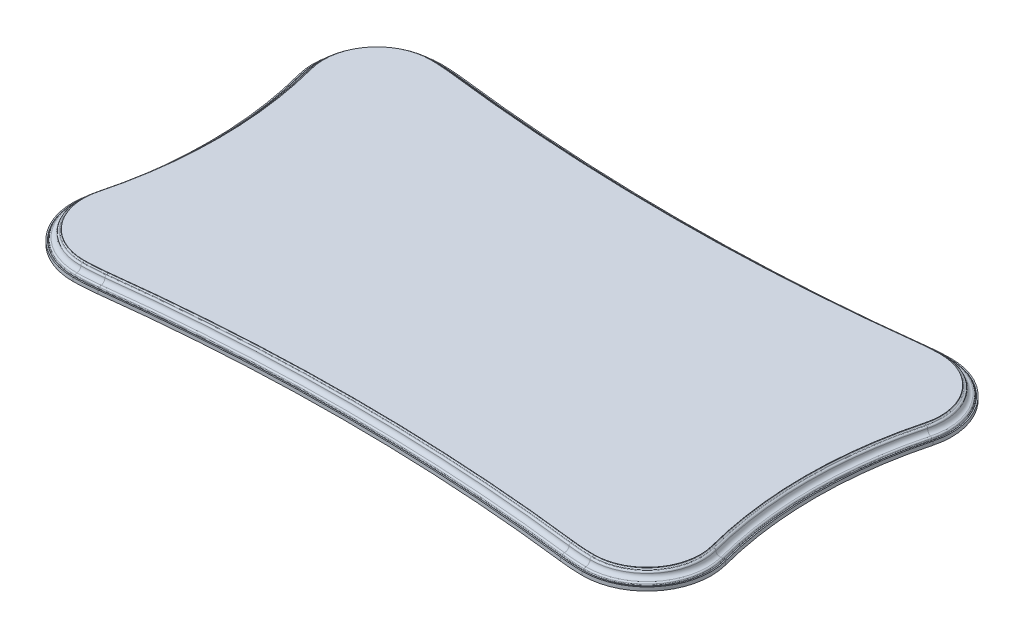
ISO-10303-21;
HEADER;
FILE_DESCRIPTION(('STEP AP214'),'2;1');
FILE_NAME('part.step','',(''),(''),'','','');
FILE_SCHEMA(('AUTOMOTIVE_DESIGN { 1 0 10303 214 1 1 1 1 }'));
ENDSEC;
DATA;
#1=APPLICATION_CONTEXT('core data for automotive mechanical design processes');
#2=APPLICATION_PROTOCOL_DEFINITION('international standard','automotive_design',2000,#1);
#3=PRODUCT_CONTEXT('',#1,'mechanical');
#4=PRODUCT('Part','Part','',(#3));
#5=PRODUCT_RELATED_PRODUCT_CATEGORY('part','',(#4));
#6=PRODUCT_DEFINITION_FORMATION('','',#4);
#7=PRODUCT_DEFINITION_CONTEXT('part definition',#1,'design');
#8=PRODUCT_DEFINITION('design','',#6,#7);
#9=PRODUCT_DEFINITION_SHAPE('','',#8);
#10=(LENGTH_UNIT() NAMED_UNIT(*) SI_UNIT(.MILLI.,.METRE.));
#11=(NAMED_UNIT(*) PLANE_ANGLE_UNIT() SI_UNIT($,.RADIAN.));
#12=(NAMED_UNIT(*) SI_UNIT($,.STERADIAN.) SOLID_ANGLE_UNIT());
#13=UNCERTAINTY_MEASURE_WITH_UNIT(LENGTH_MEASURE(1.E-05),#10,'distance_accuracy_value','');
#14=(GEOMETRIC_REPRESENTATION_CONTEXT(3) GLOBAL_UNCERTAINTY_ASSIGNED_CONTEXT((#13)) GLOBAL_UNIT_ASSIGNED_CONTEXT((#10,
#11,#12)) REPRESENTATION_CONTEXT('',''));
#15=CARTESIAN_POINT('',(0.,0.,0.));
#16=DIRECTION('',(0.,0.,1.));
#17=DIRECTION('',(1.,0.,0.));
#18=AXIS2_PLACEMENT_3D('',#15,#16,#17);
#19=CARTESIAN_POINT('',(-494.973141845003,-12.5,58.4625334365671));
#20=DIRECTION('',(0.,1.,0.));
#21=DIRECTION('',(0.,0.,1.));
#22=AXIS2_PLACEMENT_3D('',#19,#20,#21);
#23=CYLINDRICAL_SURFACE('',#22,413.483507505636);
#24=CARTESIAN_POINT('',(-494.973141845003,-5.50000000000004,58.4625334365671));
#25=DIRECTION('',(0.,-1.,0.));
#26=DIRECTION('',(0.,0.,-1.));
#27=AXIS2_PLACEMENT_3D('',#24,#25,#26);
#28=CIRCLE('',#27,413.483507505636);
#29=CARTESIAN_POINT('',(-445.,-5.50000000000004,-351.990016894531));
#30=VERTEX_POINT('',#29);
#31=CARTESIAN_POINT('',(-490.,-5.50000000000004,-354.991065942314));
#32=VERTEX_POINT('',#31);
#33=EDGE_CURVE('E56',#30,#32,#28,.F.);
#34=ORIENTED_EDGE('',*,*,#33,.F.);
#35=DIRECTION('',(0.,1.,0.));
#36=VECTOR('',#35,1.);
#37=CARTESIAN_POINT('',(-445.,-12.5,-351.990016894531));
#38=LINE('',#37,#36);
#39=CARTESIAN_POINT('',(-445.,-12.5,-351.990016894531));
#40=VERTEX_POINT('',#39);
#41=EDGE_CURVE('E543',#40,#30,#38,.T.);
#42=ORIENTED_EDGE('',*,*,#41,.F.);
#43=CARTESIAN_POINT('',(-494.973141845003,-12.5,58.4625334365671));
#44=DIRECTION('',(0.,1.,0.));
#45=DIRECTION('',(0.,0.,1.));
#46=AXIS2_PLACEMENT_3D('',#43,#44,#45);
#47=CIRCLE('',#46,413.483507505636);
#48=CARTESIAN_POINT('',(-490.,-12.5,-354.991065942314));
#49=VERTEX_POINT('',#48);
#50=EDGE_CURVE('E507',#40,#49,#47,.T.);
#51=ORIENTED_EDGE('',*,*,#50,.T.);
#52=DIRECTION('',(0.,1.,0.));
#53=VECTOR('',#52,1.);
#54=CARTESIAN_POINT('',(-490.,-12.5,-354.991065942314));
#55=LINE('',#54,#53);
#56=EDGE_CURVE('E542',#49,#32,#55,.T.);
#57=ORIENTED_EDGE('',*,*,#56,.T.);
#58=EDGE_LOOP('',(#34,#42,#51,#57));
#59=FACE_BOUND('',#58,.T.);
#60=ADVANCED_FACE('F34',(#59),#23,.T.);
#61=CARTESIAN_POINT('',(0.,-12.5,-4006.98104115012));
#62=DIRECTION('',(0.,1.,0.));
#63=DIRECTION('',(0.,0.,1.));
#64=AXIS2_PLACEMENT_3D('',#61,#62,#63);
#65=CYLINDRICAL_SURFACE('',#64,3681.98104115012);
#66=CARTESIAN_POINT('',(0.,-5.50000000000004,-4006.98104115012));
#67=DIRECTION('',(0.,-1.,0.));
#68=DIRECTION('',(0.,0.,-1.));
#69=AXIS2_PLACEMENT_3D('',#66,#67,#68);
#70=CIRCLE('',#69,3681.98104115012);
#71=CARTESIAN_POINT('',(444.999999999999,-5.50000000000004,-351.99001689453));
#72=VERTEX_POINT('',#71);
#73=EDGE_CURVE('E504',#72,#30,#70,.T.);
#74=ORIENTED_EDGE('',*,*,#73,.F.);
#75=DIRECTION('',(0.,1.,0.));
#76=VECTOR('',#75,1.);
#77=CARTESIAN_POINT('',(444.999999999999,-12.5,-351.990016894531));
#78=LINE('',#77,#76);
#79=CARTESIAN_POINT('',(444.999999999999,-12.5,-351.990016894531));
#80=VERTEX_POINT('',#79);
#81=EDGE_CURVE('E547',#80,#72,#78,.T.);
#82=ORIENTED_EDGE('',*,*,#81,.F.);
#83=CARTESIAN_POINT('',(0.,-12.5,-4006.98104115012));
#84=DIRECTION('',(0.,-1.,0.));
#85=DIRECTION('',(0.,0.,1.));
#86=AXIS2_PLACEMENT_3D('',#83,#84,#85);
#87=CIRCLE('',#86,3681.98104115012);
#88=EDGE_CURVE('E539',#80,#40,#87,.T.);
#89=ORIENTED_EDGE('',*,*,#88,.T.);
#90=ORIENTED_EDGE('',*,*,#41,.T.);
#91=EDGE_LOOP('',(#74,#82,#89,#90));
#92=FACE_BOUND('',#91,.T.);
#93=ADVANCED_FACE('F1218',(#92),#65,.F.);
#94=CARTESIAN_POINT('',(494.973141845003,-12.5,58.4625334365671));
#95=DIRECTION('',(0.,1.,0.));
#96=DIRECTION('',(0.,0.,1.));
#97=AXIS2_PLACEMENT_3D('',#94,#95,#96);
#98=CYLINDRICAL_SURFACE('',#97,413.483507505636);
#99=CARTESIAN_POINT('',(494.973141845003,-5.50000000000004,58.4625334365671));
#100=DIRECTION('',(0.,-1.,0.));
#101=DIRECTION('',(0.,0.,-1.));
#102=AXIS2_PLACEMENT_3D('',#99,#100,#101);
#103=CIRCLE('',#102,413.483507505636);
#104=CARTESIAN_POINT('',(490.,-5.50000000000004,-354.991065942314));
#105=VERTEX_POINT('',#104);
#106=EDGE_CURVE('E502',#105,#72,#103,.F.);
#107=ORIENTED_EDGE('',*,*,#106,.F.);
#108=DIRECTION('',(0.,1.,0.));
#109=VECTOR('',#108,1.);
#110=CARTESIAN_POINT('',(490.,-12.5,-354.991065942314));
#111=LINE('',#110,#109);
#112=CARTESIAN_POINT('',(490.,-12.5,-354.991065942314));
#113=VERTEX_POINT('',#112);
#114=EDGE_CURVE('E550',#113,#105,#111,.T.);
#115=ORIENTED_EDGE('',*,*,#114,.F.);
#116=CARTESIAN_POINT('',(494.973141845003,-12.5,58.4625334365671));
#117=DIRECTION('',(0.,1.,0.));
#118=DIRECTION('',(0.,0.,-1.));
#119=AXIS2_PLACEMENT_3D('',#116,#117,#118);
#120=CIRCLE('',#119,413.483507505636);
#121=EDGE_CURVE('E536',#113,#80,#120,.T.);
#122=ORIENTED_EDGE('',*,*,#121,.T.);
#123=ORIENTED_EDGE('',*,*,#81,.T.);
#124=EDGE_LOOP('',(#107,#115,#122,#123));
#125=FACE_BOUND('',#124,.T.);
#126=ADVANCED_FACE('F1224',(#125),#98,.T.);
#127=CARTESIAN_POINT('',(491.4855606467,-12.5,-231.4855606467));
#128=DIRECTION('',(0.,1.,0.));
#129=DIRECTION('',(0.,0.,1.));
#130=AXIS2_PLACEMENT_3D('',#127,#128,#129);
#131=CYLINDRICAL_SURFACE('',#130,123.5144393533);
#132=CARTESIAN_POINT('',(491.4855606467,-5.50000000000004,-231.4855606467));
#133=DIRECTION('',(0.,-1.,0.));
#134=DIRECTION('',(0.,0.,-1.));
#135=AXIS2_PLACEMENT_3D('',#132,#133,#134);
#136=CIRCLE('',#135,123.5144393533);
#137=CARTESIAN_POINT('',(610.919543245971,-5.50000000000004,-200.));
#138=VERTEX_POINT('',#137);
#139=EDGE_CURVE('E500',#138,#105,#136,.F.);
#140=ORIENTED_EDGE('',*,*,#139,.F.);
#141=DIRECTION('',(0.,1.,0.));
#142=VECTOR('',#141,1.);
#143=CARTESIAN_POINT('',(610.919543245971,-12.5,-200.));
#144=LINE('',#143,#142);
#145=CARTESIAN_POINT('',(610.919543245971,-12.5,-200.));
#146=VERTEX_POINT('',#145);
#147=EDGE_CURVE('E553',#146,#138,#144,.T.);
#148=ORIENTED_EDGE('',*,*,#147,.F.);
#149=CARTESIAN_POINT('',(491.4855606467,-12.5,-231.4855606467));
#150=DIRECTION('',(0.,1.,0.));
#151=DIRECTION('',(0.,0.,1.));
#152=AXIS2_PLACEMENT_3D('',#149,#150,#151);
#153=CIRCLE('',#152,123.5144393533);
#154=EDGE_CURVE('E533',#146,#113,#153,.T.);
#155=ORIENTED_EDGE('',*,*,#154,.T.);
#156=ORIENTED_EDGE('',*,*,#114,.T.);
#157=EDGE_LOOP('',(#140,#148,#155,#156));
#158=FACE_BOUND('',#157,.T.);
#159=ADVANCED_FACE('F2155',(#158),#131,.T.);
#160=CARTESIAN_POINT('',(1369.57830711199,-12.5,0.));
#161=DIRECTION('',(0.,1.,0.));
#162=DIRECTION('',(0.,0.,1.));
#163=AXIS2_PLACEMENT_3D('',#160,#161,#162);
#164=CYLINDRICAL_SURFACE('',#163,784.578307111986);
#165=CARTESIAN_POINT('',(1369.57830711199,-5.50000000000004,0.));
#166=DIRECTION('',(0.,-1.,0.));
#167=DIRECTION('',(0.,0.,-1.));
#168=AXIS2_PLACEMENT_3D('',#165,#166,#167);
#169=CIRCLE('',#168,784.578307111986);
#170=CARTESIAN_POINT('',(610.919543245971,-5.50000000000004,200.));
#171=VERTEX_POINT('',#170);
#172=EDGE_CURVE('E498',#171,#138,#169,.T.);
#173=ORIENTED_EDGE('',*,*,#172,.F.);
#174=DIRECTION('',(0.,1.,0.));
#175=VECTOR('',#174,1.);
#176=CARTESIAN_POINT('',(610.919543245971,-12.5,200.));
#177=LINE('',#176,#175);
#178=CARTESIAN_POINT('',(610.919543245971,-12.5,200.));
#179=VERTEX_POINT('',#178);
#180=EDGE_CURVE('E556',#179,#171,#177,.T.);
#181=ORIENTED_EDGE('',*,*,#180,.F.);
#182=CARTESIAN_POINT('',(1369.57830711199,-12.5,0.));
#183=DIRECTION('',(0.,-1.,0.));
#184=DIRECTION('',(0.,0.,1.));
#185=AXIS2_PLACEMENT_3D('',#182,#183,#184);
#186=CIRCLE('',#185,784.578307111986);
#187=EDGE_CURVE('E530',#179,#146,#186,.T.);
#188=ORIENTED_EDGE('',*,*,#187,.T.);
#189=ORIENTED_EDGE('',*,*,#147,.T.);
#190=EDGE_LOOP('',(#173,#181,#188,#189));
#191=FACE_BOUND('',#190,.T.);
#192=ADVANCED_FACE('F2147',(#191),#164,.F.);
#193=CARTESIAN_POINT('',(491.4855606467,-12.5,231.4855606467));
#194=DIRECTION('',(0.,1.,0.));
#195=DIRECTION('',(0.,0.,1.));
#196=AXIS2_PLACEMENT_3D('',#193,#194,#195);
#197=CYLINDRICAL_SURFACE('',#196,123.5144393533);
#198=CARTESIAN_POINT('',(491.4855606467,-5.50000000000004,231.4855606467));
#199=DIRECTION('',(0.,-1.,0.));
#200=DIRECTION('',(0.,0.,-1.));
#201=AXIS2_PLACEMENT_3D('',#198,#199,#200);
#202=CIRCLE('',#201,123.5144393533);
#203=CARTESIAN_POINT('',(490.,-5.50000000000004,354.991065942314));
#204=VERTEX_POINT('',#203);
#205=EDGE_CURVE('E496',#204,#171,#202,.F.);
#206=ORIENTED_EDGE('',*,*,#205,.F.);
#207=DIRECTION('',(0.,1.,0.));
#208=VECTOR('',#207,1.);
#209=CARTESIAN_POINT('',(490.,-12.5,354.991065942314));
#210=LINE('',#209,#208);
#211=CARTESIAN_POINT('',(490.,-12.5,354.991065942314));
#212=VERTEX_POINT('',#211);
#213=EDGE_CURVE('E559',#212,#204,#210,.T.);
#214=ORIENTED_EDGE('',*,*,#213,.F.);
#215=CARTESIAN_POINT('',(491.4855606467,-12.5,231.4855606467));
#216=DIRECTION('',(0.,1.,0.));
#217=DIRECTION('',(0.,0.,-1.));
#218=AXIS2_PLACEMENT_3D('',#215,#216,#217);
#219=CIRCLE('',#218,123.5144393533);
#220=EDGE_CURVE('E527',#212,#179,#219,.T.);
#221=ORIENTED_EDGE('',*,*,#220,.T.);
#222=ORIENTED_EDGE('',*,*,#180,.T.);
#223=EDGE_LOOP('',(#206,#214,#221,#222));
#224=FACE_BOUND('',#223,.T.);
#225=ADVANCED_FACE('F2139',(#224),#197,.T.);
#226=CARTESIAN_POINT('',(494.973141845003,-12.5,-58.4625334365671));
#227=DIRECTION('',(0.,1.,0.));
#228=DIRECTION('',(0.,0.,1.));
#229=AXIS2_PLACEMENT_3D('',#226,#227,#228);
#230=CYLINDRICAL_SURFACE('',#229,413.483507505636);
#231=CARTESIAN_POINT('',(494.973141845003,-5.50000000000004,-58.4625334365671));
#232=DIRECTION('',(0.,-1.,0.));
#233=DIRECTION('',(0.,0.,-1.));
#234=AXIS2_PLACEMENT_3D('',#231,#232,#233);
#235=CIRCLE('',#234,413.483507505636);
#236=CARTESIAN_POINT('',(445.,-5.50000000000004,351.99001689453));
#237=VERTEX_POINT('',#236);
#238=EDGE_CURVE('E494',#237,#204,#235,.F.);
#239=ORIENTED_EDGE('',*,*,#238,.F.);
#240=DIRECTION('',(0.,1.,0.));
#241=VECTOR('',#240,1.);
#242=CARTESIAN_POINT('',(445.,-12.5,351.990016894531));
#243=LINE('',#242,#241);
#244=CARTESIAN_POINT('',(445.,-12.5,351.990016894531));
#245=VERTEX_POINT('',#244);
#246=EDGE_CURVE('E562',#245,#237,#243,.T.);
#247=ORIENTED_EDGE('',*,*,#246,.F.);
#248=CARTESIAN_POINT('',(494.973141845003,-12.5,-58.4625334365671));
#249=DIRECTION('',(0.,1.,0.));
#250=DIRECTION('',(0.,0.,1.));
#251=AXIS2_PLACEMENT_3D('',#248,#249,#250);
#252=CIRCLE('',#251,413.483507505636);
#253=EDGE_CURVE('E524',#245,#212,#252,.T.);
#254=ORIENTED_EDGE('',*,*,#253,.T.);
#255=ORIENTED_EDGE('',*,*,#213,.T.);
#256=EDGE_LOOP('',(#239,#247,#254,#255));
#257=FACE_BOUND('',#256,.T.);
#258=ADVANCED_FACE('F2131',(#257),#230,.T.);
#259=CARTESIAN_POINT('',(0.,-12.5,4006.98104115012));
#260=DIRECTION('',(0.,1.,0.));
#261=DIRECTION('',(0.,0.,1.));
#262=AXIS2_PLACEMENT_3D('',#259,#260,#261);
#263=CYLINDRICAL_SURFACE('',#262,3681.98104115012);
#264=CARTESIAN_POINT('',(0.,-5.50000000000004,4006.98104115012));
#265=DIRECTION('',(0.,-1.,0.));
#266=DIRECTION('',(0.,0.,-1.));
#267=AXIS2_PLACEMENT_3D('',#264,#265,#266);
#268=CIRCLE('',#267,3681.98104115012);
#269=CARTESIAN_POINT('',(-445.,-5.50000000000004,351.990016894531));
#270=VERTEX_POINT('',#269);
#271=EDGE_CURVE('E492',#270,#237,#268,.T.);
#272=ORIENTED_EDGE('',*,*,#271,.F.);
#273=DIRECTION('',(0.,1.,0.));
#274=VECTOR('',#273,1.);
#275=CARTESIAN_POINT('',(-445.,-12.5,351.990016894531));
#276=LINE('',#275,#274);
#277=CARTESIAN_POINT('',(-445.,-12.5,351.990016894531));
#278=VERTEX_POINT('',#277);
#279=EDGE_CURVE('E565',#278,#270,#276,.T.);
#280=ORIENTED_EDGE('',*,*,#279,.F.);
#281=CARTESIAN_POINT('',(0.,-12.5,4006.98104115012));
#282=DIRECTION('',(0.,-1.,0.));
#283=DIRECTION('',(0.,0.,-1.));
#284=AXIS2_PLACEMENT_3D('',#281,#282,#283);
#285=CIRCLE('',#284,3681.98104115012);
#286=EDGE_CURVE('E521',#278,#245,#285,.T.);
#287=ORIENTED_EDGE('',*,*,#286,.T.);
#288=ORIENTED_EDGE('',*,*,#246,.T.);
#289=EDGE_LOOP('',(#272,#280,#287,#288));
#290=FACE_BOUND('',#289,.T.);
#291=ADVANCED_FACE('F2123',(#290),#263,.F.);
#292=CARTESIAN_POINT('',(-494.973141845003,-12.5,-58.4625334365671));
#293=DIRECTION('',(0.,1.,0.));
#294=DIRECTION('',(0.,0.,1.));
#295=AXIS2_PLACEMENT_3D('',#292,#293,#294);
#296=CYLINDRICAL_SURFACE('',#295,413.483507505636);
#297=CARTESIAN_POINT('',(-494.973141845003,-5.50000000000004,-58.4625334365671));
#298=DIRECTION('',(0.,-1.,0.));
#299=DIRECTION('',(0.,0.,-1.));
#300=AXIS2_PLACEMENT_3D('',#297,#298,#299);
#301=CIRCLE('',#300,413.483507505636);
#302=CARTESIAN_POINT('',(-490.,-5.50000000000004,354.991065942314));
#303=VERTEX_POINT('',#302);
#304=EDGE_CURVE('E490',#303,#270,#301,.F.);
#305=ORIENTED_EDGE('',*,*,#304,.F.);
#306=DIRECTION('',(0.,1.,0.));
#307=VECTOR('',#306,1.);
#308=CARTESIAN_POINT('',(-490.,-12.5,354.991065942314));
#309=LINE('',#308,#307);
#310=CARTESIAN_POINT('',(-490.,-12.5,354.991065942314));
#311=VERTEX_POINT('',#310);
#312=EDGE_CURVE('E568',#311,#303,#309,.T.);
#313=ORIENTED_EDGE('',*,*,#312,.F.);
#314=CARTESIAN_POINT('',(-494.973141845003,-12.5,-58.4625334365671));
#315=DIRECTION('',(0.,1.,0.));
#316=DIRECTION('',(0.,0.,-1.));
#317=AXIS2_PLACEMENT_3D('',#314,#315,#316);
#318=CIRCLE('',#317,413.483507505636);
#319=EDGE_CURVE('E518',#311,#278,#318,.T.);
#320=ORIENTED_EDGE('',*,*,#319,.T.);
#321=ORIENTED_EDGE('',*,*,#279,.T.);
#322=EDGE_LOOP('',(#305,#313,#320,#321));
#323=FACE_BOUND('',#322,.T.);
#324=ADVANCED_FACE('F2115',(#323),#296,.T.);
#325=CARTESIAN_POINT('',(-491.4855606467,-12.5,231.4855606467));
#326=DIRECTION('',(0.,1.,0.));
#327=DIRECTION('',(0.,0.,1.));
#328=AXIS2_PLACEMENT_3D('',#325,#326,#327);
#329=CYLINDRICAL_SURFACE('',#328,123.5144393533);
#330=CARTESIAN_POINT('',(-491.4855606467,-5.50000000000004,231.4855606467));
#331=DIRECTION('',(0.,-1.,0.));
#332=DIRECTION('',(0.,0.,-1.));
#333=AXIS2_PLACEMENT_3D('',#330,#331,#332);
#334=CIRCLE('',#333,123.5144393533);
#335=CARTESIAN_POINT('',(-610.919543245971,-5.50000000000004,200.));
#336=VERTEX_POINT('',#335);
#337=EDGE_CURVE('E487',#336,#303,#334,.F.);
#338=ORIENTED_EDGE('',*,*,#337,.F.);
#339=DIRECTION('',(0.,1.,0.));
#340=VECTOR('',#339,1.);
#341=CARTESIAN_POINT('',(-610.919543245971,-12.5,200.));
#342=LINE('',#341,#340);
#343=CARTESIAN_POINT('',(-610.919543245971,-12.5,200.));
#344=VERTEX_POINT('',#343);
#345=EDGE_CURVE('E571',#344,#336,#342,.T.);
#346=ORIENTED_EDGE('',*,*,#345,.F.);
#347=CARTESIAN_POINT('',(-491.4855606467,-12.5,231.4855606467));
#348=DIRECTION('',(0.,1.,0.));
#349=DIRECTION('',(0.,0.,1.));
#350=AXIS2_PLACEMENT_3D('',#347,#348,#349);
#351=CIRCLE('',#350,123.5144393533);
#352=EDGE_CURVE('E515',#344,#311,#351,.T.);
#353=ORIENTED_EDGE('',*,*,#352,.T.);
#354=ORIENTED_EDGE('',*,*,#312,.T.);
#355=EDGE_LOOP('',(#338,#346,#353,#354));
#356=FACE_BOUND('',#355,.T.);
#357=ADVANCED_FACE('F2109',(#356),#329,.T.);
#358=CARTESIAN_POINT('',(-1369.57830711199,-12.5,0.));
#359=DIRECTION('',(0.,1.,0.));
#360=DIRECTION('',(0.,0.,1.));
#361=AXIS2_PLACEMENT_3D('',#358,#359,#360);
#362=CYLINDRICAL_SURFACE('',#361,784.578307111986);
#363=CARTESIAN_POINT('',(-1369.57830711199,-5.50000000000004,0.));
#364=DIRECTION('',(0.,-1.,0.));
#365=DIRECTION('',(0.,0.,-1.));
#366=AXIS2_PLACEMENT_3D('',#363,#364,#365);
#367=CIRCLE('',#366,784.578307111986);
#368=CARTESIAN_POINT('',(-610.919543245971,-5.50000000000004,-200.));
#369=VERTEX_POINT('',#368);
#370=EDGE_CURVE('E485',#369,#336,#367,.T.);
#371=ORIENTED_EDGE('',*,*,#370,.F.);
#372=DIRECTION('',(0.,1.,0.));
#373=VECTOR('',#372,1.);
#374=CARTESIAN_POINT('',(-610.919543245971,-12.5,-200.));
#375=LINE('',#374,#373);
#376=CARTESIAN_POINT('',(-610.919543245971,-12.5,-200.));
#377=VERTEX_POINT('',#376);
#378=EDGE_CURVE('E574',#377,#369,#375,.T.);
#379=ORIENTED_EDGE('',*,*,#378,.F.);
#380=CARTESIAN_POINT('',(-1369.57830711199,-12.5,0.));
#381=DIRECTION('',(0.,-1.,0.));
#382=DIRECTION('',(0.,0.,-1.));
#383=AXIS2_PLACEMENT_3D('',#380,#381,#382);
#384=CIRCLE('',#383,784.578307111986);
#385=EDGE_CURVE('E512',#377,#344,#384,.T.);
#386=ORIENTED_EDGE('',*,*,#385,.T.);
#387=ORIENTED_EDGE('',*,*,#345,.T.);
#388=EDGE_LOOP('',(#371,#379,#386,#387));
#389=FACE_BOUND('',#388,.T.);
#390=ADVANCED_FACE('F2103',(#389),#362,.F.);
#391=CARTESIAN_POINT('',(-491.4855606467,-12.5,-231.4855606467));
#392=DIRECTION('',(0.,1.,0.));
#393=DIRECTION('',(0.,0.,1.));
#394=AXIS2_PLACEMENT_3D('',#391,#392,#393);
#395=CYLINDRICAL_SURFACE('',#394,123.5144393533);
#396=CARTESIAN_POINT('',(-491.4855606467,-5.50000000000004,-231.4855606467));
#397=DIRECTION('',(0.,-1.,0.));
#398=DIRECTION('',(0.,0.,-1.));
#399=AXIS2_PLACEMENT_3D('',#396,#397,#398);
#400=CIRCLE('',#399,123.5144393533);
#401=EDGE_CURVE('E546',#32,#369,#400,.F.);
#402=ORIENTED_EDGE('',*,*,#401,.F.);
#403=ORIENTED_EDGE('',*,*,#56,.F.);
#404=CARTESIAN_POINT('',(-491.4855606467,-12.5,-231.4855606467));
#405=DIRECTION('',(0.,1.,0.));
#406=DIRECTION('',(0.,0.,-1.));
#407=AXIS2_PLACEMENT_3D('',#404,#405,#406);
#408=CIRCLE('',#407,123.5144393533);
#409=EDGE_CURVE('E509',#49,#377,#408,.T.);
#410=ORIENTED_EDGE('',*,*,#409,.T.);
#411=ORIENTED_EDGE('',*,*,#378,.T.);
#412=EDGE_LOOP('',(#402,#403,#410,#411));
#413=FACE_BOUND('',#412,.T.);
#414=ADVANCED_FACE('F1228',(#413),#395,.T.);
#415=CARTESIAN_POINT('',(-625.,-12.5,365.));
#416=DIRECTION('',(0.,1.,0.));
#417=DIRECTION('',(0.,0.,1.));
#418=AXIS2_PLACEMENT_3D('',#415,#416,#417);
#419=PLANE('',#418);
#420=ORIENTED_EDGE('',*,*,#50,.F.);
#421=ORIENTED_EDGE('',*,*,#88,.F.);
#422=ORIENTED_EDGE('',*,*,#121,.F.);
#423=ORIENTED_EDGE('',*,*,#154,.F.);
#424=ORIENTED_EDGE('',*,*,#187,.F.);
#425=ORIENTED_EDGE('',*,*,#220,.F.);
#426=ORIENTED_EDGE('',*,*,#253,.F.);
#427=ORIENTED_EDGE('',*,*,#286,.F.);
#428=ORIENTED_EDGE('',*,*,#319,.F.);
#429=ORIENTED_EDGE('',*,*,#352,.F.);
#430=ORIENTED_EDGE('',*,*,#385,.F.);
#431=ORIENTED_EDGE('',*,*,#409,.F.);
#432=EDGE_LOOP('',(#420,#421,#422,#423,#424,#425,#426,#427,#428,#429,#430,#431));
#433=FACE_BOUND('',#432,.T.);
#434=ADVANCED_FACE('F36',(#433),#419,.F.);
#435=CARTESIAN_POINT('',(-491.4855606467,12.5,231.4855606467));
#436=DIRECTION('',(0.,-1.,0.));
#437=DIRECTION('',(0.,0.,-1.));
#438=AXIS2_PLACEMENT_3D('',#435,#436,#437);
#439=CYLINDRICAL_SURFACE('',#438,102.5144393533);
#440=CARTESIAN_POINT('',(-491.4855606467,12.5,231.4855606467));
#441=DIRECTION('',(0.,-1.,0.));
#442=DIRECTION('',(0.,0.,-1.));
#443=AXIS2_PLACEMENT_3D('',#440,#441,#442);
#444=CIRCLE('',#443,102.5144393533);
#445=CARTESIAN_POINT('',(-490.252575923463,12.5,333.992584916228));
#446=VERTEX_POINT('',#445);
#447=CARTESIAN_POINT('',(-590.61330498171,12.5,205.353194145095));
#448=VERTEX_POINT('',#447);
#449=EDGE_CURVE('E11',#446,#448,#444,.T.);
#450=ORIENTED_EDGE('',*,*,#449,.T.);
#451=DIRECTION('',(0.,1.,0.));
#452=VECTOR('',#451,1.);
#453=CARTESIAN_POINT('',(-590.61330498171,14.5,205.353194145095));
#454=LINE('',#453,#452);
#455=CARTESIAN_POINT('',(-590.61330498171,11.5,205.353194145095));
#456=VERTEX_POINT('',#455);
#457=EDGE_CURVE('E49',#456,#448,#454,.T.);
#458=ORIENTED_EDGE('',*,*,#457,.F.);
#459=CARTESIAN_POINT('',(-491.4855606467,11.5,231.4855606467));
#460=DIRECTION('',(0.,-1.,0.));
#461=DIRECTION('',(0.,0.,-1.));
#462=AXIS2_PLACEMENT_3D('',#459,#460,#461);
#463=CIRCLE('',#462,102.5144393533);
#464=CARTESIAN_POINT('',(-490.252575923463,11.5,333.992584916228));
#465=VERTEX_POINT('',#464);
#466=EDGE_CURVE('E488',#465,#456,#463,.T.);
#467=ORIENTED_EDGE('',*,*,#466,.F.);
#468=DIRECTION('',(0.,1.,0.));
#469=VECTOR('',#468,1.);
#470=CARTESIAN_POINT('',(-490.252575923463,14.5,333.992584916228));
#471=LINE('',#470,#469);
#472=EDGE_CURVE('E606',#465,#446,#471,.T.);
#473=ORIENTED_EDGE('',*,*,#472,.T.);
#474=EDGE_LOOP('',(#450,#458,#467,#473));
#475=FACE_BOUND('',#474,.T.);
#476=ADVANCED_FACE('F614',(#475),#439,.T.);
#477=CARTESIAN_POINT('',(-494.973141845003,12.5,-58.4625334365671));
#478=DIRECTION('',(0.,-1.,0.));
#479=DIRECTION('',(0.,0.,-1.));
#480=AXIS2_PLACEMENT_3D('',#477,#478,#479);
#481=CYLINDRICAL_SURFACE('',#480,392.483507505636);
#482=CARTESIAN_POINT('',(-494.973141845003,12.5,-58.4625334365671));
#483=DIRECTION('',(0.,-1.,0.));
#484=DIRECTION('',(0.,0.,-1.));
#485=AXIS2_PLACEMENT_3D('',#482,#483,#484);
#486=CIRCLE('',#485,392.483507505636);
#487=CARTESIAN_POINT('',(-447.538035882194,12.5,331.143953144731));
#488=VERTEX_POINT('',#487);
#489=EDGE_CURVE('E42',#488,#446,#486,.T.);
#490=ORIENTED_EDGE('',*,*,#489,.T.);
#491=ORIENTED_EDGE('',*,*,#472,.F.);
#492=CARTESIAN_POINT('',(-494.973141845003,11.5,-58.4625334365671));
#493=DIRECTION('',(0.,-1.,0.));
#494=DIRECTION('',(0.,0.,-1.));
#495=AXIS2_PLACEMENT_3D('',#492,#493,#494);
#496=CIRCLE('',#495,392.483507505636);
#497=CARTESIAN_POINT('',(-447.538035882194,11.5,331.143953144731));
#498=VERTEX_POINT('',#497);
#499=EDGE_CURVE('E1034',#498,#465,#496,.T.);
#500=ORIENTED_EDGE('',*,*,#499,.F.);
#501=DIRECTION('',(0.,1.,0.));
#502=VECTOR('',#501,1.);
#503=CARTESIAN_POINT('',(-447.538035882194,14.5,331.143953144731));
#504=LINE('',#503,#502);
#505=EDGE_CURVE('E609',#498,#488,#504,.T.);
#506=ORIENTED_EDGE('',*,*,#505,.T.);
#507=EDGE_LOOP('',(#490,#491,#500,#506));
#508=FACE_BOUND('',#507,.T.);
#509=ADVANCED_FACE('F605',(#508),#481,.T.);
#510=CARTESIAN_POINT('',(0.,12.5,4006.98104115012));
#511=DIRECTION('',(0.,1.,0.));
#512=DIRECTION('',(0.,0.,1.));
#513=AXIS2_PLACEMENT_3D('',#510,#511,#512);
#514=CYLINDRICAL_SURFACE('',#513,3702.98104115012);
#515=CARTESIAN_POINT('',(0.,12.5,4006.98104115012));
#516=DIRECTION('',(0.,-1.,0.));
#517=DIRECTION('',(0.,0.,-1.));
#518=AXIS2_PLACEMENT_3D('',#515,#516,#517);
#519=CIRCLE('',#518,3702.98104115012);
#520=CARTESIAN_POINT('',(447.538035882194,12.5,331.143953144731));
#521=VERTEX_POINT('',#520);
#522=EDGE_CURVE('E599',#521,#488,#519,.F.);
#523=ORIENTED_EDGE('',*,*,#522,.T.);
#524=ORIENTED_EDGE('',*,*,#505,.F.);
#525=CARTESIAN_POINT('',(0.,11.5,4006.98104115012));
#526=DIRECTION('',(0.,1.,0.));
#527=DIRECTION('',(0.,0.,1.));
#528=AXIS2_PLACEMENT_3D('',#525,#526,#527);
#529=CIRCLE('',#528,3702.98104115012);
#530=CARTESIAN_POINT('',(447.538035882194,11.5,331.143953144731));
#531=VERTEX_POINT('',#530);
#532=EDGE_CURVE('E996',#531,#498,#529,.T.);
#533=ORIENTED_EDGE('',*,*,#532,.F.);
#534=DIRECTION('',(0.,1.,0.));
#535=VECTOR('',#534,1.);
#536=CARTESIAN_POINT('',(447.538035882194,14.5,331.143953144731));
#537=LINE('',#536,#535);
#538=EDGE_CURVE('E929',#531,#521,#537,.T.);
#539=ORIENTED_EDGE('',*,*,#538,.T.);
#540=EDGE_LOOP('',(#523,#524,#533,#539));
#541=FACE_BOUND('',#540,.T.);
#542=ADVANCED_FACE('F1467',(#541),#514,.F.);
#543=CARTESIAN_POINT('',(494.973141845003,12.5,-58.4625334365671));
#544=DIRECTION('',(0.,-1.,0.));
#545=DIRECTION('',(0.,0.,-1.));
#546=AXIS2_PLACEMENT_3D('',#543,#544,#545);
#547=CYLINDRICAL_SURFACE('',#546,392.483507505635);
#548=CARTESIAN_POINT('',(494.973141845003,12.5,-58.4625334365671));
#549=DIRECTION('',(0.,-1.,0.));
#550=DIRECTION('',(0.,0.,-1.));
#551=AXIS2_PLACEMENT_3D('',#548,#549,#550);
#552=CIRCLE('',#551,392.483507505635);
#553=CARTESIAN_POINT('',(490.252575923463,12.5,333.992584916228));
#554=VERTEX_POINT('',#553);
#555=EDGE_CURVE('E597',#554,#521,#552,.T.);
#556=ORIENTED_EDGE('',*,*,#555,.T.);
#557=ORIENTED_EDGE('',*,*,#538,.F.);
#558=CARTESIAN_POINT('',(494.973141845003,11.5,-58.4625334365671));
#559=DIRECTION('',(0.,-1.,0.));
#560=DIRECTION('',(0.,0.,-1.));
#561=AXIS2_PLACEMENT_3D('',#558,#559,#560);
#562=CIRCLE('',#561,392.483507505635);
#563=CARTESIAN_POINT('',(490.252575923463,11.5,333.992584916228));
#564=VERTEX_POINT('',#563);
#565=EDGE_CURVE('E953',#564,#531,#562,.T.);
#566=ORIENTED_EDGE('',*,*,#565,.F.);
#567=DIRECTION('',(0.,1.,0.));
#568=VECTOR('',#567,1.);
#569=CARTESIAN_POINT('',(490.252575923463,14.5,333.992584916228));
#570=LINE('',#569,#568);
#571=EDGE_CURVE('E884',#564,#554,#570,.T.);
#572=ORIENTED_EDGE('',*,*,#571,.T.);
#573=EDGE_LOOP('',(#556,#557,#566,#572));
#574=FACE_BOUND('',#573,.T.);
#575=ADVANCED_FACE('F1443',(#574),#547,.T.);
#576=CARTESIAN_POINT('',(491.4855606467,12.5,231.4855606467));
#577=DIRECTION('',(0.,-1.,0.));
#578=DIRECTION('',(0.,0.,-1.));
#579=AXIS2_PLACEMENT_3D('',#576,#577,#578);
#580=CYLINDRICAL_SURFACE('',#579,102.514439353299);
#581=CARTESIAN_POINT('',(491.4855606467,12.5,231.4855606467));
#582=DIRECTION('',(0.,-1.,0.));
#583=DIRECTION('',(0.,0.,-1.));
#584=AXIS2_PLACEMENT_3D('',#581,#582,#583);
#585=CIRCLE('',#584,102.514439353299);
#586=CARTESIAN_POINT('',(590.61330498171,12.5,205.353194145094));
#587=VERTEX_POINT('',#586);
#588=EDGE_CURVE('E595',#587,#554,#585,.T.);
#589=ORIENTED_EDGE('',*,*,#588,.T.);
#590=ORIENTED_EDGE('',*,*,#571,.F.);
#591=CARTESIAN_POINT('',(491.4855606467,11.5,231.4855606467));
#592=DIRECTION('',(0.,-1.,0.));
#593=DIRECTION('',(0.,0.,-1.));
#594=AXIS2_PLACEMENT_3D('',#591,#592,#593);
#595=CIRCLE('',#594,102.514439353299);
#596=CARTESIAN_POINT('',(590.61330498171,11.5,205.353194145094));
#597=VERTEX_POINT('',#596);
#598=EDGE_CURVE('E908',#597,#564,#595,.T.);
#599=ORIENTED_EDGE('',*,*,#598,.F.);
#600=DIRECTION('',(0.,1.,0.));
#601=VECTOR('',#600,1.);
#602=CARTESIAN_POINT('',(590.61330498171,14.5,205.353194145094));
#603=LINE('',#602,#601);
#604=EDGE_CURVE('E839',#597,#587,#603,.T.);
#605=ORIENTED_EDGE('',*,*,#604,.T.);
#606=EDGE_LOOP('',(#589,#590,#599,#605));
#607=FACE_BOUND('',#606,.T.);
#608=ADVANCED_FACE('F1417',(#607),#580,.T.);
#609=CARTESIAN_POINT('',(1369.57830711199,12.5,0.));
#610=DIRECTION('',(0.,1.,0.));
#611=DIRECTION('',(0.,0.,1.));
#612=AXIS2_PLACEMENT_3D('',#609,#610,#611);
#613=CYLINDRICAL_SURFACE('',#612,805.578307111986);
#614=CARTESIAN_POINT('',(1369.57830711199,12.5,0.));
#615=DIRECTION('',(0.,-1.,0.));
#616=DIRECTION('',(0.,0.,-1.));
#617=AXIS2_PLACEMENT_3D('',#614,#615,#616);
#618=CIRCLE('',#617,805.578307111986);
#619=CARTESIAN_POINT('',(590.61330498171,12.5,-205.353194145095));
#620=VERTEX_POINT('',#619);
#621=EDGE_CURVE('E593',#620,#587,#618,.F.);
#622=ORIENTED_EDGE('',*,*,#621,.T.);
#623=ORIENTED_EDGE('',*,*,#604,.F.);
#624=CARTESIAN_POINT('',(1369.57830711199,11.5,0.));
#625=DIRECTION('',(0.,1.,0.));
#626=DIRECTION('',(0.,0.,1.));
#627=AXIS2_PLACEMENT_3D('',#624,#625,#626);
#628=CIRCLE('',#627,805.578307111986);
#629=CARTESIAN_POINT('',(590.61330498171,11.5,-205.353194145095));
#630=VERTEX_POINT('',#629);
#631=EDGE_CURVE('E863',#630,#597,#628,.T.);
#632=ORIENTED_EDGE('',*,*,#631,.F.);
#633=DIRECTION('',(0.,1.,0.));
#634=VECTOR('',#633,1.);
#635=CARTESIAN_POINT('',(590.61330498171,14.5,-205.353194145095));
#636=LINE('',#635,#634);
#637=EDGE_CURVE('E794',#630,#620,#636,.T.);
#638=ORIENTED_EDGE('',*,*,#637,.T.);
#639=EDGE_LOOP('',(#622,#623,#632,#638));
#640=FACE_BOUND('',#639,.T.);
#641=ADVANCED_FACE('F1389',(#640),#613,.F.);
#642=CARTESIAN_POINT('',(491.4855606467,12.5,-231.4855606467));
#643=DIRECTION('',(0.,-1.,0.));
#644=DIRECTION('',(0.,0.,-1.));
#645=AXIS2_PLACEMENT_3D('',#642,#643,#644);
#646=CYLINDRICAL_SURFACE('',#645,102.514439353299);
#647=CARTESIAN_POINT('',(491.4855606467,12.5,-231.4855606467));
#648=DIRECTION('',(0.,-1.,0.));
#649=DIRECTION('',(0.,0.,-1.));
#650=AXIS2_PLACEMENT_3D('',#647,#648,#649);
#651=CIRCLE('',#650,102.514439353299);
#652=CARTESIAN_POINT('',(490.252575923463,12.5,-333.992584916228));
#653=VERTEX_POINT('',#652);
#654=EDGE_CURVE('E591',#653,#620,#651,.T.);
#655=ORIENTED_EDGE('',*,*,#654,.T.);
#656=ORIENTED_EDGE('',*,*,#637,.F.);
#657=CARTESIAN_POINT('',(491.4855606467,11.5,-231.4855606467));
#658=DIRECTION('',(0.,-1.,0.));
#659=DIRECTION('',(0.,0.,-1.));
#660=AXIS2_PLACEMENT_3D('',#657,#658,#659);
#661=CIRCLE('',#660,102.514439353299);
#662=CARTESIAN_POINT('',(490.252575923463,11.5,-333.992584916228));
#663=VERTEX_POINT('',#662);
#664=EDGE_CURVE('E818',#663,#630,#661,.T.);
#665=ORIENTED_EDGE('',*,*,#664,.F.);
#666=DIRECTION('',(0.,1.,0.));
#667=VECTOR('',#666,1.);
#668=CARTESIAN_POINT('',(490.252575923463,14.5,-333.992584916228));
#669=LINE('',#668,#667);
#670=EDGE_CURVE('E749',#663,#653,#669,.T.);
#671=ORIENTED_EDGE('',*,*,#670,.T.);
#672=EDGE_LOOP('',(#655,#656,#665,#671));
#673=FACE_BOUND('',#672,.T.);
#674=ADVANCED_FACE('F1361',(#673),#646,.T.);
#675=CARTESIAN_POINT('',(494.973141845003,12.5,58.4625334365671));
#676=DIRECTION('',(0.,-1.,0.));
#677=DIRECTION('',(0.,0.,-1.));
#678=AXIS2_PLACEMENT_3D('',#675,#676,#677);
#679=CYLINDRICAL_SURFACE('',#678,392.483507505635);
#680=CARTESIAN_POINT('',(494.973141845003,12.5,58.4625334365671));
#681=DIRECTION('',(0.,-1.,0.));
#682=DIRECTION('',(0.,0.,-1.));
#683=AXIS2_PLACEMENT_3D('',#680,#681,#682);
#684=CIRCLE('',#683,392.483507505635);
#685=CARTESIAN_POINT('',(447.538035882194,12.5,-331.143953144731));
#686=VERTEX_POINT('',#685);
#687=EDGE_CURVE('E589',#686,#653,#684,.T.);
#688=ORIENTED_EDGE('',*,*,#687,.T.);
#689=ORIENTED_EDGE('',*,*,#670,.F.);
#690=CARTESIAN_POINT('',(494.973141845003,11.5,58.4625334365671));
#691=DIRECTION('',(0.,-1.,0.));
#692=DIRECTION('',(0.,0.,-1.));
#693=AXIS2_PLACEMENT_3D('',#690,#691,#692);
#694=CIRCLE('',#693,392.483507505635);
#695=CARTESIAN_POINT('',(447.538035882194,11.5,-331.143953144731));
#696=VERTEX_POINT('',#695);
#697=EDGE_CURVE('E773',#696,#663,#694,.T.);
#698=ORIENTED_EDGE('',*,*,#697,.F.);
#699=DIRECTION('',(0.,1.,0.));
#700=VECTOR('',#699,1.);
#701=CARTESIAN_POINT('',(447.538035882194,14.5,-331.143953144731));
#702=LINE('',#701,#700);
#703=EDGE_CURVE('E704',#696,#686,#702,.T.);
#704=ORIENTED_EDGE('',*,*,#703,.T.);
#705=EDGE_LOOP('',(#688,#689,#698,#704));
#706=FACE_BOUND('',#705,.T.);
#707=ADVANCED_FACE('F1333',(#706),#679,.T.);
#708=CARTESIAN_POINT('',(0.,12.5,-4006.98104115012));
#709=DIRECTION('',(0.,1.,0.));
#710=DIRECTION('',(0.,0.,1.));
#711=AXIS2_PLACEMENT_3D('',#708,#709,#710);
#712=CYLINDRICAL_SURFACE('',#711,3702.98104115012);
#713=CARTESIAN_POINT('',(0.,12.5,-4006.98104115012));
#714=DIRECTION('',(0.,-1.,0.));
#715=DIRECTION('',(0.,0.,-1.));
#716=AXIS2_PLACEMENT_3D('',#713,#714,#715);
#717=CIRCLE('',#716,3702.98104115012);
#718=CARTESIAN_POINT('',(-447.538035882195,12.5,-331.143953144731));
#719=VERTEX_POINT('',#718);
#720=EDGE_CURVE('E587',#719,#686,#717,.F.);
#721=ORIENTED_EDGE('',*,*,#720,.T.);
#722=ORIENTED_EDGE('',*,*,#703,.F.);
#723=CARTESIAN_POINT('',(0.,11.5,-4006.98104115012));
#724=DIRECTION('',(0.,1.,0.));
#725=DIRECTION('',(0.,0.,1.));
#726=AXIS2_PLACEMENT_3D('',#723,#724,#725);
#727=CIRCLE('',#726,3702.98104115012);
#728=CARTESIAN_POINT('',(-447.538035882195,11.5,-331.143953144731));
#729=VERTEX_POINT('',#728);
#730=EDGE_CURVE('E728',#729,#696,#727,.T.);
#731=ORIENTED_EDGE('',*,*,#730,.F.);
#732=DIRECTION('',(0.,1.,0.));
#733=VECTOR('',#732,1.);
#734=CARTESIAN_POINT('',(-447.538035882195,14.5,-331.143953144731));
#735=LINE('',#734,#733);
#736=EDGE_CURVE('E660',#729,#719,#735,.T.);
#737=ORIENTED_EDGE('',*,*,#736,.T.);
#738=EDGE_LOOP('',(#721,#722,#731,#737));
#739=FACE_BOUND('',#738,.T.);
#740=ADVANCED_FACE('F1305',(#739),#712,.F.);
#741=CARTESIAN_POINT('',(-494.973141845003,12.5,58.4625334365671));
#742=DIRECTION('',(0.,-1.,0.));
#743=DIRECTION('',(0.,0.,-1.));
#744=AXIS2_PLACEMENT_3D('',#741,#742,#743);
#745=CYLINDRICAL_SURFACE('',#744,392.483507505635);
#746=CARTESIAN_POINT('',(-494.973141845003,12.5,58.4625334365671));
#747=DIRECTION('',(0.,-1.,0.));
#748=DIRECTION('',(0.,0.,-1.));
#749=AXIS2_PLACEMENT_3D('',#746,#747,#748);
#750=CIRCLE('',#749,392.483507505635);
#751=CARTESIAN_POINT('',(-490.252575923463,12.5,-333.992584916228));
#752=VERTEX_POINT('',#751);
#753=EDGE_CURVE('E585',#752,#719,#750,.T.);
#754=ORIENTED_EDGE('',*,*,#753,.T.);
#755=ORIENTED_EDGE('',*,*,#736,.F.);
#756=CARTESIAN_POINT('',(-494.973141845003,11.5,58.4625334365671));
#757=DIRECTION('',(0.,-1.,0.));
#758=DIRECTION('',(0.,0.,-1.));
#759=AXIS2_PLACEMENT_3D('',#756,#757,#758);
#760=CIRCLE('',#759,392.483507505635);
#761=CARTESIAN_POINT('',(-490.252575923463,11.5,-333.992584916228));
#762=VERTEX_POINT('',#761);
#763=EDGE_CURVE('E683',#762,#729,#760,.T.);
#764=ORIENTED_EDGE('',*,*,#763,.F.);
#765=DIRECTION('',(0.,1.,0.));
#766=VECTOR('',#765,1.);
#767=CARTESIAN_POINT('',(-490.252575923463,14.5,-333.992584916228));
#768=LINE('',#767,#766);
#769=EDGE_CURVE('E458',#762,#752,#768,.T.);
#770=ORIENTED_EDGE('',*,*,#769,.T.);
#771=EDGE_LOOP('',(#754,#755,#764,#770));
#772=FACE_BOUND('',#771,.T.);
#773=ADVANCED_FACE('F1278',(#772),#745,.T.);
#774=CARTESIAN_POINT('',(-491.4855606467,12.5,-231.4855606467));
#775=DIRECTION('',(0.,-1.,0.));
#776=DIRECTION('',(0.,0.,-1.));
#777=AXIS2_PLACEMENT_3D('',#774,#775,#776);
#778=CYLINDRICAL_SURFACE('',#777,102.5144393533);
#779=CARTESIAN_POINT('',(-491.4855606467,12.5,-231.4855606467));
#780=DIRECTION('',(0.,-1.,0.));
#781=DIRECTION('',(0.,0.,-1.));
#782=AXIS2_PLACEMENT_3D('',#779,#780,#781);
#783=CIRCLE('',#782,102.5144393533);
#784=CARTESIAN_POINT('',(-590.61330498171,12.5,-205.353194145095));
#785=VERTEX_POINT('',#784);
#786=EDGE_CURVE('E583',#785,#752,#783,.T.);
#787=ORIENTED_EDGE('',*,*,#786,.T.);
#788=ORIENTED_EDGE('',*,*,#769,.F.);
#789=CARTESIAN_POINT('',(-491.4855606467,11.5,-231.4855606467));
#790=DIRECTION('',(0.,-1.,0.));
#791=DIRECTION('',(0.,0.,-1.));
#792=AXIS2_PLACEMENT_3D('',#789,#790,#791);
#793=CIRCLE('',#792,102.5144393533);
#794=CARTESIAN_POINT('',(-590.61330498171,11.5,-205.353194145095));
#795=VERTEX_POINT('',#794);
#796=EDGE_CURVE('E630',#795,#762,#793,.T.);
#797=ORIENTED_EDGE('',*,*,#796,.F.);
#798=DIRECTION('',(0.,1.,0.));
#799=VECTOR('',#798,1.);
#800=CARTESIAN_POINT('',(-590.61330498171,14.5,-205.353194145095));
#801=LINE('',#800,#799);
#802=EDGE_CURVE('E473',#795,#785,#801,.T.);
#803=ORIENTED_EDGE('',*,*,#802,.T.);
#804=EDGE_LOOP('',(#787,#788,#797,#803));
#805=FACE_BOUND('',#804,.T.);
#806=ADVANCED_FACE('F626',(#805),#778,.T.);
#807=CARTESIAN_POINT('',(-1369.57830711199,12.5,0.));
#808=DIRECTION('',(0.,-1.,0.));
#809=DIRECTION('',(0.,0.,-1.));
#810=AXIS2_PLACEMENT_3D('',#807,#808,#809);
#811=CYLINDRICAL_SURFACE('',#810,805.578307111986);
#812=ORIENTED_EDGE('',*,*,#802,.F.);
#813=CARTESIAN_POINT('',(-1369.57830711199,11.5,0.));
#814=DIRECTION('',(0.,-1.,0.));
#815=DIRECTION('',(0.,0.,-1.));
#816=AXIS2_PLACEMENT_3D('',#813,#814,#815);
#817=CIRCLE('',#816,805.578307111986);
#818=EDGE_CURVE('E1075',#795,#456,#817,.T.);
#819=ORIENTED_EDGE('',*,*,#818,.T.);
#820=ORIENTED_EDGE('',*,*,#457,.T.);
#821=CARTESIAN_POINT('',(-1369.57830711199,12.5,0.));
#822=DIRECTION('',(0.,-1.,0.));
#823=DIRECTION('',(0.,0.,-1.));
#824=AXIS2_PLACEMENT_3D('',#821,#822,#823);
#825=CIRCLE('',#824,805.578307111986);
#826=EDGE_CURVE('E580',#785,#448,#825,.T.);
#827=ORIENTED_EDGE('',*,*,#826,.F.);
#828=EDGE_LOOP('',(#812,#819,#820,#827));
#829=FACE_BOUND('',#828,.T.);
#830=ADVANCED_FACE('F623',(#829),#811,.F.);
#831=CARTESIAN_POINT('',(-491.4855606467,11.5,231.4855606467));
#832=DIRECTION('',(0.,-1.,0.));
#833=DIRECTION('',(0.,0.,-1.));
#834=AXIS2_PLACEMENT_3D('',#831,#832,#833);
#835=TOROIDAL_SURFACE('',#834,104.514439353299,2.);
#836=CARTESIAN_POINT('',(-490.22852107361,11.5,335.992440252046));
#837=DIRECTION('',(0.999927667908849,0.,-0.0120274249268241));
#838=DIRECTION('',(0.0120274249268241,0.,0.999927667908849));
#839=AXIS2_PLACEMENT_3D('',#836,#837,#838);
#840=CIRCLE('',#839,2.);
#841=CARTESIAN_POINT('',(-490.22852107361,9.49999999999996,335.992440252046));
#842=VERTEX_POINT('',#841);
#843=EDGE_CURVE('E617',#842,#465,#840,.T.);
#844=ORIENTED_EDGE('',*,*,#843,.T.);
#845=ORIENTED_EDGE('',*,*,#466,.T.);
#846=CARTESIAN_POINT('',(-592.547232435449,11.5,204.843366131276));
#847=DIRECTION('',(-0.254914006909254,0.,0.96696372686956));
#848=DIRECTION('',(-0.96696372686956,0.,-0.254914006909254));
#849=AXIS2_PLACEMENT_3D('',#846,#847,#848);
#850=CIRCLE('',#849,2.);
#851=CARTESIAN_POINT('',(-592.547232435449,9.49999999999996,204.843366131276));
#852=VERTEX_POINT('',#851);
#853=EDGE_CURVE('E1051',#852,#456,#850,.T.);
#854=ORIENTED_EDGE('',*,*,#853,.F.);
#855=CARTESIAN_POINT('',(-491.4855606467,9.49999999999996,231.4855606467));
#856=DIRECTION('',(0.,-1.,0.));
#857=DIRECTION('',(0.,0.,-1.));
#858=AXIS2_PLACEMENT_3D('',#855,#856,#857);
#859=CIRCLE('',#858,104.514439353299);
#860=EDGE_CURVE('E1071',#842,#852,#859,.T.);
#861=ORIENTED_EDGE('',*,*,#860,.F.);
#862=EDGE_LOOP('',(#844,#845,#854,#861));
#863=FACE_BOUND('',#862,.T.);
#864=ADVANCED_FACE('F1257',(#863),#835,.F.);
#865=CARTESIAN_POINT('',(-491.4855606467,6.49999999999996,231.4855606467));
#866=DIRECTION('',(0.,-1.,0.));
#867=DIRECTION('',(0.,0.,-1.));
#868=AXIS2_PLACEMENT_3D('',#865,#866,#867);
#869=TOROIDAL_SURFACE('',#868,105.514439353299,3.);
#870=CARTESIAN_POINT('',(-490.216493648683,6.49999999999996,336.992367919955));
#871=DIRECTION('',(-0.999927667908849,0.,0.0120274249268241));
#872=DIRECTION('',(-0.0120274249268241,0.,-0.999927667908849));
#873=AXIS2_PLACEMENT_3D('',#870,#871,#872);
#874=CIRCLE('',#873,3.);
#875=CARTESIAN_POINT('',(-490.180411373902,6.49999999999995,339.992150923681));
#876=VERTEX_POINT('',#875);
#877=CARTESIAN_POINT('',(-490.216493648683,9.49999999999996,336.992367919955));
#878=VERTEX_POINT('',#877);
#879=EDGE_CURVE('E1011',#876,#878,#874,.T.);
#880=ORIENTED_EDGE('',*,*,#879,.T.);
#881=CARTESIAN_POINT('',(-491.4855606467,9.49999999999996,231.4855606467));
#882=DIRECTION('',(0.,-1.,0.));
#883=DIRECTION('',(0.,0.,-1.));
#884=AXIS2_PLACEMENT_3D('',#881,#882,#883);
#885=CIRCLE('',#884,105.514439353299);
#886=CARTESIAN_POINT('',(-593.514196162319,9.49999999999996,204.588452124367));
#887=VERTEX_POINT('',#886);
#888=EDGE_CURVE('E1068',#878,#887,#885,.T.);
#889=ORIENTED_EDGE('',*,*,#888,.T.);
#890=CARTESIAN_POINT('',(-593.514196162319,6.49999999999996,204.588452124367));
#891=DIRECTION('',(0.254914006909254,0.,-0.96696372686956));
#892=DIRECTION('',(0.96696372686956,0.,0.254914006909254));
#893=AXIS2_PLACEMENT_3D('',#890,#891,#892);
#894=CIRCLE('',#893,3.);
#895=CARTESIAN_POINT('',(-596.415087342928,6.49999999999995,203.823710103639));
#896=VERTEX_POINT('',#895);
#897=EDGE_CURVE('E1048',#896,#887,#894,.T.);
#898=ORIENTED_EDGE('',*,*,#897,.F.);
#899=CARTESIAN_POINT('',(-491.4855606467,6.49999999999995,231.4855606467));
#900=DIRECTION('',(0.,-1.,0.));
#901=DIRECTION('',(0.,0.,-1.));
#902=AXIS2_PLACEMENT_3D('',#899,#900,#901);
#903=CIRCLE('',#902,108.5144393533);
#904=EDGE_CURVE('E1065',#876,#896,#903,.T.);
#905=ORIENTED_EDGE('',*,*,#904,.F.);
#906=EDGE_LOOP('',(#880,#889,#898,#905));
#907=FACE_BOUND('',#906,.T.);
#908=ADVANCED_FACE('F1203',(#907),#869,.T.);
#909=CARTESIAN_POINT('',(-491.4855606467,6.49999999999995,231.4855606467));
#910=DIRECTION('',(0.,-1.,0.));
#911=DIRECTION('',(0.,0.,-1.));
#912=AXIS2_PLACEMENT_3D('',#909,#910,#911);
#913=TOROIDAL_SURFACE('',#912,116.514439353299,8.);
#914=CARTESIAN_POINT('',(-490.084191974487,6.49999999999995,347.991572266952));
#915=DIRECTION('',(0.999927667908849,0.,-0.0120274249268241));
#916=DIRECTION('',(0.0120274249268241,0.,0.999927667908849));
#917=AXIS2_PLACEMENT_3D('',#914,#915,#916);
#918=CIRCLE('',#917,8.);
#919=CARTESIAN_POINT('',(-490.084191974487,-1.50000000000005,347.991572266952));
#920=VERTEX_POINT('',#919);
#921=EDGE_CURVE('E1008',#920,#876,#918,.T.);
#922=ORIENTED_EDGE('',*,*,#921,.T.);
#923=ORIENTED_EDGE('',*,*,#904,.T.);
#924=CARTESIAN_POINT('',(-604.150797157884,6.49999999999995,201.784398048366));
#925=DIRECTION('',(-0.254914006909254,0.,0.96696372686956));
#926=DIRECTION('',(-0.96696372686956,0.,-0.254914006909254));
#927=AXIS2_PLACEMENT_3D('',#924,#925,#926);
#928=CIRCLE('',#927,8.);
#929=CARTESIAN_POINT('',(-604.150797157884,-1.50000000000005,201.784398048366));
#930=VERTEX_POINT('',#929);
#931=EDGE_CURVE('E1045',#930,#896,#928,.T.);
#932=ORIENTED_EDGE('',*,*,#931,.F.);
#933=CARTESIAN_POINT('',(-491.4855606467,-1.50000000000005,231.4855606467));
#934=DIRECTION('',(0.,-1.,0.));
#935=DIRECTION('',(0.,0.,-1.));
#936=AXIS2_PLACEMENT_3D('',#933,#934,#935);
#937=CIRCLE('',#936,116.514439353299);
#938=EDGE_CURVE('E1062',#920,#930,#937,.T.);
#939=ORIENTED_EDGE('',*,*,#938,.F.);
#940=EDGE_LOOP('',(#922,#923,#932,#939));
#941=FACE_BOUND('',#940,.T.);
#942=ADVANCED_FACE('F1149',(#941),#913,.F.);
#943=CARTESIAN_POINT('',(-491.4855606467,-4.50000000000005,231.4855606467));
#944=DIRECTION('',(0.,-1.,0.));
#945=DIRECTION('',(0.,0.,-1.));
#946=AXIS2_PLACEMENT_3D('',#943,#944,#945);
#947=TOROIDAL_SURFACE('',#946,116.514439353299,3.00000000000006);
#948=CARTESIAN_POINT('',(-490.084191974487,-4.50000000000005,347.991572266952));
#949=DIRECTION('',(-0.999927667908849,0.,0.0120274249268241));
#950=DIRECTION('',(-0.0120274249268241,0.,-0.999927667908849));
#951=AXIS2_PLACEMENT_3D('',#948,#949,#950);
#952=CIRCLE('',#951,3.00000000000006);
#953=CARTESIAN_POINT('',(-490.049247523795,-3.75256091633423,350.896759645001));
#954=VERTEX_POINT('',#953);
#955=EDGE_CURVE('E1005',#954,#920,#952,.T.);
#956=ORIENTED_EDGE('',*,*,#955,.T.);
#957=ORIENTED_EDGE('',*,*,#938,.T.);
#958=CARTESIAN_POINT('',(-604.150797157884,-4.50000000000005,201.784398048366));
#959=DIRECTION('',(0.254914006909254,0.,-0.96696372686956));
#960=DIRECTION('',(0.96696372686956,0.,0.254914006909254));
#961=AXIS2_PLACEMENT_3D('',#958,#959,#960);
#962=CIRCLE('',#961,3.00000000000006);
#963=CARTESIAN_POINT('',(-606.960211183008,-3.75256091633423,201.043771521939));
#964=VERTEX_POINT('',#963);
#965=EDGE_CURVE('E1042',#964,#930,#962,.T.);
#966=ORIENTED_EDGE('',*,*,#965,.F.);
#967=CARTESIAN_POINT('',(-491.4855606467,-3.75256091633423,231.4855606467));
#968=DIRECTION('',(0.,-1.,0.));
#969=DIRECTION('',(0.,0.,-1.));
#970=AXIS2_PLACEMENT_3D('',#967,#968,#969);
#971=CIRCLE('',#970,119.419836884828);
#972=EDGE_CURVE('E1059',#954,#964,#971,.T.);
#973=ORIENTED_EDGE('',*,*,#972,.F.);
#974=EDGE_LOOP('',(#956,#957,#966,#973));
#975=FACE_BOUND('',#974,.T.);
#976=ADVANCED_FACE('F1109',(#975),#947,.T.);
#977=CARTESIAN_POINT('',(-491.4855606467,-3.25426819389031,231.4855606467));
#978=DIRECTION('',(0.,-1.,0.));
#979=DIRECTION('',(0.,0.,-1.));
#980=AXIS2_PLACEMENT_3D('',#977,#978,#979);
#981=TOROIDAL_SURFACE('',#980,121.356768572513,1.99999999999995);
#982=CARTESIAN_POINT('',(-490.025951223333,-3.25426819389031,352.833551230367));
#983=DIRECTION('',(0.999927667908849,0.,-0.0120274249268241));
#984=DIRECTION('',(0.0120274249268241,0.,0.999927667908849));
#985=AXIS2_PLACEMENT_3D('',#982,#983,#984);
#986=CIRCLE('',#985,1.99999999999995);
#987=CARTESIAN_POINT('',(-490.037978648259,-4.98631900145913,351.833623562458));
#988=VERTEX_POINT('',#987);
#989=EDGE_CURVE('E1002',#988,#954,#986,.T.);
#990=ORIENTED_EDGE('',*,*,#989,.T.);
#991=ORIENTED_EDGE('',*,*,#972,.T.);
#992=CARTESIAN_POINT('',(-608.833153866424,-3.25426819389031,200.550020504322));
#993=DIRECTION('',(-0.254914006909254,0.,0.96696372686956));
#994=DIRECTION('',(-0.96696372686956,0.,-0.254914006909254));
#995=AXIS2_PLACEMENT_3D('',#992,#993,#994);
#996=CIRCLE('',#995,1.99999999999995);
#997=CARTESIAN_POINT('',(-607.866190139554,-4.98631900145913,200.804934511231));
#998=VERTEX_POINT('',#997);
#999=EDGE_CURVE('E1039',#998,#964,#996,.T.);
#1000=ORIENTED_EDGE('',*,*,#999,.F.);
#1001=CARTESIAN_POINT('',(-491.4855606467,-4.98631900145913,231.4855606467));
#1002=DIRECTION('',(0.,-1.,0.));
#1003=DIRECTION('',(0.,0.,-1.));
#1004=AXIS2_PLACEMENT_3D('',#1001,#1002,#1003);
#1005=CIRCLE('',#1004,120.356768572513);
#1006=EDGE_CURVE('E1056',#988,#998,#1005,.T.);
#1007=ORIENTED_EDGE('',*,*,#1006,.F.);
#1008=EDGE_LOOP('',(#990,#991,#1000,#1007));
#1009=FACE_BOUND('',#1008,.T.);
#1010=ADVANCED_FACE('F1114',(#1009),#981,.F.);
#1011=CARTESIAN_POINT('',(-491.4855606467,-5.50000000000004,231.4855606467));
#1012=DIRECTION('',(0.,-1.,0.));
#1013=DIRECTION('',(0.,0.,-1.));
#1014=AXIS2_PLACEMENT_3D('',#1011,#1012,#1013);
#1015=CONICAL_SURFACE('',#1014,121.246490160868,1.04719755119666);
#1016=DIRECTION('',(-0.0104160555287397,0.500000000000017,-0.865962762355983));
#1017=VECTOR('',#1016,1.);
#1018=CARTESIAN_POINT('',(-490.037978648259,-4.98631900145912,351.833623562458));
#1019=LINE('',#1018,#1017);
#1020=CARTESIAN_POINT('',(-490.02727758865,-5.50000000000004,352.723280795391));
#1021=VERTEX_POINT('',#1020);
#1022=EDGE_CURVE('E999',#1021,#988,#1019,.T.);
#1023=ORIENTED_EDGE('',*,*,#1022,.T.);
#1024=ORIENTED_EDGE('',*,*,#1006,.T.);
#1025=DIRECTION('',(0.837415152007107,0.500000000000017,0.220762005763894));
#1026=VECTOR('',#1025,1.);
#1027=CARTESIAN_POINT('',(-607.866190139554,-4.98631900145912,200.804934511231));
#1028=LINE('',#1027,#1026);
#1029=CARTESIAN_POINT('',(-608.726518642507,-5.50000000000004,200.57813201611));
#1030=VERTEX_POINT('',#1029);
#1031=EDGE_CURVE('E1037',#1030,#998,#1028,.T.);
#1032=ORIENTED_EDGE('',*,*,#1031,.F.);
#1033=CARTESIAN_POINT('',(-491.4855606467,-5.50000000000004,231.4855606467));
#1034=DIRECTION('',(0.,-1.,0.));
#1035=DIRECTION('',(0.,0.,-1.));
#1036=AXIS2_PLACEMENT_3D('',#1033,#1034,#1035);
#1037=CIRCLE('',#1036,121.246490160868);
#1038=EDGE_CURVE('E472',#1021,#1030,#1037,.T.);
#1039=ORIENTED_EDGE('',*,*,#1038,.F.);
#1040=EDGE_LOOP('',(#1023,#1024,#1032,#1039));
#1041=FACE_BOUND('',#1040,.T.);
#1042=ADVANCED_FACE('F1214',(#1041),#1015,.T.);
#1043=CARTESIAN_POINT('',(-494.973141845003,11.5,-58.4625334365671));
#1044=DIRECTION('',(0.,-1.,0.));
#1045=DIRECTION('',(0.,0.,-1.));
#1046=AXIS2_PLACEMENT_3D('',#1043,#1044,#1045);
#1047=TOROIDAL_SURFACE('',#1046,394.483507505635,2.);
#1048=CARTESIAN_POINT('',(-447.296318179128,11.5,333.129292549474));
#1049=DIRECTION('',(0.99266970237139,0.,-0.120858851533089));
#1050=DIRECTION('',(0.120858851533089,0.,0.99266970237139));
#1051=AXIS2_PLACEMENT_3D('',#1048,#1049,#1050);
#1052=CIRCLE('',#1051,2.);
#1053=CARTESIAN_POINT('',(-447.296318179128,9.49999999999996,333.129292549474));
#1054=VERTEX_POINT('',#1053);
#1055=EDGE_CURVE('E971',#1054,#498,#1052,.T.);
#1056=ORIENTED_EDGE('',*,*,#1055,.T.);
#1057=ORIENTED_EDGE('',*,*,#499,.T.);
#1058=ORIENTED_EDGE('',*,*,#843,.F.);
#1059=CARTESIAN_POINT('',(-494.973141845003,9.49999999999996,-58.4625334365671));
#1060=DIRECTION('',(0.,-1.,0.));
#1061=DIRECTION('',(0.,0.,-1.));
#1062=AXIS2_PLACEMENT_3D('',#1059,#1060,#1061);
#1063=CIRCLE('',#1062,394.483507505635);
#1064=EDGE_CURVE('E1031',#1054,#842,#1063,.T.);
#1065=ORIENTED_EDGE('',*,*,#1064,.F.);
#1066=EDGE_LOOP('',(#1056,#1057,#1058,#1065));
#1067=FACE_BOUND('',#1066,.T.);
#1068=ADVANCED_FACE('F1207',(#1067),#1047,.F.);
#1069=CARTESIAN_POINT('',(-494.973141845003,6.49999999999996,-58.4625334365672));
#1070=DIRECTION('',(0.,-1.,0.));
#1071=DIRECTION('',(0.,0.,-1.));
#1072=AXIS2_PLACEMENT_3D('',#1069,#1070,#1071);
#1073=TOROIDAL_SURFACE('',#1072,395.483507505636,3.);
#1074=CARTESIAN_POINT('',(-447.175459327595,6.49999999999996,334.121962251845));
#1075=DIRECTION('',(-0.99266970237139,0.,0.120858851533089));
#1076=DIRECTION('',(-0.120858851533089,0.,-0.99266970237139));
#1077=AXIS2_PLACEMENT_3D('',#1074,#1075,#1076);
#1078=CIRCLE('',#1077,3.);
#1079=CARTESIAN_POINT('',(-446.812882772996,6.49999999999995,337.09997135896));
#1080=VERTEX_POINT('',#1079);
#1081=CARTESIAN_POINT('',(-447.175459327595,9.49999999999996,334.121962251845));
#1082=VERTEX_POINT('',#1081);
#1083=EDGE_CURVE('E968',#1080,#1082,#1078,.T.);
#1084=ORIENTED_EDGE('',*,*,#1083,.T.);
#1085=CARTESIAN_POINT('',(-494.973141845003,9.49999999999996,-58.4625334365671));
#1086=DIRECTION('',(0.,-1.,0.));
#1087=DIRECTION('',(0.,0.,-1.));
#1088=AXIS2_PLACEMENT_3D('',#1085,#1086,#1087);
#1089=CIRCLE('',#1088,395.483507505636);
#1090=EDGE_CURVE('E1028',#1082,#878,#1089,.T.);
#1091=ORIENTED_EDGE('',*,*,#1090,.T.);
#1092=ORIENTED_EDGE('',*,*,#879,.F.);
#1093=CARTESIAN_POINT('',(-494.973141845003,6.49999999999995,-58.4625334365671));
#1094=DIRECTION('',(0.,-1.,0.));
#1095=DIRECTION('',(0.,0.,-1.));
#1096=AXIS2_PLACEMENT_3D('',#1093,#1094,#1095);
#1097=CIRCLE('',#1096,398.483507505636);
#1098=EDGE_CURVE('E1025',#1080,#876,#1097,.T.);
#1099=ORIENTED_EDGE('',*,*,#1098,.F.);
#1100=EDGE_LOOP('',(#1084,#1091,#1092,#1099));
#1101=FACE_BOUND('',#1100,.T.);
#1102=ADVANCED_FACE('F1205',(#1101),#1073,.T.);
#1103=CARTESIAN_POINT('',(-494.973141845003,6.49999999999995,-58.4625334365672));
#1104=DIRECTION('',(0.,-1.,0.));
#1105=DIRECTION('',(0.,0.,-1.));
#1106=AXIS2_PLACEMENT_3D('',#1103,#1104,#1105);
#1107=TOROIDAL_SURFACE('',#1106,406.483507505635,8.);
#1108=CARTESIAN_POINT('',(-445.846011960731,6.49999999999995,345.04132897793));
#1109=DIRECTION('',(0.99266970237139,0.,-0.120858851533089));
#1110=DIRECTION('',(0.120858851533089,0.,0.99266970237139));
#1111=AXIS2_PLACEMENT_3D('',#1108,#1109,#1110);
#1112=CIRCLE('',#1111,8.);
#1113=CARTESIAN_POINT('',(-445.846011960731,-1.50000000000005,345.04132897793));
#1114=VERTEX_POINT('',#1113);
#1115=EDGE_CURVE('E965',#1114,#1080,#1112,.T.);
#1116=ORIENTED_EDGE('',*,*,#1115,.T.);
#1117=ORIENTED_EDGE('',*,*,#1098,.T.);
#1118=ORIENTED_EDGE('',*,*,#921,.F.);
#1119=CARTESIAN_POINT('',(-494.973141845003,-1.50000000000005,-58.4625334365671));
#1120=DIRECTION('',(0.,-1.,0.));
#1121=DIRECTION('',(0.,0.,-1.));
#1122=AXIS2_PLACEMENT_3D('',#1119,#1120,#1121);
#1123=CIRCLE('',#1122,406.483507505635);
#1124=EDGE_CURVE('E1022',#1114,#920,#1123,.T.);
#1125=ORIENTED_EDGE('',*,*,#1124,.F.);
#1126=EDGE_LOOP('',(#1116,#1117,#1118,#1125));
#1127=FACE_BOUND('',#1126,.T.);
#1128=ADVANCED_FACE('F1146',(#1127),#1107,.F.);
#1129=CARTESIAN_POINT('',(-494.973141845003,-4.50000000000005,-58.4625334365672));
#1130=DIRECTION('',(0.,-1.,0.));
#1131=DIRECTION('',(0.,0.,-1.));
#1132=AXIS2_PLACEMENT_3D('',#1129,#1130,#1131);
#1133=TOROIDAL_SURFACE('',#1132,406.483507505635,3.00000000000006);
#1134=CARTESIAN_POINT('',(-445.846011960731,-4.50000000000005,345.04132897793));
#1135=DIRECTION('',(-0.99266970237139,0.,0.120858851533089));
#1136=DIRECTION('',(-0.120858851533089,0.,-0.99266970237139));
#1137=AXIS2_PLACEMENT_3D('',#1134,#1135,#1136);
#1138=CIRCLE('',#1137,3.00000000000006);
#1139=CARTESIAN_POINT('',(-445.494868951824,-3.75256091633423,347.925429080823));
#1140=VERTEX_POINT('',#1139);
#1141=EDGE_CURVE('E962',#1140,#1114,#1138,.T.);
#1142=ORIENTED_EDGE('',*,*,#1141,.T.);
#1143=ORIENTED_EDGE('',*,*,#1124,.T.);
#1144=ORIENTED_EDGE('',*,*,#955,.F.);
#1145=CARTESIAN_POINT('',(-494.973141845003,-3.75256091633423,-58.4625334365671));
#1146=DIRECTION('',(0.,-1.,0.));
#1147=DIRECTION('',(0.,0.,-1.));
#1148=AXIS2_PLACEMENT_3D('',#1145,#1146,#1147);
#1149=CIRCLE('',#1148,409.388905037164);
#1150=EDGE_CURVE('E1019',#1140,#954,#1149,.T.);
#1151=ORIENTED_EDGE('',*,*,#1150,.F.);
#1152=EDGE_LOOP('',(#1142,#1143,#1144,#1151));
#1153=FACE_BOUND('',#1152,.T.);
#1154=ADVANCED_FACE('F1121',(#1153),#1133,.T.);
#1155=CARTESIAN_POINT('',(-494.973141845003,-3.25426819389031,-58.4625334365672));
#1156=DIRECTION('',(0.,-1.,0.));
#1157=DIRECTION('',(0.,0.,-1.));
#1158=AXIS2_PLACEMENT_3D('',#1155,#1156,#1157);
#1159=TOROIDAL_SURFACE('',#1158,411.325836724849,1.99999999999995);
#1160=CARTESIAN_POINT('',(-445.260773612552,-3.25426819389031,349.848162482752));
#1161=DIRECTION('',(0.99266970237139,0.,-0.120858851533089));
#1162=DIRECTION('',(0.120858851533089,0.,0.99266970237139));
#1163=AXIS2_PLACEMENT_3D('',#1160,#1161,#1162);
#1164=CIRCLE('',#1163,1.99999999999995);
#1165=CARTESIAN_POINT('',(-445.381632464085,-4.98631900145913,348.85549278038));
#1166=VERTEX_POINT('',#1165);
#1167=EDGE_CURVE('E959',#1166,#1140,#1164,.T.);
#1168=ORIENTED_EDGE('',*,*,#1167,.T.);
#1169=ORIENTED_EDGE('',*,*,#1150,.T.);
#1170=ORIENTED_EDGE('',*,*,#989,.F.);
#1171=CARTESIAN_POINT('',(-494.973141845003,-4.98631900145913,-58.4625334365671));
#1172=DIRECTION('',(0.,-1.,0.));
#1173=DIRECTION('',(0.,0.,-1.));
#1174=AXIS2_PLACEMENT_3D('',#1171,#1172,#1173);
#1175=CIRCLE('',#1174,410.325836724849);
#1176=EDGE_CURVE('E1016',#1166,#988,#1175,.T.);
#1177=ORIENTED_EDGE('',*,*,#1176,.F.);
#1178=EDGE_LOOP('',(#1168,#1169,#1170,#1177));
#1179=FACE_BOUND('',#1178,.T.);
#1180=ADVANCED_FACE('F1117',(#1179),#1159,.F.);
#1181=CARTESIAN_POINT('',(-494.973141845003,-5.50000000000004,-58.4625334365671));
#1182=DIRECTION('',(0.,-1.,0.));
#1183=DIRECTION('',(0.,0.,-1.));
#1184=AXIS2_PLACEMENT_3D('',#1181,#1182,#1183);
#1185=CONICAL_SURFACE('',#1184,411.215558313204,1.04719755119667);
#1186=DIRECTION('',(-0.104666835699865,0.500000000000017,-0.859677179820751));
#1187=VECTOR('',#1186,1.);
#1188=CARTESIAN_POINT('',(-445.381632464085,-4.98631900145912,348.85549278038));
#1189=LINE('',#1188,#1187);
#1190=CARTESIAN_POINT('',(-445.274101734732,-5.50000000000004,349.738692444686));
#1191=VERTEX_POINT('',#1190);
#1192=EDGE_CURVE('E956',#1191,#1166,#1189,.T.);
#1193=ORIENTED_EDGE('',*,*,#1192,.T.);
#1194=ORIENTED_EDGE('',*,*,#1176,.T.);
#1195=ORIENTED_EDGE('',*,*,#1022,.F.);
#1196=CARTESIAN_POINT('',(-494.973141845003,-5.50000000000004,-58.4625334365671));
#1197=DIRECTION('',(0.,-1.,0.));
#1198=DIRECTION('',(0.,0.,-1.));
#1199=AXIS2_PLACEMENT_3D('',#1196,#1197,#1198);
#1200=CIRCLE('',#1199,411.215558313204);
#1201=EDGE_CURVE('E616',#1191,#1021,#1200,.T.);
#1202=ORIENTED_EDGE('',*,*,#1201,.F.);
#1203=EDGE_LOOP('',(#1193,#1194,#1195,#1202));
#1204=FACE_BOUND('',#1203,.T.);
#1205=ADVANCED_FACE('F1485',(#1204),#1185,.T.);
#1206=CARTESIAN_POINT('',(0.,11.5,4006.98104115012));
#1207=DIRECTION('',(0.,1.,0.));
#1208=DIRECTION('',(0.,0.,1.));
#1209=AXIS2_PLACEMENT_3D('',#1206,#1207,#1208);
#1210=TOROIDAL_SURFACE('',#1209,3700.98104115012,2.);
#1211=CARTESIAN_POINT('',(447.296318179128,11.5,333.129292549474));
#1212=DIRECTION('',(0.99266970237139,0.,0.120858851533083));
#1213=DIRECTION('',(-0.120858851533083,0.,0.99266970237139));
#1214=AXIS2_PLACEMENT_3D('',#1211,#1212,#1213);
#1215=CIRCLE('',#1214,2.);
#1216=CARTESIAN_POINT('',(447.296318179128,9.49999999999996,333.129292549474));
#1217=VERTEX_POINT('',#1216);
#1218=EDGE_CURVE('E926',#1217,#531,#1215,.T.);
#1219=ORIENTED_EDGE('',*,*,#1218,.T.);
#1220=ORIENTED_EDGE('',*,*,#532,.T.);
#1221=ORIENTED_EDGE('',*,*,#1055,.F.);
#1222=CARTESIAN_POINT('',(0.,9.49999999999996,4006.98104115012));
#1223=DIRECTION('',(0.,1.,0.));
#1224=DIRECTION('',(0.,0.,1.));
#1225=AXIS2_PLACEMENT_3D('',#1222,#1223,#1224);
#1226=CIRCLE('',#1225,3700.98104115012);
#1227=EDGE_CURVE('E993',#1217,#1054,#1226,.T.);
#1228=ORIENTED_EDGE('',*,*,#1227,.F.);
#1229=EDGE_LOOP('',(#1219,#1220,#1221,#1228));
#1230=FACE_BOUND('',#1229,.T.);
#1231=ADVANCED_FACE('F1482',(#1230),#1210,.F.);
#1232=CARTESIAN_POINT('',(0.,6.49999999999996,4006.98104115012));
#1233=DIRECTION('',(0.,1.,0.));
#1234=DIRECTION('',(0.,0.,1.));
#1235=AXIS2_PLACEMENT_3D('',#1232,#1233,#1234);
#1236=TOROIDAL_SURFACE('',#1235,3699.98104115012,3.);
#1237=CARTESIAN_POINT('',(447.175459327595,6.49999999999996,334.121962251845));
#1238=DIRECTION('',(-0.99266970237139,0.,-0.120858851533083));
#1239=DIRECTION('',(0.120858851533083,0.,-0.99266970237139));
#1240=AXIS2_PLACEMENT_3D('',#1237,#1238,#1239);
#1241=CIRCLE('',#1240,3.);
#1242=CARTESIAN_POINT('',(446.812882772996,6.49999999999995,337.099971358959));
#1243=VERTEX_POINT('',#1242);
#1244=CARTESIAN_POINT('',(447.175459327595,9.49999999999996,334.121962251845));
#1245=VERTEX_POINT('',#1244);
#1246=EDGE_CURVE('E923',#1243,#1245,#1241,.T.);
#1247=ORIENTED_EDGE('',*,*,#1246,.T.);
#1248=CARTESIAN_POINT('',(0.,9.49999999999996,4006.98104115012));
#1249=DIRECTION('',(0.,1.,0.));
#1250=DIRECTION('',(0.,0.,1.));
#1251=AXIS2_PLACEMENT_3D('',#1248,#1249,#1250);
#1252=CIRCLE('',#1251,3699.98104115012);
#1253=EDGE_CURVE('E990',#1245,#1082,#1252,.T.);
#1254=ORIENTED_EDGE('',*,*,#1253,.T.);
#1255=ORIENTED_EDGE('',*,*,#1083,.F.);
#1256=CARTESIAN_POINT('',(0.,6.49999999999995,4006.98104115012));
#1257=DIRECTION('',(0.,1.,0.));
#1258=DIRECTION('',(0.,0.,1.));
#1259=AXIS2_PLACEMENT_3D('',#1256,#1257,#1258);
#1260=CIRCLE('',#1259,3696.98104115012);
#1261=EDGE_CURVE('E987',#1243,#1080,#1260,.T.);
#1262=ORIENTED_EDGE('',*,*,#1261,.F.);
#1263=EDGE_LOOP('',(#1247,#1254,#1255,#1262));
#1264=FACE_BOUND('',#1263,.T.);
#1265=ADVANCED_FACE('F1143',(#1264),#1236,.T.);
#1266=CARTESIAN_POINT('',(0.,6.49999999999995,4006.98104115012));
#1267=DIRECTION('',(0.,1.,0.));
#1268=DIRECTION('',(0.,0.,1.));
#1269=AXIS2_PLACEMENT_3D('',#1266,#1267,#1268);
#1270=TOROIDAL_SURFACE('',#1269,3688.98104115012,8.);
#1271=CARTESIAN_POINT('',(445.846011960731,6.49999999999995,345.04132897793));
#1272=DIRECTION('',(0.99266970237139,0.,0.120858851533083));
#1273=DIRECTION('',(-0.120858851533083,0.,0.99266970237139));
#1274=AXIS2_PLACEMENT_3D('',#1271,#1272,#1273);
#1275=CIRCLE('',#1274,8.);
#1276=CARTESIAN_POINT('',(445.846011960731,-1.50000000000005,345.04132897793));
#1277=VERTEX_POINT('',#1276);
#1278=EDGE_CURVE('E920',#1277,#1243,#1275,.T.);
#1279=ORIENTED_EDGE('',*,*,#1278,.T.);
#1280=ORIENTED_EDGE('',*,*,#1261,.T.);
#1281=ORIENTED_EDGE('',*,*,#1115,.F.);
#1282=CARTESIAN_POINT('',(0.,-1.50000000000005,4006.98104115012));
#1283=DIRECTION('',(0.,1.,0.));
#1284=DIRECTION('',(0.,0.,1.));
#1285=AXIS2_PLACEMENT_3D('',#1282,#1283,#1284);
#1286=CIRCLE('',#1285,3688.98104115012);
#1287=EDGE_CURVE('E984',#1277,#1114,#1286,.T.);
#1288=ORIENTED_EDGE('',*,*,#1287,.F.);
#1289=EDGE_LOOP('',(#1279,#1280,#1281,#1288));
#1290=FACE_BOUND('',#1289,.T.);
#1291=ADVANCED_FACE('F1128',(#1290),#1270,.F.);
#1292=CARTESIAN_POINT('',(0.,-4.50000000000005,4006.98104115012));
#1293=DIRECTION('',(0.,1.,0.));
#1294=DIRECTION('',(0.,0.,1.));
#1295=AXIS2_PLACEMENT_3D('',#1292,#1293,#1294);
#1296=TOROIDAL_SURFACE('',#1295,3688.98104115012,3.00000000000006);
#1297=CARTESIAN_POINT('',(445.846011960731,-4.50000000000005,345.04132897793));
#1298=DIRECTION('',(-0.99266970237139,0.,-0.120858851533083));
#1299=DIRECTION('',(0.120858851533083,0.,-0.99266970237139));
#1300=AXIS2_PLACEMENT_3D('',#1297,#1298,#1299);
#1301=CIRCLE('',#1300,3.00000000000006);
#1302=CARTESIAN_POINT('',(445.494868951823,-3.75256091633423,347.925429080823));
#1303=VERTEX_POINT('',#1302);
#1304=EDGE_CURVE('E917',#1303,#1277,#1301,.T.);
#1305=ORIENTED_EDGE('',*,*,#1304,.T.);
#1306=ORIENTED_EDGE('',*,*,#1287,.T.);
#1307=ORIENTED_EDGE('',*,*,#1141,.F.);
#1308=CARTESIAN_POINT('',(0.,-3.75256091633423,4006.98104115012));
#1309=DIRECTION('',(0.,1.,0.));
#1310=DIRECTION('',(0.,0.,1.));
#1311=AXIS2_PLACEMENT_3D('',#1308,#1309,#1310);
#1312=CIRCLE('',#1311,3686.0756436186);
#1313=EDGE_CURVE('E981',#1303,#1140,#1312,.T.);
#1314=ORIENTED_EDGE('',*,*,#1313,.F.);
#1315=EDGE_LOOP('',(#1305,#1306,#1307,#1314));
#1316=FACE_BOUND('',#1315,.T.);
#1317=ADVANCED_FACE('F1123',(#1316),#1296,.T.);
#1318=CARTESIAN_POINT('',(0.,-3.25426819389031,4006.98104115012));
#1319=DIRECTION('',(0.,1.,0.));
#1320=DIRECTION('',(0.,0.,1.));
#1321=AXIS2_PLACEMENT_3D('',#1318,#1319,#1320);
#1322=TOROIDAL_SURFACE('',#1321,3684.13871193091,1.99999999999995);
#1323=CARTESIAN_POINT('',(445.260773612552,-3.25426819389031,349.848162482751));
#1324=DIRECTION('',(0.99266970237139,0.,0.120858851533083));
#1325=DIRECTION('',(-0.120858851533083,0.,0.99266970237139));
#1326=AXIS2_PLACEMENT_3D('',#1323,#1324,#1325);
#1327=CIRCLE('',#1326,1.99999999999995);
#1328=CARTESIAN_POINT('',(445.381632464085,-4.98631900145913,348.85549278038));
#1329=VERTEX_POINT('',#1328);
#1330=EDGE_CURVE('E914',#1329,#1303,#1327,.T.);
#1331=ORIENTED_EDGE('',*,*,#1330,.T.);
#1332=ORIENTED_EDGE('',*,*,#1313,.T.);
#1333=ORIENTED_EDGE('',*,*,#1167,.F.);
#1334=CARTESIAN_POINT('',(0.,-4.98631900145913,4006.98104115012));
#1335=DIRECTION('',(0.,1.,0.));
#1336=DIRECTION('',(0.,0.,1.));
#1337=AXIS2_PLACEMENT_3D('',#1334,#1335,#1336);
#1338=CIRCLE('',#1337,3685.13871193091);
#1339=EDGE_CURVE('E978',#1329,#1166,#1338,.T.);
#1340=ORIENTED_EDGE('',*,*,#1339,.F.);
#1341=EDGE_LOOP('',(#1331,#1332,#1333,#1340));
#1342=FACE_BOUND('',#1341,.T.);
#1343=ADVANCED_FACE('F1471',(#1342),#1322,.F.);
#1344=CARTESIAN_POINT('',(0.,-5.50000000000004,4006.98104115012));
#1345=DIRECTION('',(0.,1.,0.));
#1346=DIRECTION('',(0.,0.,1.));
#1347=AXIS2_PLACEMENT_3D('',#1344,#1345,#1346);
#1348=CONICAL_SURFACE('',#1347,3684.24899034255,1.04719755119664);
#1349=DIRECTION('',(0.10466683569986,0.500000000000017,-0.859677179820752));
#1350=VECTOR('',#1349,1.);
#1351=CARTESIAN_POINT('',(445.381632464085,-4.98631900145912,348.85549278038));
#1352=LINE('',#1351,#1350);
#1353=CARTESIAN_POINT('',(445.274101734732,-5.50000000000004,349.738692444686));
#1354=VERTEX_POINT('',#1353);
#1355=EDGE_CURVE('E911',#1354,#1329,#1352,.T.);
#1356=ORIENTED_EDGE('',*,*,#1355,.T.);
#1357=ORIENTED_EDGE('',*,*,#1339,.T.);
#1358=ORIENTED_EDGE('',*,*,#1192,.F.);
#1359=CARTESIAN_POINT('',(0.,-5.50000000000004,4006.98104115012));
#1360=DIRECTION('',(0.,1.,0.));
#1361=DIRECTION('',(0.,0.,1.));
#1362=AXIS2_PLACEMENT_3D('',#1359,#1360,#1361);
#1363=CIRCLE('',#1362,3684.24899034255);
#1364=EDGE_CURVE('E975',#1354,#1191,#1363,.T.);
#1365=ORIENTED_EDGE('',*,*,#1364,.F.);
#1366=EDGE_LOOP('',(#1356,#1357,#1358,#1365));
#1367=FACE_BOUND('',#1366,.T.);
#1368=ADVANCED_FACE('F1463',(#1367),#1348,.F.);
#1369=CARTESIAN_POINT('',(494.973141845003,11.5,-58.4625334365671));
#1370=DIRECTION('',(0.,-1.,0.));
#1371=DIRECTION('',(0.,0.,-1.));
#1372=AXIS2_PLACEMENT_3D('',#1369,#1370,#1371);
#1373=TOROIDAL_SURFACE('',#1372,394.483507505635,2.);
#1374=CARTESIAN_POINT('',(490.228521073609,11.5,335.992440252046));
#1375=DIRECTION('',(0.999927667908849,0.,0.0120274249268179));
#1376=DIRECTION('',(-0.0120274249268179,0.,0.999927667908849));
#1377=AXIS2_PLACEMENT_3D('',#1374,#1375,#1376);
#1378=CIRCLE('',#1377,2.);
#1379=CARTESIAN_POINT('',(490.228521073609,9.49999999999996,335.992440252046));
#1380=VERTEX_POINT('',#1379);
#1381=EDGE_CURVE('E881',#1380,#564,#1378,.T.);
#1382=ORIENTED_EDGE('',*,*,#1381,.T.);
#1383=ORIENTED_EDGE('',*,*,#565,.T.);
#1384=ORIENTED_EDGE('',*,*,#1218,.F.);
#1385=CARTESIAN_POINT('',(494.973141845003,9.49999999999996,-58.4625334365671));
#1386=DIRECTION('',(0.,-1.,0.));
#1387=DIRECTION('',(0.,0.,-1.));
#1388=AXIS2_PLACEMENT_3D('',#1385,#1386,#1387);
#1389=CIRCLE('',#1388,394.483507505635);
#1390=EDGE_CURVE('E950',#1380,#1217,#1389,.T.);
#1391=ORIENTED_EDGE('',*,*,#1390,.F.);
#1392=EDGE_LOOP('',(#1382,#1383,#1384,#1391));
#1393=FACE_BOUND('',#1392,.T.);
#1394=ADVANCED_FACE('F1460',(#1393),#1373,.F.);
#1395=CARTESIAN_POINT('',(494.973141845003,6.49999999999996,-58.4625334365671));
#1396=DIRECTION('',(0.,-1.,0.));
#1397=DIRECTION('',(0.,0.,-1.));
#1398=AXIS2_PLACEMENT_3D('',#1395,#1396,#1397);
#1399=TOROIDAL_SURFACE('',#1398,395.483507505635,3.);
#1400=CARTESIAN_POINT('',(490.216493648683,6.49999999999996,336.992367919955));
#1401=DIRECTION('',(-0.999927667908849,0.,-0.0120274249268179));
#1402=DIRECTION('',(0.0120274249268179,0.,-0.999927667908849));
#1403=AXIS2_PLACEMENT_3D('',#1400,#1401,#1402);
#1404=CIRCLE('',#1403,3.);
#1405=CARTESIAN_POINT('',(490.180411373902,6.49999999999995,339.992150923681));
#1406=VERTEX_POINT('',#1405);
#1407=CARTESIAN_POINT('',(490.216493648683,9.49999999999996,336.992367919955));
#1408=VERTEX_POINT('',#1407);
#1409=EDGE_CURVE('E878',#1406,#1408,#1404,.T.);
#1410=ORIENTED_EDGE('',*,*,#1409,.T.);
#1411=CARTESIAN_POINT('',(494.973141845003,9.49999999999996,-58.4625334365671));
#1412=DIRECTION('',(0.,-1.,0.));
#1413=DIRECTION('',(0.,0.,-1.));
#1414=AXIS2_PLACEMENT_3D('',#1411,#1412,#1413);
#1415=CIRCLE('',#1414,395.483507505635);
#1416=EDGE_CURVE('E947',#1408,#1245,#1415,.T.);
#1417=ORIENTED_EDGE('',*,*,#1416,.T.);
#1418=ORIENTED_EDGE('',*,*,#1246,.F.);
#1419=CARTESIAN_POINT('',(494.973141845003,6.49999999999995,-58.4625334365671));
#1420=DIRECTION('',(0.,-1.,0.));
#1421=DIRECTION('',(0.,0.,-1.));
#1422=AXIS2_PLACEMENT_3D('',#1419,#1420,#1421);
#1423=CIRCLE('',#1422,398.483507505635);
#1424=EDGE_CURVE('E944',#1406,#1243,#1423,.T.);
#1425=ORIENTED_EDGE('',*,*,#1424,.F.);
#1426=EDGE_LOOP('',(#1410,#1417,#1418,#1425));
#1427=FACE_BOUND('',#1426,.T.);
#1428=ADVANCED_FACE('F1135',(#1427),#1399,.T.);
#1429=CARTESIAN_POINT('',(494.973141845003,6.49999999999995,-58.4625334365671));
#1430=DIRECTION('',(0.,-1.,0.));
#1431=DIRECTION('',(0.,0.,-1.));
#1432=AXIS2_PLACEMENT_3D('',#1429,#1430,#1431);
#1433=TOROIDAL_SURFACE('',#1432,406.483507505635,8.);
#1434=CARTESIAN_POINT('',(490.084191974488,6.49999999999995,347.991572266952));
#1435=DIRECTION('',(0.999927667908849,0.,0.0120274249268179));
#1436=DIRECTION('',(-0.0120274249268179,0.,0.999927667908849));
#1437=AXIS2_PLACEMENT_3D('',#1434,#1435,#1436);
#1438=CIRCLE('',#1437,8.);
#1439=CARTESIAN_POINT('',(490.084191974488,-1.50000000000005,347.991572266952));
#1440=VERTEX_POINT('',#1439);
#1441=EDGE_CURVE('E875',#1440,#1406,#1438,.T.);
#1442=ORIENTED_EDGE('',*,*,#1441,.T.);
#1443=ORIENTED_EDGE('',*,*,#1424,.T.);
#1444=ORIENTED_EDGE('',*,*,#1278,.F.);
#1445=CARTESIAN_POINT('',(494.973141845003,-1.50000000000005,-58.4625334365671));
#1446=DIRECTION('',(0.,-1.,0.));
#1447=DIRECTION('',(0.,0.,-1.));
#1448=AXIS2_PLACEMENT_3D('',#1445,#1446,#1447);
#1449=CIRCLE('',#1448,406.483507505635);
#1450=EDGE_CURVE('E941',#1440,#1277,#1449,.T.);
#1451=ORIENTED_EDGE('',*,*,#1450,.F.);
#1452=EDGE_LOOP('',(#1442,#1443,#1444,#1451));
#1453=FACE_BOUND('',#1452,.T.);
#1454=ADVANCED_FACE('F1130',(#1453),#1433,.F.);
#1455=CARTESIAN_POINT('',(494.973141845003,-4.50000000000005,-58.4625334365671));
#1456=DIRECTION('',(0.,-1.,0.));
#1457=DIRECTION('',(0.,0.,-1.));
#1458=AXIS2_PLACEMENT_3D('',#1455,#1456,#1457);
#1459=TOROIDAL_SURFACE('',#1458,406.483507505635,3.00000000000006);
#1460=CARTESIAN_POINT('',(490.084191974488,-4.50000000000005,347.991572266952));
#1461=DIRECTION('',(-0.999927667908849,0.,-0.0120274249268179));
#1462=DIRECTION('',(0.0120274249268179,0.,-0.999927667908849));
#1463=AXIS2_PLACEMENT_3D('',#1460,#1461,#1462);
#1464=CIRCLE('',#1463,3.00000000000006);
#1465=CARTESIAN_POINT('',(490.049247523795,-3.75256091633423,350.896759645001));
#1466=VERTEX_POINT('',#1465);
#1467=EDGE_CURVE('E872',#1466,#1440,#1464,.T.);
#1468=ORIENTED_EDGE('',*,*,#1467,.T.);
#1469=ORIENTED_EDGE('',*,*,#1450,.T.);
#1470=ORIENTED_EDGE('',*,*,#1304,.F.);
#1471=CARTESIAN_POINT('',(494.973141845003,-3.75256091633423,-58.4625334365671));
#1472=DIRECTION('',(0.,-1.,0.));
#1473=DIRECTION('',(0.,0.,-1.));
#1474=AXIS2_PLACEMENT_3D('',#1471,#1472,#1473);
#1475=CIRCLE('',#1474,409.388905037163);
#1476=EDGE_CURVE('E938',#1466,#1303,#1475,.T.);
#1477=ORIENTED_EDGE('',*,*,#1476,.F.);
#1478=EDGE_LOOP('',(#1468,#1469,#1470,#1477));
#1479=FACE_BOUND('',#1478,.T.);
#1480=ADVANCED_FACE('F1451',(#1479),#1459,.T.);
#1481=CARTESIAN_POINT('',(494.973141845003,-3.25426819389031,-58.4625334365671));
#1482=DIRECTION('',(0.,-1.,0.));
#1483=DIRECTION('',(0.,0.,-1.));
#1484=AXIS2_PLACEMENT_3D('',#1481,#1482,#1483);
#1485=TOROIDAL_SURFACE('',#1484,411.325836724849,1.99999999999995);
#1486=CARTESIAN_POINT('',(490.025951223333,-3.25426819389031,352.833551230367));
#1487=DIRECTION('',(0.999927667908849,0.,0.0120274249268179));
#1488=DIRECTION('',(-0.0120274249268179,0.,0.999927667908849));
#1489=AXIS2_PLACEMENT_3D('',#1486,#1487,#1488);
#1490=CIRCLE('',#1489,1.99999999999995);
#1491=CARTESIAN_POINT('',(490.03797864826,-4.98631900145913,351.833623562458));
#1492=VERTEX_POINT('',#1491);
#1493=EDGE_CURVE('E869',#1492,#1466,#1490,.T.);
#1494=ORIENTED_EDGE('',*,*,#1493,.T.);
#1495=ORIENTED_EDGE('',*,*,#1476,.T.);
#1496=ORIENTED_EDGE('',*,*,#1330,.F.);
#1497=CARTESIAN_POINT('',(494.973141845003,-4.98631900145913,-58.4625334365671));
#1498=DIRECTION('',(0.,-1.,0.));
#1499=DIRECTION('',(0.,0.,-1.));
#1500=AXIS2_PLACEMENT_3D('',#1497,#1498,#1499);
#1501=CIRCLE('',#1500,410.325836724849);
#1502=EDGE_CURVE('E935',#1492,#1329,#1501,.T.);
#1503=ORIENTED_EDGE('',*,*,#1502,.F.);
#1504=EDGE_LOOP('',(#1494,#1495,#1496,#1503));
#1505=FACE_BOUND('',#1504,.T.);
#1506=ADVANCED_FACE('F1447',(#1505),#1485,.F.);
#1507=CARTESIAN_POINT('',(494.973141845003,-5.50000000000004,-58.4625334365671));
#1508=DIRECTION('',(0.,-1.,0.));
#1509=DIRECTION('',(0.,0.,-1.));
#1510=AXIS2_PLACEMENT_3D('',#1507,#1508,#1509);
#1511=CONICAL_SURFACE('',#1510,411.215558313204,1.04719755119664);
#1512=DIRECTION('',(0.0104160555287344,0.500000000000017,-0.865962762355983));
#1513=VECTOR('',#1512,1.);
#1514=CARTESIAN_POINT('',(490.03797864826,-4.98631900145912,351.833623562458));
#1515=LINE('',#1514,#1513);
#1516=CARTESIAN_POINT('',(490.02727758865,-5.50000000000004,352.723280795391));
#1517=VERTEX_POINT('',#1516);
#1518=EDGE_CURVE('E866',#1517,#1492,#1515,.T.);
#1519=ORIENTED_EDGE('',*,*,#1518,.T.);
#1520=ORIENTED_EDGE('',*,*,#1502,.T.);
#1521=ORIENTED_EDGE('',*,*,#1355,.F.);
#1522=CARTESIAN_POINT('',(494.973141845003,-5.50000000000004,-58.4625334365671));
#1523=DIRECTION('',(0.,-1.,0.));
#1524=DIRECTION('',(0.,0.,-1.));
#1525=AXIS2_PLACEMENT_3D('',#1522,#1523,#1524);
#1526=CIRCLE('',#1525,411.215558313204);
#1527=EDGE_CURVE('E932',#1517,#1354,#1526,.T.);
#1528=ORIENTED_EDGE('',*,*,#1527,.F.);
#1529=EDGE_LOOP('',(#1519,#1520,#1521,#1528));
#1530=FACE_BOUND('',#1529,.T.);
#1531=ADVANCED_FACE('F1439',(#1530),#1511,.T.);
#1532=CARTESIAN_POINT('',(491.4855606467,11.5,231.4855606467));
#1533=DIRECTION('',(0.,-1.,0.));
#1534=DIRECTION('',(0.,0.,-1.));
#1535=AXIS2_PLACEMENT_3D('',#1532,#1533,#1534);
#1536=TOROIDAL_SURFACE('',#1535,104.514439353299,2.);
#1537=CARTESIAN_POINT('',(592.547232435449,11.5,204.843366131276));
#1538=DIRECTION('',(-0.254914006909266,0.,-0.966963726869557));
#1539=DIRECTION('',(0.966963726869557,0.,-0.254914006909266));
#1540=AXIS2_PLACEMENT_3D('',#1537,#1538,#1539);
#1541=CIRCLE('',#1540,2.);
#1542=CARTESIAN_POINT('',(592.547232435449,9.49999999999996,204.843366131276));
#1543=VERTEX_POINT('',#1542);
#1544=EDGE_CURVE('E836',#1543,#597,#1541,.T.);
#1545=ORIENTED_EDGE('',*,*,#1544,.T.);
#1546=ORIENTED_EDGE('',*,*,#598,.T.);
#1547=ORIENTED_EDGE('',*,*,#1381,.F.);
#1548=CARTESIAN_POINT('',(491.4855606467,9.49999999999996,231.4855606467));
#1549=DIRECTION('',(0.,-1.,0.));
#1550=DIRECTION('',(0.,0.,-1.));
#1551=AXIS2_PLACEMENT_3D('',#1548,#1549,#1550);
#1552=CIRCLE('',#1551,104.514439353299);
#1553=EDGE_CURVE('E905',#1543,#1380,#1552,.T.);
#1554=ORIENTED_EDGE('',*,*,#1553,.F.);
#1555=EDGE_LOOP('',(#1545,#1546,#1547,#1554));
#1556=FACE_BOUND('',#1555,.T.);
#1557=ADVANCED_FACE('F1436',(#1556),#1536,.F.);
#1558=CARTESIAN_POINT('',(491.4855606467,6.49999999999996,231.4855606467));
#1559=DIRECTION('',(0.,-1.,0.));
#1560=DIRECTION('',(0.,0.,-1.));
#1561=AXIS2_PLACEMENT_3D('',#1558,#1559,#1560);
#1562=TOROIDAL_SURFACE('',#1561,105.514439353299,3.);
#1563=CARTESIAN_POINT('',(593.514196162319,6.49999999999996,204.588452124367));
#1564=DIRECTION('',(0.254914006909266,0.,0.966963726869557));
#1565=DIRECTION('',(-0.966963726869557,0.,0.254914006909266));
#1566=AXIS2_PLACEMENT_3D('',#1563,#1564,#1565);
#1567=CIRCLE('',#1566,3.);
#1568=CARTESIAN_POINT('',(596.415087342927,6.49999999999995,203.823710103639));
#1569=VERTEX_POINT('',#1568);
#1570=CARTESIAN_POINT('',(593.514196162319,9.49999999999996,204.588452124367));
#1571=VERTEX_POINT('',#1570);
#1572=EDGE_CURVE('E833',#1569,#1571,#1567,.T.);
#1573=ORIENTED_EDGE('',*,*,#1572,.T.);
#1574=CARTESIAN_POINT('',(491.4855606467,9.49999999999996,231.4855606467));
#1575=DIRECTION('',(0.,-1.,0.));
#1576=DIRECTION('',(0.,0.,-1.));
#1577=AXIS2_PLACEMENT_3D('',#1574,#1575,#1576);
#1578=CIRCLE('',#1577,105.514439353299);
#1579=EDGE_CURVE('E902',#1571,#1408,#1578,.T.);
#1580=ORIENTED_EDGE('',*,*,#1579,.T.);
#1581=ORIENTED_EDGE('',*,*,#1409,.F.);
#1582=CARTESIAN_POINT('',(491.4855606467,6.49999999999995,231.4855606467));
#1583=DIRECTION('',(0.,-1.,0.));
#1584=DIRECTION('',(0.,0.,-1.));
#1585=AXIS2_PLACEMENT_3D('',#1582,#1583,#1584);
#1586=CIRCLE('',#1585,108.514439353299);
#1587=EDGE_CURVE('E899',#1569,#1406,#1586,.T.);
#1588=ORIENTED_EDGE('',*,*,#1587,.F.);
#1589=EDGE_LOOP('',(#1573,#1580,#1581,#1588));
#1590=FACE_BOUND('',#1589,.T.);
#1591=ADVANCED_FACE('F1137',(#1590),#1562,.T.);
#1592=CARTESIAN_POINT('',(491.4855606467,6.49999999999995,231.4855606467));
#1593=DIRECTION('',(0.,-1.,0.));
#1594=DIRECTION('',(0.,0.,-1.));
#1595=AXIS2_PLACEMENT_3D('',#1592,#1593,#1594);
#1596=TOROIDAL_SURFACE('',#1595,116.514439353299,8.);
#1597=CARTESIAN_POINT('',(604.150797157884,6.49999999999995,201.784398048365));
#1598=DIRECTION('',(-0.254914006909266,0.,-0.966963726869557));
#1599=DIRECTION('',(0.966963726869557,0.,-0.254914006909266));
#1600=AXIS2_PLACEMENT_3D('',#1597,#1598,#1599);
#1601=CIRCLE('',#1600,8.);
#1602=CARTESIAN_POINT('',(604.150797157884,-1.50000000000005,201.784398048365));
#1603=VERTEX_POINT('',#1602);
#1604=EDGE_CURVE('E830',#1603,#1569,#1601,.T.);
#1605=ORIENTED_EDGE('',*,*,#1604,.T.);
#1606=ORIENTED_EDGE('',*,*,#1587,.T.);
#1607=ORIENTED_EDGE('',*,*,#1441,.F.);
#1608=CARTESIAN_POINT('',(491.4855606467,-1.50000000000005,231.4855606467));
#1609=DIRECTION('',(0.,-1.,0.));
#1610=DIRECTION('',(0.,0.,-1.));
#1611=AXIS2_PLACEMENT_3D('',#1608,#1609,#1610);
#1612=CIRCLE('',#1611,116.514439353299);
#1613=EDGE_CURVE('E896',#1603,#1440,#1612,.T.);
#1614=ORIENTED_EDGE('',*,*,#1613,.F.);
#1615=EDGE_LOOP('',(#1605,#1606,#1607,#1614));
#1616=FACE_BOUND('',#1615,.T.);
#1617=ADVANCED_FACE('F1429',(#1616),#1596,.F.);
#1618=CARTESIAN_POINT('',(491.4855606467,-4.50000000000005,231.4855606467));
#1619=DIRECTION('',(0.,-1.,0.));
#1620=DIRECTION('',(0.,0.,-1.));
#1621=AXIS2_PLACEMENT_3D('',#1618,#1619,#1620);
#1622=TOROIDAL_SURFACE('',#1621,116.514439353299,3.00000000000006);
#1623=CARTESIAN_POINT('',(604.150797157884,-4.50000000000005,201.784398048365));
#1624=DIRECTION('',(0.254914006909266,0.,0.966963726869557));
#1625=DIRECTION('',(-0.966963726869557,0.,0.254914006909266));
#1626=AXIS2_PLACEMENT_3D('',#1623,#1624,#1625);
#1627=CIRCLE('',#1626,3.00000000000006);
#1628=CARTESIAN_POINT('',(606.960211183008,-3.75256091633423,201.043771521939));
#1629=VERTEX_POINT('',#1628);
#1630=EDGE_CURVE('E827',#1629,#1603,#1627,.T.);
#1631=ORIENTED_EDGE('',*,*,#1630,.T.);
#1632=ORIENTED_EDGE('',*,*,#1613,.T.);
#1633=ORIENTED_EDGE('',*,*,#1467,.F.);
#1634=CARTESIAN_POINT('',(491.4855606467,-3.75256091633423,231.4855606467));
#1635=DIRECTION('',(0.,-1.,0.));
#1636=DIRECTION('',(0.,0.,-1.));
#1637=AXIS2_PLACEMENT_3D('',#1634,#1635,#1636);
#1638=CIRCLE('',#1637,119.419836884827);
#1639=EDGE_CURVE('E893',#1629,#1466,#1638,.T.);
#1640=ORIENTED_EDGE('',*,*,#1639,.F.);
#1641=EDGE_LOOP('',(#1631,#1632,#1633,#1640));
#1642=FACE_BOUND('',#1641,.T.);
#1643=ADVANCED_FACE('F1425',(#1642),#1622,.T.);
#1644=CARTESIAN_POINT('',(491.4855606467,-3.25426819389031,231.4855606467));
#1645=DIRECTION('',(0.,-1.,0.));
#1646=DIRECTION('',(0.,0.,-1.));
#1647=AXIS2_PLACEMENT_3D('',#1644,#1645,#1646);
#1648=TOROIDAL_SURFACE('',#1647,121.356768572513,1.99999999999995);
#1649=CARTESIAN_POINT('',(608.833153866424,-3.25426819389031,200.550020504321));
#1650=DIRECTION('',(-0.254914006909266,0.,-0.966963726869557));
#1651=DIRECTION('',(0.966963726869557,0.,-0.254914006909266));
#1652=AXIS2_PLACEMENT_3D('',#1649,#1650,#1651);
#1653=CIRCLE('',#1652,1.99999999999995);
#1654=CARTESIAN_POINT('',(607.866190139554,-4.98631900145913,200.80493451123));
#1655=VERTEX_POINT('',#1654);
#1656=EDGE_CURVE('E824',#1655,#1629,#1653,.T.);
#1657=ORIENTED_EDGE('',*,*,#1656,.T.);
#1658=ORIENTED_EDGE('',*,*,#1639,.T.);
#1659=ORIENTED_EDGE('',*,*,#1493,.F.);
#1660=CARTESIAN_POINT('',(491.4855606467,-4.98631900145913,231.4855606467));
#1661=DIRECTION('',(0.,-1.,0.));
#1662=DIRECTION('',(0.,0.,-1.));
#1663=AXIS2_PLACEMENT_3D('',#1660,#1661,#1662);
#1664=CIRCLE('',#1663,120.356768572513);
#1665=EDGE_CURVE('E890',#1655,#1492,#1664,.T.);
#1666=ORIENTED_EDGE('',*,*,#1665,.F.);
#1667=EDGE_LOOP('',(#1657,#1658,#1659,#1666));
#1668=FACE_BOUND('',#1667,.T.);
#1669=ADVANCED_FACE('F1421',(#1668),#1648,.F.);
#1670=CARTESIAN_POINT('',(491.4855606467,-5.50000000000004,231.4855606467));
#1671=DIRECTION('',(0.,-1.,0.));
#1672=DIRECTION('',(0.,0.,-1.));
#1673=AXIS2_PLACEMENT_3D('',#1670,#1671,#1672);
#1674=CONICAL_SURFACE('',#1673,121.246490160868,1.0471975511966);
#1675=DIRECTION('',(-0.837415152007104,0.500000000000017,0.220762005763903));
#1676=VECTOR('',#1675,1.);
#1677=CARTESIAN_POINT('',(607.866190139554,-4.98631900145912,200.80493451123));
#1678=LINE('',#1677,#1676);
#1679=CARTESIAN_POINT('',(608.726518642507,-5.50000000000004,200.578132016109));
#1680=VERTEX_POINT('',#1679);
#1681=EDGE_CURVE('E821',#1680,#1655,#1678,.T.);
#1682=ORIENTED_EDGE('',*,*,#1681,.T.);
#1683=ORIENTED_EDGE('',*,*,#1665,.T.);
#1684=ORIENTED_EDGE('',*,*,#1518,.F.);
#1685=CARTESIAN_POINT('',(491.4855606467,-5.50000000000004,231.4855606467));
#1686=DIRECTION('',(0.,-1.,0.));
#1687=DIRECTION('',(0.,0.,-1.));
#1688=AXIS2_PLACEMENT_3D('',#1685,#1686,#1687);
#1689=CIRCLE('',#1688,121.246490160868);
#1690=EDGE_CURVE('E887',#1680,#1517,#1689,.T.);
#1691=ORIENTED_EDGE('',*,*,#1690,.F.);
#1692=EDGE_LOOP('',(#1682,#1683,#1684,#1691));
#1693=FACE_BOUND('',#1692,.T.);
#1694=ADVANCED_FACE('F1413',(#1693),#1674,.T.);
#1695=CARTESIAN_POINT('',(1369.57830711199,11.5,0.));
#1696=DIRECTION('',(0.,1.,0.));
#1697=DIRECTION('',(0.,0.,1.));
#1698=AXIS2_PLACEMENT_3D('',#1695,#1696,#1697);
#1699=TOROIDAL_SURFACE('',#1698,803.578307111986,2.);
#1700=CARTESIAN_POINT('',(592.547232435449,11.5,-204.843366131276));
#1701=DIRECTION('',(0.254914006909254,0.,-0.96696372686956));
#1702=DIRECTION('',(0.96696372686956,0.,0.254914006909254));
#1703=AXIS2_PLACEMENT_3D('',#1700,#1701,#1702);
#1704=CIRCLE('',#1703,2.);
#1705=CARTESIAN_POINT('',(592.547232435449,9.49999999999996,-204.843366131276));
#1706=VERTEX_POINT('',#1705);
#1707=EDGE_CURVE('E791',#1706,#630,#1704,.T.);
#1708=ORIENTED_EDGE('',*,*,#1707,.T.);
#1709=ORIENTED_EDGE('',*,*,#631,.T.);
#1710=ORIENTED_EDGE('',*,*,#1544,.F.);
#1711=CARTESIAN_POINT('',(1369.57830711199,9.49999999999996,0.));
#1712=DIRECTION('',(0.,1.,0.));
#1713=DIRECTION('',(0.,0.,1.));
#1714=AXIS2_PLACEMENT_3D('',#1711,#1712,#1713);
#1715=CIRCLE('',#1714,803.578307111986);
#1716=EDGE_CURVE('E860',#1706,#1543,#1715,.T.);
#1717=ORIENTED_EDGE('',*,*,#1716,.F.);
#1718=EDGE_LOOP('',(#1708,#1709,#1710,#1717));
#1719=FACE_BOUND('',#1718,.T.);
#1720=ADVANCED_FACE('F1409',(#1719),#1699,.F.);
#1721=CARTESIAN_POINT('',(1369.57830711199,6.49999999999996,0.));
#1722=DIRECTION('',(0.,1.,0.));
#1723=DIRECTION('',(0.,0.,1.));
#1724=AXIS2_PLACEMENT_3D('',#1721,#1722,#1723);
#1725=TOROIDAL_SURFACE('',#1724,802.578307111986,3.);
#1726=CARTESIAN_POINT('',(593.514196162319,6.49999999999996,-204.588452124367));
#1727=DIRECTION('',(-0.254914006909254,0.,0.96696372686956));
#1728=DIRECTION('',(-0.96696372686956,0.,-0.254914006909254));
#1729=AXIS2_PLACEMENT_3D('',#1726,#1727,#1728);
#1730=CIRCLE('',#1729,3.);
#1731=CARTESIAN_POINT('',(596.415087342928,6.49999999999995,-203.823710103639));
#1732=VERTEX_POINT('',#1731);
#1733=CARTESIAN_POINT('',(593.514196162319,9.49999999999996,-204.588452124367));
#1734=VERTEX_POINT('',#1733);
#1735=EDGE_CURVE('E788',#1732,#1734,#1730,.T.);
#1736=ORIENTED_EDGE('',*,*,#1735,.T.);
#1737=CARTESIAN_POINT('',(1369.57830711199,9.49999999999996,0.));
#1738=DIRECTION('',(0.,1.,0.));
#1739=DIRECTION('',(0.,0.,1.));
#1740=AXIS2_PLACEMENT_3D('',#1737,#1738,#1739);
#1741=CIRCLE('',#1740,802.578307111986);
#1742=EDGE_CURVE('E857',#1734,#1571,#1741,.T.);
#1743=ORIENTED_EDGE('',*,*,#1742,.T.);
#1744=ORIENTED_EDGE('',*,*,#1572,.F.);
#1745=CARTESIAN_POINT('',(1369.57830711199,6.49999999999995,0.));
#1746=DIRECTION('',(0.,1.,0.));
#1747=DIRECTION('',(0.,0.,1.));
#1748=AXIS2_PLACEMENT_3D('',#1745,#1746,#1747);
#1749=CIRCLE('',#1748,799.578307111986);
#1750=EDGE_CURVE('E854',#1732,#1569,#1749,.T.);
#1751=ORIENTED_EDGE('',*,*,#1750,.F.);
#1752=EDGE_LOOP('',(#1736,#1743,#1744,#1751));
#1753=FACE_BOUND('',#1752,.T.);
#1754=ADVANCED_FACE('F1405',(#1753),#1725,.T.);
#1755=CARTESIAN_POINT('',(1369.57830711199,6.49999999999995,0.));
#1756=DIRECTION('',(0.,1.,0.));
#1757=DIRECTION('',(0.,0.,1.));
#1758=AXIS2_PLACEMENT_3D('',#1755,#1756,#1757);
#1759=TOROIDAL_SURFACE('',#1758,791.578307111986,8.);
#1760=CARTESIAN_POINT('',(604.150797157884,6.49999999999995,-201.784398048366));
#1761=DIRECTION('',(0.254914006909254,0.,-0.96696372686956));
#1762=DIRECTION('',(0.96696372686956,0.,0.254914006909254));
#1763=AXIS2_PLACEMENT_3D('',#1760,#1761,#1762);
#1764=CIRCLE('',#1763,8.);
#1765=CARTESIAN_POINT('',(604.150797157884,-1.50000000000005,-201.784398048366));
#1766=VERTEX_POINT('',#1765);
#1767=EDGE_CURVE('E785',#1766,#1732,#1764,.T.);
#1768=ORIENTED_EDGE('',*,*,#1767,.T.);
#1769=ORIENTED_EDGE('',*,*,#1750,.T.);
#1770=ORIENTED_EDGE('',*,*,#1604,.F.);
#1771=CARTESIAN_POINT('',(1369.57830711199,-1.50000000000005,0.));
#1772=DIRECTION('',(0.,1.,0.));
#1773=DIRECTION('',(0.,0.,1.));
#1774=AXIS2_PLACEMENT_3D('',#1771,#1772,#1773);
#1775=CIRCLE('',#1774,791.578307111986);
#1776=EDGE_CURVE('E851',#1766,#1603,#1775,.T.);
#1777=ORIENTED_EDGE('',*,*,#1776,.F.);
#1778=EDGE_LOOP('',(#1768,#1769,#1770,#1777));
#1779=FACE_BOUND('',#1778,.T.);
#1780=ADVANCED_FACE('F1401',(#1779),#1759,.F.);
#1781=CARTESIAN_POINT('',(1369.57830711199,-4.50000000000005,0.));
#1782=DIRECTION('',(0.,1.,0.));
#1783=DIRECTION('',(0.,0.,1.));
#1784=AXIS2_PLACEMENT_3D('',#1781,#1782,#1783);
#1785=TOROIDAL_SURFACE('',#1784,791.578307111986,3.00000000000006);
#1786=CARTESIAN_POINT('',(604.150797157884,-4.50000000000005,-201.784398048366));
#1787=DIRECTION('',(-0.254914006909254,0.,0.96696372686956));
#1788=DIRECTION('',(-0.96696372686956,0.,-0.254914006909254));
#1789=AXIS2_PLACEMENT_3D('',#1786,#1787,#1788);
#1790=CIRCLE('',#1789,3.00000000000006);
#1791=CARTESIAN_POINT('',(606.960211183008,-3.75256091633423,-201.043771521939));
#1792=VERTEX_POINT('',#1791);
#1793=EDGE_CURVE('E782',#1792,#1766,#1790,.T.);
#1794=ORIENTED_EDGE('',*,*,#1793,.T.);
#1795=ORIENTED_EDGE('',*,*,#1776,.T.);
#1796=ORIENTED_EDGE('',*,*,#1630,.F.);
#1797=CARTESIAN_POINT('',(1369.57830711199,-3.75256091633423,0.));
#1798=DIRECTION('',(0.,1.,0.));
#1799=DIRECTION('',(0.,0.,1.));
#1800=AXIS2_PLACEMENT_3D('',#1797,#1798,#1799);
#1801=CIRCLE('',#1800,788.672909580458);
#1802=EDGE_CURVE('E848',#1792,#1629,#1801,.T.);
#1803=ORIENTED_EDGE('',*,*,#1802,.F.);
#1804=EDGE_LOOP('',(#1794,#1795,#1796,#1803));
#1805=FACE_BOUND('',#1804,.T.);
#1806=ADVANCED_FACE('F1397',(#1805),#1785,.T.);
#1807=CARTESIAN_POINT('',(1369.57830711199,-3.25426819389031,0.));
#1808=DIRECTION('',(0.,1.,0.));
#1809=DIRECTION('',(0.,0.,1.));
#1810=AXIS2_PLACEMENT_3D('',#1807,#1808,#1809);
#1811=TOROIDAL_SURFACE('',#1810,786.735977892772,1.99999999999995);
#1812=CARTESIAN_POINT('',(608.833153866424,-3.25426819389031,-200.550020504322));
#1813=DIRECTION('',(0.254914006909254,0.,-0.96696372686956));
#1814=DIRECTION('',(0.96696372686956,0.,0.254914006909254));
#1815=AXIS2_PLACEMENT_3D('',#1812,#1813,#1814);
#1816=CIRCLE('',#1815,1.99999999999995);
#1817=CARTESIAN_POINT('',(607.866190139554,-4.98631900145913,-200.804934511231));
#1818=VERTEX_POINT('',#1817);
#1819=EDGE_CURVE('E779',#1818,#1792,#1816,.T.);
#1820=ORIENTED_EDGE('',*,*,#1819,.T.);
#1821=ORIENTED_EDGE('',*,*,#1802,.T.);
#1822=ORIENTED_EDGE('',*,*,#1656,.F.);
#1823=CARTESIAN_POINT('',(1369.57830711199,-4.98631900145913,0.));
#1824=DIRECTION('',(0.,1.,0.));
#1825=DIRECTION('',(0.,0.,1.));
#1826=AXIS2_PLACEMENT_3D('',#1823,#1824,#1825);
#1827=CIRCLE('',#1826,787.735977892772);
#1828=EDGE_CURVE('E845',#1818,#1655,#1827,.T.);
#1829=ORIENTED_EDGE('',*,*,#1828,.F.);
#1830=EDGE_LOOP('',(#1820,#1821,#1822,#1829));
#1831=FACE_BOUND('',#1830,.T.);
#1832=ADVANCED_FACE('F1393',(#1831),#1811,.F.);
#1833=CARTESIAN_POINT('',(1369.57830711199,-5.50000000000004,0.));
#1834=DIRECTION('',(0.,1.,0.));
#1835=DIRECTION('',(0.,0.,1.));
#1836=AXIS2_PLACEMENT_3D('',#1833,#1834,#1835);
#1837=CONICAL_SURFACE('',#1836,786.846256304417,1.04719755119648);
#1838=DIRECTION('',(-0.837415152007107,0.500000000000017,-0.220762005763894));
#1839=VECTOR('',#1838,1.);
#1840=CARTESIAN_POINT('',(607.866190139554,-4.98631900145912,-200.804934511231));
#1841=LINE('',#1840,#1839);
#1842=CARTESIAN_POINT('',(608.726518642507,-5.50000000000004,-200.57813201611));
#1843=VERTEX_POINT('',#1842);
#1844=EDGE_CURVE('E776',#1843,#1818,#1841,.T.);
#1845=ORIENTED_EDGE('',*,*,#1844,.T.);
#1846=ORIENTED_EDGE('',*,*,#1828,.T.);
#1847=ORIENTED_EDGE('',*,*,#1681,.F.);
#1848=CARTESIAN_POINT('',(1369.57830711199,-5.50000000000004,0.));
#1849=DIRECTION('',(0.,1.,0.));
#1850=DIRECTION('',(0.,0.,1.));
#1851=AXIS2_PLACEMENT_3D('',#1848,#1849,#1850);
#1852=CIRCLE('',#1851,786.846256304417);
#1853=EDGE_CURVE('E842',#1843,#1680,#1852,.T.);
#1854=ORIENTED_EDGE('',*,*,#1853,.F.);
#1855=EDGE_LOOP('',(#1845,#1846,#1847,#1854));
#1856=FACE_BOUND('',#1855,.T.);
#1857=ADVANCED_FACE('F1385',(#1856),#1837,.F.);
#1858=CARTESIAN_POINT('',(491.4855606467,11.5,-231.4855606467));
#1859=DIRECTION('',(0.,-1.,0.));
#1860=DIRECTION('',(0.,0.,-1.));
#1861=AXIS2_PLACEMENT_3D('',#1858,#1859,#1860);
#1862=TOROIDAL_SURFACE('',#1861,104.514439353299,2.);
#1863=CARTESIAN_POINT('',(490.22852107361,11.5,-335.992440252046));
#1864=DIRECTION('',(-0.999927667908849,0.,0.0120274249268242));
#1865=DIRECTION('',(-0.0120274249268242,0.,-0.999927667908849));
#1866=AXIS2_PLACEMENT_3D('',#1863,#1864,#1865);
#1867=CIRCLE('',#1866,2.);
#1868=CARTESIAN_POINT('',(490.22852107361,9.49999999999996,-335.992440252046));
#1869=VERTEX_POINT('',#1868);
#1870=EDGE_CURVE('E746',#1869,#663,#1867,.T.);
#1871=ORIENTED_EDGE('',*,*,#1870,.T.);
#1872=ORIENTED_EDGE('',*,*,#664,.T.);
#1873=ORIENTED_EDGE('',*,*,#1707,.F.);
#1874=CARTESIAN_POINT('',(491.4855606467,9.49999999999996,-231.4855606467));
#1875=DIRECTION('',(0.,-1.,0.));
#1876=DIRECTION('',(0.,0.,-1.));
#1877=AXIS2_PLACEMENT_3D('',#1874,#1875,#1876);
#1878=CIRCLE('',#1877,104.514439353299);
#1879=EDGE_CURVE('E815',#1869,#1706,#1878,.T.);
#1880=ORIENTED_EDGE('',*,*,#1879,.F.);
#1881=EDGE_LOOP('',(#1871,#1872,#1873,#1880));
#1882=FACE_BOUND('',#1881,.T.);
#1883=ADVANCED_FACE('F1381',(#1882),#1862,.F.);
#1884=CARTESIAN_POINT('',(491.4855606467,6.49999999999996,-231.4855606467));
#1885=DIRECTION('',(0.,-1.,0.));
#1886=DIRECTION('',(0.,0.,-1.));
#1887=AXIS2_PLACEMENT_3D('',#1884,#1885,#1886);
#1888=TOROIDAL_SURFACE('',#1887,105.5144393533,3.);
#1889=CARTESIAN_POINT('',(490.216493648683,6.49999999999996,-336.992367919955));
#1890=DIRECTION('',(0.999927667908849,0.,-0.0120274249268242));
#1891=DIRECTION('',(0.0120274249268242,0.,0.999927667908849));
#1892=AXIS2_PLACEMENT_3D('',#1889,#1890,#1891);
#1893=CIRCLE('',#1892,3.);
#1894=CARTESIAN_POINT('',(490.180411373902,6.49999999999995,-339.992150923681));
#1895=VERTEX_POINT('',#1894);
#1896=CARTESIAN_POINT('',(490.216493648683,9.49999999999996,-336.992367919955));
#1897=VERTEX_POINT('',#1896);
#1898=EDGE_CURVE('E743',#1895,#1897,#1893,.T.);
#1899=ORIENTED_EDGE('',*,*,#1898,.T.);
#1900=CARTESIAN_POINT('',(491.4855606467,9.49999999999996,-231.4855606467));
#1901=DIRECTION('',(0.,-1.,0.));
#1902=DIRECTION('',(0.,0.,-1.));
#1903=AXIS2_PLACEMENT_3D('',#1900,#1901,#1902);
#1904=CIRCLE('',#1903,105.5144393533);
#1905=EDGE_CURVE('E812',#1897,#1734,#1904,.T.);
#1906=ORIENTED_EDGE('',*,*,#1905,.T.);
#1907=ORIENTED_EDGE('',*,*,#1735,.F.);
#1908=CARTESIAN_POINT('',(491.4855606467,6.49999999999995,-231.4855606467));
#1909=DIRECTION('',(0.,-1.,0.));
#1910=DIRECTION('',(0.,0.,-1.));
#1911=AXIS2_PLACEMENT_3D('',#1908,#1909,#1910);
#1912=CIRCLE('',#1911,108.514439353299);
#1913=EDGE_CURVE('E809',#1895,#1732,#1912,.T.);
#1914=ORIENTED_EDGE('',*,*,#1913,.F.);
#1915=EDGE_LOOP('',(#1899,#1906,#1907,#1914));
#1916=FACE_BOUND('',#1915,.T.);
#1917=ADVANCED_FACE('F1377',(#1916),#1888,.T.);
#1918=CARTESIAN_POINT('',(491.4855606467,6.49999999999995,-231.4855606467));
#1919=DIRECTION('',(0.,-1.,0.));
#1920=DIRECTION('',(0.,0.,-1.));
#1921=AXIS2_PLACEMENT_3D('',#1918,#1919,#1920);
#1922=TOROIDAL_SURFACE('',#1921,116.514439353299,8.);
#1923=CARTESIAN_POINT('',(490.084191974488,6.49999999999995,-347.991572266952));
#1924=DIRECTION('',(-0.999927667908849,0.,0.0120274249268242));
#1925=DIRECTION('',(-0.0120274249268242,0.,-0.999927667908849));
#1926=AXIS2_PLACEMENT_3D('',#1923,#1924,#1925);
#1927=CIRCLE('',#1926,8.);
#1928=CARTESIAN_POINT('',(490.084191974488,-1.50000000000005,-347.991572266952));
#1929=VERTEX_POINT('',#1928);
#1930=EDGE_CURVE('E740',#1929,#1895,#1927,.T.);
#1931=ORIENTED_EDGE('',*,*,#1930,.T.);
#1932=ORIENTED_EDGE('',*,*,#1913,.T.);
#1933=ORIENTED_EDGE('',*,*,#1767,.F.);
#1934=CARTESIAN_POINT('',(491.4855606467,-1.50000000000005,-231.4855606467));
#1935=DIRECTION('',(0.,-1.,0.));
#1936=DIRECTION('',(0.,0.,-1.));
#1937=AXIS2_PLACEMENT_3D('',#1934,#1935,#1936);
#1938=CIRCLE('',#1937,116.514439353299);
#1939=EDGE_CURVE('E806',#1929,#1766,#1938,.T.);
#1940=ORIENTED_EDGE('',*,*,#1939,.F.);
#1941=EDGE_LOOP('',(#1931,#1932,#1933,#1940));
#1942=FACE_BOUND('',#1941,.T.);
#1943=ADVANCED_FACE('F1373',(#1942),#1922,.F.);
#1944=CARTESIAN_POINT('',(491.4855606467,-4.50000000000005,-231.4855606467));
#1945=DIRECTION('',(0.,-1.,0.));
#1946=DIRECTION('',(0.,0.,-1.));
#1947=AXIS2_PLACEMENT_3D('',#1944,#1945,#1946);
#1948=TOROIDAL_SURFACE('',#1947,116.514439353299,3.00000000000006);
#1949=CARTESIAN_POINT('',(490.084191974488,-4.50000000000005,-347.991572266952));
#1950=DIRECTION('',(0.999927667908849,0.,-0.0120274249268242));
#1951=DIRECTION('',(0.0120274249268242,0.,0.999927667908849));
#1952=AXIS2_PLACEMENT_3D('',#1949,#1950,#1951);
#1953=CIRCLE('',#1952,3.00000000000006);
#1954=CARTESIAN_POINT('',(490.049247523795,-3.75256091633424,-350.896759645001));
#1955=VERTEX_POINT('',#1954);
#1956=EDGE_CURVE('E737',#1955,#1929,#1953,.T.);
#1957=ORIENTED_EDGE('',*,*,#1956,.T.);
#1958=ORIENTED_EDGE('',*,*,#1939,.T.);
#1959=ORIENTED_EDGE('',*,*,#1793,.F.);
#1960=CARTESIAN_POINT('',(491.4855606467,-3.75256091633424,-231.4855606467));
#1961=DIRECTION('',(0.,-1.,0.));
#1962=DIRECTION('',(0.,0.,-1.));
#1963=AXIS2_PLACEMENT_3D('',#1960,#1961,#1962);
#1964=CIRCLE('',#1963,119.419836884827);
#1965=EDGE_CURVE('E803',#1955,#1792,#1964,.T.);
#1966=ORIENTED_EDGE('',*,*,#1965,.F.);
#1967=EDGE_LOOP('',(#1957,#1958,#1959,#1966));
#1968=FACE_BOUND('',#1967,.T.);
#1969=ADVANCED_FACE('F1369',(#1968),#1948,.T.);
#1970=CARTESIAN_POINT('',(491.4855606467,-3.25426819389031,-231.4855606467));
#1971=DIRECTION('',(0.,-1.,0.));
#1972=DIRECTION('',(0.,0.,-1.));
#1973=AXIS2_PLACEMENT_3D('',#1970,#1971,#1972);
#1974=TOROIDAL_SURFACE('',#1973,121.356768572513,1.99999999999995);
#1975=CARTESIAN_POINT('',(490.025951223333,-3.25426819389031,-352.833551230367));
#1976=DIRECTION('',(-0.999927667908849,0.,0.0120274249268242));
#1977=DIRECTION('',(-0.0120274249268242,0.,-0.999927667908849));
#1978=AXIS2_PLACEMENT_3D('',#1975,#1976,#1977);
#1979=CIRCLE('',#1978,1.99999999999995);
#1980=CARTESIAN_POINT('',(490.037978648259,-4.98631900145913,-351.833623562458));
#1981=VERTEX_POINT('',#1980);
#1982=EDGE_CURVE('E734',#1981,#1955,#1979,.T.);
#1983=ORIENTED_EDGE('',*,*,#1982,.T.);
#1984=ORIENTED_EDGE('',*,*,#1965,.T.);
#1985=ORIENTED_EDGE('',*,*,#1819,.F.);
#1986=CARTESIAN_POINT('',(491.4855606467,-4.98631900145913,-231.4855606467));
#1987=DIRECTION('',(0.,-1.,0.));
#1988=DIRECTION('',(0.,0.,-1.));
#1989=AXIS2_PLACEMENT_3D('',#1986,#1987,#1988);
#1990=CIRCLE('',#1989,120.356768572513);
#1991=EDGE_CURVE('E800',#1981,#1818,#1990,.T.);
#1992=ORIENTED_EDGE('',*,*,#1991,.F.);
#1993=EDGE_LOOP('',(#1983,#1984,#1985,#1992));
#1994=FACE_BOUND('',#1993,.T.);
#1995=ADVANCED_FACE('F1365',(#1994),#1974,.F.);
#1996=CARTESIAN_POINT('',(491.4855606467,-5.50000000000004,-231.4855606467));
#1997=DIRECTION('',(0.,-1.,0.));
#1998=DIRECTION('',(0.,0.,-1.));
#1999=AXIS2_PLACEMENT_3D('',#1996,#1997,#1998);
#2000=CONICAL_SURFACE('',#1999,121.246490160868,1.04719755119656);
#2001=DIRECTION('',(0.0104160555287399,0.500000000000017,0.865962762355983));
#2002=VECTOR('',#2001,1.);
#2003=CARTESIAN_POINT('',(490.037978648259,-4.98631900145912,-351.833623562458));
#2004=LINE('',#2003,#2002);
#2005=CARTESIAN_POINT('',(490.02727758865,-5.50000000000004,-352.723280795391));
#2006=VERTEX_POINT('',#2005);
#2007=EDGE_CURVE('E731',#2006,#1981,#2004,.T.);
#2008=ORIENTED_EDGE('',*,*,#2007,.T.);
#2009=ORIENTED_EDGE('',*,*,#1991,.T.);
#2010=ORIENTED_EDGE('',*,*,#1844,.F.);
#2011=CARTESIAN_POINT('',(491.4855606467,-5.50000000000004,-231.4855606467));
#2012=DIRECTION('',(0.,-1.,0.));
#2013=DIRECTION('',(0.,0.,-1.));
#2014=AXIS2_PLACEMENT_3D('',#2011,#2012,#2013);
#2015=CIRCLE('',#2014,121.246490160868);
#2016=EDGE_CURVE('E797',#2006,#1843,#2015,.T.);
#2017=ORIENTED_EDGE('',*,*,#2016,.F.);
#2018=EDGE_LOOP('',(#2008,#2009,#2010,#2017));
#2019=FACE_BOUND('',#2018,.T.);
#2020=ADVANCED_FACE('F1357',(#2019),#2000,.T.);
#2021=CARTESIAN_POINT('',(494.973141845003,11.5,58.4625334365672));
#2022=DIRECTION('',(0.,-1.,0.));
#2023=DIRECTION('',(0.,0.,-1.));
#2024=AXIS2_PLACEMENT_3D('',#2021,#2022,#2023);
#2025=TOROIDAL_SURFACE('',#2024,394.483507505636,2.);
#2026=CARTESIAN_POINT('',(447.296318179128,11.5,-333.129292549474));
#2027=DIRECTION('',(-0.992669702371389,0.,0.120858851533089));
#2028=DIRECTION('',(-0.120858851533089,0.,-0.992669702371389));
#2029=AXIS2_PLACEMENT_3D('',#2026,#2027,#2028);
#2030=CIRCLE('',#2029,2.);
#2031=CARTESIAN_POINT('',(447.296318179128,9.49999999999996,-333.129292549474));
#2032=VERTEX_POINT('',#2031);
#2033=EDGE_CURVE('E701',#2032,#696,#2030,.T.);
#2034=ORIENTED_EDGE('',*,*,#2033,.T.);
#2035=ORIENTED_EDGE('',*,*,#697,.T.);
#2036=ORIENTED_EDGE('',*,*,#1870,.F.);
#2037=CARTESIAN_POINT('',(494.973141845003,9.49999999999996,58.4625334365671));
#2038=DIRECTION('',(0.,-1.,0.));
#2039=DIRECTION('',(0.,0.,-1.));
#2040=AXIS2_PLACEMENT_3D('',#2037,#2038,#2039);
#2041=CIRCLE('',#2040,394.483507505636);
#2042=EDGE_CURVE('E770',#2032,#1869,#2041,.T.);
#2043=ORIENTED_EDGE('',*,*,#2042,.F.);
#2044=EDGE_LOOP('',(#2034,#2035,#2036,#2043));
#2045=FACE_BOUND('',#2044,.T.);
#2046=ADVANCED_FACE('F1353',(#2045),#2025,.F.);
#2047=CARTESIAN_POINT('',(494.973141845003,6.49999999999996,58.4625334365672));
#2048=DIRECTION('',(0.,-1.,0.));
#2049=DIRECTION('',(0.,0.,-1.));
#2050=AXIS2_PLACEMENT_3D('',#2047,#2048,#2049);
#2051=TOROIDAL_SURFACE('',#2050,395.483507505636,3.);
#2052=CARTESIAN_POINT('',(447.175459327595,6.49999999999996,-334.121962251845));
#2053=DIRECTION('',(0.992669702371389,0.,-0.120858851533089));
#2054=DIRECTION('',(0.120858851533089,0.,0.992669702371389));
#2055=AXIS2_PLACEMENT_3D('',#2052,#2053,#2054);
#2056=CIRCLE('',#2055,3.);
#2057=CARTESIAN_POINT('',(446.812882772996,6.49999999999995,-337.099971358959));
#2058=VERTEX_POINT('',#2057);
#2059=CARTESIAN_POINT('',(447.175459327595,9.49999999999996,-334.121962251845));
#2060=VERTEX_POINT('',#2059);
#2061=EDGE_CURVE('E698',#2058,#2060,#2056,.T.);
#2062=ORIENTED_EDGE('',*,*,#2061,.T.);
#2063=CARTESIAN_POINT('',(494.973141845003,9.49999999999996,58.4625334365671));
#2064=DIRECTION('',(0.,-1.,0.));
#2065=DIRECTION('',(0.,0.,-1.));
#2066=AXIS2_PLACEMENT_3D('',#2063,#2064,#2065);
#2067=CIRCLE('',#2066,395.483507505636);
#2068=EDGE_CURVE('E767',#2060,#1897,#2067,.T.);
#2069=ORIENTED_EDGE('',*,*,#2068,.T.);
#2070=ORIENTED_EDGE('',*,*,#1898,.F.);
#2071=CARTESIAN_POINT('',(494.973141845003,6.49999999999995,58.4625334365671));
#2072=DIRECTION('',(0.,-1.,0.));
#2073=DIRECTION('',(0.,0.,-1.));
#2074=AXIS2_PLACEMENT_3D('',#2071,#2072,#2073);
#2075=CIRCLE('',#2074,398.483507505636);
#2076=EDGE_CURVE('E764',#2058,#1895,#2075,.T.);
#2077=ORIENTED_EDGE('',*,*,#2076,.F.);
#2078=EDGE_LOOP('',(#2062,#2069,#2070,#2077));
#2079=FACE_BOUND('',#2078,.T.);
#2080=ADVANCED_FACE('F1349',(#2079),#2051,.T.);
#2081=CARTESIAN_POINT('',(494.973141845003,6.49999999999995,58.4625334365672));
#2082=DIRECTION('',(0.,-1.,0.));
#2083=DIRECTION('',(0.,0.,-1.));
#2084=AXIS2_PLACEMENT_3D('',#2081,#2082,#2083);
#2085=TOROIDAL_SURFACE('',#2084,406.483507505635,8.);
#2086=CARTESIAN_POINT('',(445.846011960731,6.49999999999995,-345.041328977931));
#2087=DIRECTION('',(-0.992669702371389,0.,0.120858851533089));
#2088=DIRECTION('',(-0.120858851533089,0.,-0.992669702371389));
#2089=AXIS2_PLACEMENT_3D('',#2086,#2087,#2088);
#2090=CIRCLE('',#2089,8.);
#2091=CARTESIAN_POINT('',(445.846011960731,-1.50000000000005,-345.041328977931));
#2092=VERTEX_POINT('',#2091);
#2093=EDGE_CURVE('E695',#2092,#2058,#2090,.T.);
#2094=ORIENTED_EDGE('',*,*,#2093,.T.);
#2095=ORIENTED_EDGE('',*,*,#2076,.T.);
#2096=ORIENTED_EDGE('',*,*,#1930,.F.);
#2097=CARTESIAN_POINT('',(494.973141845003,-1.50000000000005,58.4625334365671));
#2098=DIRECTION('',(0.,-1.,0.));
#2099=DIRECTION('',(0.,0.,-1.));
#2100=AXIS2_PLACEMENT_3D('',#2097,#2098,#2099);
#2101=CIRCLE('',#2100,406.483507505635);
#2102=EDGE_CURVE('E761',#2092,#1929,#2101,.T.);
#2103=ORIENTED_EDGE('',*,*,#2102,.F.);
#2104=EDGE_LOOP('',(#2094,#2095,#2096,#2103));
#2105=FACE_BOUND('',#2104,.T.);
#2106=ADVANCED_FACE('F1345',(#2105),#2085,.F.);
#2107=CARTESIAN_POINT('',(494.973141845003,-4.50000000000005,58.4625334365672));
#2108=DIRECTION('',(0.,-1.,0.));
#2109=DIRECTION('',(0.,0.,-1.));
#2110=AXIS2_PLACEMENT_3D('',#2107,#2108,#2109);
#2111=TOROIDAL_SURFACE('',#2110,406.483507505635,3.00000000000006);
#2112=CARTESIAN_POINT('',(445.846011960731,-4.50000000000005,-345.041328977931));
#2113=DIRECTION('',(0.992669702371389,0.,-0.120858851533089));
#2114=DIRECTION('',(0.120858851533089,0.,0.992669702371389));
#2115=AXIS2_PLACEMENT_3D('',#2112,#2113,#2114);
#2116=CIRCLE('',#2115,3.00000000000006);
#2117=CARTESIAN_POINT('',(445.494868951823,-3.75256091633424,-347.925429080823));
#2118=VERTEX_POINT('',#2117);
#2119=EDGE_CURVE('E692',#2118,#2092,#2116,.T.);
#2120=ORIENTED_EDGE('',*,*,#2119,.T.);
#2121=ORIENTED_EDGE('',*,*,#2102,.T.);
#2122=ORIENTED_EDGE('',*,*,#1956,.F.);
#2123=CARTESIAN_POINT('',(494.973141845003,-3.75256091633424,58.4625334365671));
#2124=DIRECTION('',(0.,-1.,0.));
#2125=DIRECTION('',(0.,0.,-1.));
#2126=AXIS2_PLACEMENT_3D('',#2123,#2124,#2125);
#2127=CIRCLE('',#2126,409.388905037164);
#2128=EDGE_CURVE('E758',#2118,#1955,#2127,.T.);
#2129=ORIENTED_EDGE('',*,*,#2128,.F.);
#2130=EDGE_LOOP('',(#2120,#2121,#2122,#2129));
#2131=FACE_BOUND('',#2130,.T.);
#2132=ADVANCED_FACE('F1341',(#2131),#2111,.T.);
#2133=CARTESIAN_POINT('',(494.973141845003,-3.25426819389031,58.4625334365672));
#2134=DIRECTION('',(0.,-1.,0.));
#2135=DIRECTION('',(0.,0.,-1.));
#2136=AXIS2_PLACEMENT_3D('',#2133,#2134,#2135);
#2137=TOROIDAL_SURFACE('',#2136,411.325836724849,1.99999999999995);
#2138=CARTESIAN_POINT('',(445.260773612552,-3.25426819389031,-349.848162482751));
#2139=DIRECTION('',(-0.992669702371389,0.,0.120858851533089));
#2140=DIRECTION('',(-0.120858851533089,0.,-0.992669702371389));
#2141=AXIS2_PLACEMENT_3D('',#2138,#2139,#2140);
#2142=CIRCLE('',#2141,1.99999999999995);
#2143=CARTESIAN_POINT('',(445.381632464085,-4.98631900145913,-348.85549278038));
#2144=VERTEX_POINT('',#2143);
#2145=EDGE_CURVE('E689',#2144,#2118,#2142,.T.);
#2146=ORIENTED_EDGE('',*,*,#2145,.T.);
#2147=ORIENTED_EDGE('',*,*,#2128,.T.);
#2148=ORIENTED_EDGE('',*,*,#1982,.F.);
#2149=CARTESIAN_POINT('',(494.973141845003,-4.98631900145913,58.4625334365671));
#2150=DIRECTION('',(0.,-1.,0.));
#2151=DIRECTION('',(0.,0.,-1.));
#2152=AXIS2_PLACEMENT_3D('',#2149,#2150,#2151);
#2153=CIRCLE('',#2152,410.325836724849);
#2154=EDGE_CURVE('E755',#2144,#1981,#2153,.T.);
#2155=ORIENTED_EDGE('',*,*,#2154,.F.);
#2156=EDGE_LOOP('',(#2146,#2147,#2148,#2155));
#2157=FACE_BOUND('',#2156,.T.);
#2158=ADVANCED_FACE('F1337',(#2157),#2137,.F.);
#2159=CARTESIAN_POINT('',(494.973141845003,-5.50000000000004,58.4625334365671));
#2160=DIRECTION('',(0.,-1.,0.));
#2161=DIRECTION('',(0.,0.,-1.));
#2162=AXIS2_PLACEMENT_3D('',#2159,#2160,#2161);
#2163=CONICAL_SURFACE('',#2162,411.215558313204,1.04719755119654);
#2164=DIRECTION('',(0.104666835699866,0.500000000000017,0.859677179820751));
#2165=VECTOR('',#2164,1.);
#2166=CARTESIAN_POINT('',(445.381632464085,-4.98631900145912,-348.85549278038));
#2167=LINE('',#2166,#2165);
#2168=CARTESIAN_POINT('',(445.274101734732,-5.50000000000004,-349.738692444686));
#2169=VERTEX_POINT('',#2168);
#2170=EDGE_CURVE('E686',#2169,#2144,#2167,.T.);
#2171=ORIENTED_EDGE('',*,*,#2170,.T.);
#2172=ORIENTED_EDGE('',*,*,#2154,.T.);
#2173=ORIENTED_EDGE('',*,*,#2007,.F.);
#2174=CARTESIAN_POINT('',(494.973141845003,-5.50000000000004,58.4625334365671));
#2175=DIRECTION('',(0.,-1.,0.));
#2176=DIRECTION('',(0.,0.,-1.));
#2177=AXIS2_PLACEMENT_3D('',#2174,#2175,#2176);
#2178=CIRCLE('',#2177,411.215558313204);
#2179=EDGE_CURVE('E752',#2169,#2006,#2178,.T.);
#2180=ORIENTED_EDGE('',*,*,#2179,.F.);
#2181=EDGE_LOOP('',(#2171,#2172,#2173,#2180));
#2182=FACE_BOUND('',#2181,.T.);
#2183=ADVANCED_FACE('F1329',(#2182),#2163,.T.);
#2184=CARTESIAN_POINT('',(0.,11.5,-4006.98104115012));
#2185=DIRECTION('',(0.,1.,0.));
#2186=DIRECTION('',(0.,0.,1.));
#2187=AXIS2_PLACEMENT_3D('',#2184,#2185,#2186);
#2188=TOROIDAL_SURFACE('',#2187,3700.98104115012,2.);
#2189=CARTESIAN_POINT('',(-447.296318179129,11.5,-333.129292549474));
#2190=DIRECTION('',(-0.99266970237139,0.,-0.120858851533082));
#2191=DIRECTION('',(0.120858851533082,0.,-0.99266970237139));
#2192=AXIS2_PLACEMENT_3D('',#2189,#2190,#2191);
#2193=CIRCLE('',#2192,2.);
#2194=CARTESIAN_POINT('',(-447.296318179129,9.49999999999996,-333.129292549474));
#2195=VERTEX_POINT('',#2194);
#2196=EDGE_CURVE('E657',#2195,#729,#2193,.T.);
#2197=ORIENTED_EDGE('',*,*,#2196,.T.);
#2198=ORIENTED_EDGE('',*,*,#730,.T.);
#2199=ORIENTED_EDGE('',*,*,#2033,.F.);
#2200=CARTESIAN_POINT('',(0.,9.49999999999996,-4006.98104115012));
#2201=DIRECTION('',(0.,1.,0.));
#2202=DIRECTION('',(0.,0.,1.));
#2203=AXIS2_PLACEMENT_3D('',#2200,#2201,#2202);
#2204=CIRCLE('',#2203,3700.98104115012);
#2205=EDGE_CURVE('E725',#2195,#2032,#2204,.T.);
#2206=ORIENTED_EDGE('',*,*,#2205,.F.);
#2207=EDGE_LOOP('',(#2197,#2198,#2199,#2206));
#2208=FACE_BOUND('',#2207,.T.);
#2209=ADVANCED_FACE('F1325',(#2208),#2188,.F.);
#2210=CARTESIAN_POINT('',(0.,6.49999999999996,-4006.98104115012));
#2211=DIRECTION('',(0.,1.,0.));
#2212=DIRECTION('',(0.,0.,1.));
#2213=AXIS2_PLACEMENT_3D('',#2210,#2211,#2212);
#2214=TOROIDAL_SURFACE('',#2213,3699.98104115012,3.);
#2215=CARTESIAN_POINT('',(-447.175459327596,6.49999999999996,-334.121962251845));
#2216=DIRECTION('',(0.99266970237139,0.,0.120858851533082));
#2217=DIRECTION('',(-0.120858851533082,0.,0.99266970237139));
#2218=AXIS2_PLACEMENT_3D('',#2215,#2216,#2217);
#2219=CIRCLE('',#2218,3.);
#2220=CARTESIAN_POINT('',(-446.812882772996,6.49999999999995,-337.09997135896));
#2221=VERTEX_POINT('',#2220);
#2222=CARTESIAN_POINT('',(-447.175459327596,9.49999999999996,-334.121962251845));
#2223=VERTEX_POINT('',#2222);
#2224=EDGE_CURVE('E654',#2221,#2223,#2219,.T.);
#2225=ORIENTED_EDGE('',*,*,#2224,.T.);
#2226=CARTESIAN_POINT('',(0.,9.49999999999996,-4006.98104115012));
#2227=DIRECTION('',(0.,1.,0.));
#2228=DIRECTION('',(0.,0.,1.));
#2229=AXIS2_PLACEMENT_3D('',#2226,#2227,#2228);
#2230=CIRCLE('',#2229,3699.98104115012);
#2231=EDGE_CURVE('E722',#2223,#2060,#2230,.T.);
#2232=ORIENTED_EDGE('',*,*,#2231,.T.);
#2233=ORIENTED_EDGE('',*,*,#2061,.F.);
#2234=CARTESIAN_POINT('',(0.,6.49999999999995,-4006.98104115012));
#2235=DIRECTION('',(0.,1.,0.));
#2236=DIRECTION('',(0.,0.,1.));
#2237=AXIS2_PLACEMENT_3D('',#2234,#2235,#2236);
#2238=CIRCLE('',#2237,3696.98104115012);
#2239=EDGE_CURVE('E719',#2221,#2058,#2238,.T.);
#2240=ORIENTED_EDGE('',*,*,#2239,.F.);
#2241=EDGE_LOOP('',(#2225,#2232,#2233,#2240));
#2242=FACE_BOUND('',#2241,.T.);
#2243=ADVANCED_FACE('F1321',(#2242),#2214,.T.);
#2244=CARTESIAN_POINT('',(0.,6.49999999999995,-4006.98104115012));
#2245=DIRECTION('',(0.,1.,0.));
#2246=DIRECTION('',(0.,0.,1.));
#2247=AXIS2_PLACEMENT_3D('',#2244,#2245,#2246);
#2248=TOROIDAL_SURFACE('',#2247,3688.98104115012,8.);
#2249=CARTESIAN_POINT('',(-445.846011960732,6.49999999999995,-345.041328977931));
#2250=DIRECTION('',(-0.99266970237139,0.,-0.120858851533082));
#2251=DIRECTION('',(0.120858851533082,0.,-0.99266970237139));
#2252=AXIS2_PLACEMENT_3D('',#2249,#2250,#2251);
#2253=CIRCLE('',#2252,8.);
#2254=CARTESIAN_POINT('',(-445.846011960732,-1.50000000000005,-345.041328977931));
#2255=VERTEX_POINT('',#2254);
#2256=EDGE_CURVE('E651',#2255,#2221,#2253,.T.);
#2257=ORIENTED_EDGE('',*,*,#2256,.T.);
#2258=ORIENTED_EDGE('',*,*,#2239,.T.);
#2259=ORIENTED_EDGE('',*,*,#2093,.F.);
#2260=CARTESIAN_POINT('',(0.,-1.50000000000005,-4006.98104115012));
#2261=DIRECTION('',(0.,1.,0.));
#2262=DIRECTION('',(0.,0.,1.));
#2263=AXIS2_PLACEMENT_3D('',#2260,#2261,#2262);
#2264=CIRCLE('',#2263,3688.98104115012);
#2265=EDGE_CURVE('E716',#2255,#2092,#2264,.T.);
#2266=ORIENTED_EDGE('',*,*,#2265,.F.);
#2267=EDGE_LOOP('',(#2257,#2258,#2259,#2266));
#2268=FACE_BOUND('',#2267,.T.);
#2269=ADVANCED_FACE('F1317',(#2268),#2248,.F.);
#2270=CARTESIAN_POINT('',(0.,-4.50000000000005,-4006.98104115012));
#2271=DIRECTION('',(0.,1.,0.));
#2272=DIRECTION('',(0.,0.,1.));
#2273=AXIS2_PLACEMENT_3D('',#2270,#2271,#2272);
#2274=TOROIDAL_SURFACE('',#2273,3688.98104115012,3.00000000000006);
#2275=CARTESIAN_POINT('',(-445.846011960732,-4.50000000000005,-345.041328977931));
#2276=DIRECTION('',(0.99266970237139,0.,0.120858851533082));
#2277=DIRECTION('',(-0.120858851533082,0.,0.99266970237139));
#2278=AXIS2_PLACEMENT_3D('',#2275,#2276,#2277);
#2279=CIRCLE('',#2278,3.00000000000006);
#2280=CARTESIAN_POINT('',(-445.494868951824,-3.75256091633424,-347.925429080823));
#2281=VERTEX_POINT('',#2280);
#2282=EDGE_CURVE('E648',#2281,#2255,#2279,.T.);
#2283=ORIENTED_EDGE('',*,*,#2282,.T.);
#2284=ORIENTED_EDGE('',*,*,#2265,.T.);
#2285=ORIENTED_EDGE('',*,*,#2119,.F.);
#2286=CARTESIAN_POINT('',(0.,-3.75256091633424,-4006.98104115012));
#2287=DIRECTION('',(0.,1.,0.));
#2288=DIRECTION('',(0.,0.,1.));
#2289=AXIS2_PLACEMENT_3D('',#2286,#2287,#2288);
#2290=CIRCLE('',#2289,3686.0756436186);
#2291=EDGE_CURVE('E713',#2281,#2118,#2290,.T.);
#2292=ORIENTED_EDGE('',*,*,#2291,.F.);
#2293=EDGE_LOOP('',(#2283,#2284,#2285,#2292));
#2294=FACE_BOUND('',#2293,.T.);
#2295=ADVANCED_FACE('F1313',(#2294),#2274,.T.);
#2296=CARTESIAN_POINT('',(0.,-3.25426819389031,-4006.98104115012));
#2297=DIRECTION('',(0.,1.,0.));
#2298=DIRECTION('',(0.,0.,1.));
#2299=AXIS2_PLACEMENT_3D('',#2296,#2297,#2298);
#2300=TOROIDAL_SURFACE('',#2299,3684.13871193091,1.99999999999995);
#2301=CARTESIAN_POINT('',(-445.260773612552,-3.25426819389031,-349.848162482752));
#2302=DIRECTION('',(-0.99266970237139,0.,-0.120858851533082));
#2303=DIRECTION('',(0.120858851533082,0.,-0.99266970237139));
#2304=AXIS2_PLACEMENT_3D('',#2301,#2302,#2303);
#2305=CIRCLE('',#2304,1.99999999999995);
#2306=CARTESIAN_POINT('',(-445.381632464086,-4.98631900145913,-348.85549278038));
#2307=VERTEX_POINT('',#2306);
#2308=EDGE_CURVE('E639',#2307,#2281,#2305,.T.);
#2309=ORIENTED_EDGE('',*,*,#2308,.T.);
#2310=ORIENTED_EDGE('',*,*,#2291,.T.);
#2311=ORIENTED_EDGE('',*,*,#2145,.F.);
#2312=CARTESIAN_POINT('',(0.,-4.98631900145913,-4006.98104115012));
#2313=DIRECTION('',(0.,1.,0.));
#2314=DIRECTION('',(0.,0.,1.));
#2315=AXIS2_PLACEMENT_3D('',#2312,#2313,#2314);
#2316=CIRCLE('',#2315,3685.13871193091);
#2317=EDGE_CURVE('E710',#2307,#2144,#2316,.T.);
#2318=ORIENTED_EDGE('',*,*,#2317,.F.);
#2319=EDGE_LOOP('',(#2309,#2310,#2311,#2318));
#2320=FACE_BOUND('',#2319,.T.);
#2321=ADVANCED_FACE('F1309',(#2320),#2300,.F.);
#2322=CARTESIAN_POINT('',(0.,-5.50000000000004,-4006.98104115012));
#2323=DIRECTION('',(0.,1.,0.));
#2324=DIRECTION('',(0.,0.,1.));
#2325=AXIS2_PLACEMENT_3D('',#2322,#2323,#2324);
#2326=CONICAL_SURFACE('',#2325,3684.24899034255,1.04719755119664);
#2327=DIRECTION('',(-0.10466683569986,0.500000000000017,0.859677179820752));
#2328=VECTOR('',#2327,1.);
#2329=CARTESIAN_POINT('',(-445.381632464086,-4.98631900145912,-348.85549278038));
#2330=LINE('',#2329,#2328);
#2331=CARTESIAN_POINT('',(-445.274101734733,-5.50000000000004,-349.738692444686));
#2332=VERTEX_POINT('',#2331);
#2333=EDGE_CURVE('E635',#2332,#2307,#2330,.T.);
#2334=ORIENTED_EDGE('',*,*,#2333,.T.);
#2335=ORIENTED_EDGE('',*,*,#2317,.T.);
#2336=ORIENTED_EDGE('',*,*,#2170,.F.);
#2337=CARTESIAN_POINT('',(0.,-5.50000000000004,-4006.98104115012));
#2338=DIRECTION('',(0.,1.,0.));
#2339=DIRECTION('',(0.,0.,1.));
#2340=AXIS2_PLACEMENT_3D('',#2337,#2338,#2339);
#2341=CIRCLE('',#2340,3684.24899034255);
#2342=EDGE_CURVE('E707',#2332,#2169,#2341,.T.);
#2343=ORIENTED_EDGE('',*,*,#2342,.F.);
#2344=EDGE_LOOP('',(#2334,#2335,#2336,#2343));
#2345=FACE_BOUND('',#2344,.T.);
#2346=ADVANCED_FACE('F1301',(#2345),#2326,.F.);
#2347=CARTESIAN_POINT('',(-494.973141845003,11.5,58.4625334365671));
#2348=DIRECTION('',(0.,-1.,0.));
#2349=DIRECTION('',(0.,0.,-1.));
#2350=AXIS2_PLACEMENT_3D('',#2347,#2348,#2349);
#2351=TOROIDAL_SURFACE('',#2350,394.483507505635,2.);
#2352=CARTESIAN_POINT('',(-490.22852107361,11.5,-335.992440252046));
#2353=DIRECTION('',(-0.999927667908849,0.,-0.0120274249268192));
#2354=DIRECTION('',(0.0120274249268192,0.,-0.999927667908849));
#2355=AXIS2_PLACEMENT_3D('',#2352,#2353,#2354);
#2356=CIRCLE('',#2355,2.);
#2357=CARTESIAN_POINT('',(-490.22852107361,9.49999999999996,-335.992440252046));
#2358=VERTEX_POINT('',#2357);
#2359=EDGE_CURVE('E1185',#2358,#762,#2356,.T.);
#2360=ORIENTED_EDGE('',*,*,#2359,.T.);
#2361=ORIENTED_EDGE('',*,*,#763,.T.);
#2362=ORIENTED_EDGE('',*,*,#2196,.F.);
#2363=CARTESIAN_POINT('',(-494.973141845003,9.49999999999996,58.4625334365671));
#2364=DIRECTION('',(0.,-1.,0.));
#2365=DIRECTION('',(0.,0.,-1.));
#2366=AXIS2_PLACEMENT_3D('',#2363,#2364,#2365);
#2367=CIRCLE('',#2366,394.483507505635);
#2368=EDGE_CURVE('E680',#2358,#2195,#2367,.T.);
#2369=ORIENTED_EDGE('',*,*,#2368,.F.);
#2370=EDGE_LOOP('',(#2360,#2361,#2362,#2369));
#2371=FACE_BOUND('',#2370,.T.);
#2372=ADVANCED_FACE('F1297',(#2371),#2351,.F.);
#2373=CARTESIAN_POINT('',(-494.973141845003,6.49999999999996,58.4625334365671));
#2374=DIRECTION('',(0.,-1.,0.));
#2375=DIRECTION('',(0.,0.,-1.));
#2376=AXIS2_PLACEMENT_3D('',#2373,#2374,#2375);
#2377=TOROIDAL_SURFACE('',#2376,395.483507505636,3.);
#2378=CARTESIAN_POINT('',(-490.216493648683,6.49999999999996,-336.992367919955));
#2379=DIRECTION('',(0.999927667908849,0.,0.0120274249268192));
#2380=DIRECTION('',(-0.0120274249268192,0.,0.999927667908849));
#2381=AXIS2_PLACEMENT_3D('',#2378,#2379,#2380);
#2382=CIRCLE('',#2381,3.);
#2383=CARTESIAN_POINT('',(-490.180411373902,6.49999999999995,-339.992150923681));
#2384=VERTEX_POINT('',#2383);
#2385=CARTESIAN_POINT('',(-490.216493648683,9.49999999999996,-336.992367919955));
#2386=VERTEX_POINT('',#2385);
#2387=EDGE_CURVE('E1182',#2384,#2386,#2382,.T.);
#2388=ORIENTED_EDGE('',*,*,#2387,.T.);
#2389=CARTESIAN_POINT('',(-494.973141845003,9.49999999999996,58.4625334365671));
#2390=DIRECTION('',(0.,-1.,0.));
#2391=DIRECTION('',(0.,0.,-1.));
#2392=AXIS2_PLACEMENT_3D('',#2389,#2390,#2391);
#2393=CIRCLE('',#2392,395.483507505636);
#2394=EDGE_CURVE('E677',#2386,#2223,#2393,.T.);
#2395=ORIENTED_EDGE('',*,*,#2394,.T.);
#2396=ORIENTED_EDGE('',*,*,#2224,.F.);
#2397=CARTESIAN_POINT('',(-494.973141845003,6.49999999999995,58.4625334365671));
#2398=DIRECTION('',(0.,-1.,0.));
#2399=DIRECTION('',(0.,0.,-1.));
#2400=AXIS2_PLACEMENT_3D('',#2397,#2398,#2399);
#2401=CIRCLE('',#2400,398.483507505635);
#2402=EDGE_CURVE('E674',#2384,#2221,#2401,.T.);
#2403=ORIENTED_EDGE('',*,*,#2402,.F.);
#2404=EDGE_LOOP('',(#2388,#2395,#2396,#2403));
#2405=FACE_BOUND('',#2404,.T.);
#2406=ADVANCED_FACE('F1293',(#2405),#2377,.T.);
#2407=CARTESIAN_POINT('',(-494.973141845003,6.49999999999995,58.4625334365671));
#2408=DIRECTION('',(0.,-1.,0.));
#2409=DIRECTION('',(0.,0.,-1.));
#2410=AXIS2_PLACEMENT_3D('',#2407,#2408,#2409);
#2411=TOROIDAL_SURFACE('',#2410,406.483507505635,8.);
#2412=CARTESIAN_POINT('',(-490.084191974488,6.49999999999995,-347.991572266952));
#2413=DIRECTION('',(-0.999927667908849,0.,-0.0120274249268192));
#2414=DIRECTION('',(0.0120274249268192,0.,-0.999927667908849));
#2415=AXIS2_PLACEMENT_3D('',#2412,#2413,#2414);
#2416=CIRCLE('',#2415,8.);
#2417=CARTESIAN_POINT('',(-490.084191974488,-1.50000000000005,-347.991572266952));
#2418=VERTEX_POINT('',#2417);
#2419=EDGE_CURVE('E1179',#2418,#2384,#2416,.T.);
#2420=ORIENTED_EDGE('',*,*,#2419,.T.);
#2421=ORIENTED_EDGE('',*,*,#2402,.T.);
#2422=ORIENTED_EDGE('',*,*,#2256,.F.);
#2423=CARTESIAN_POINT('',(-494.973141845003,-1.50000000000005,58.4625334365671));
#2424=DIRECTION('',(0.,-1.,0.));
#2425=DIRECTION('',(0.,0.,-1.));
#2426=AXIS2_PLACEMENT_3D('',#2423,#2424,#2425);
#2427=CIRCLE('',#2426,406.483507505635);
#2428=EDGE_CURVE('E671',#2418,#2255,#2427,.T.);
#2429=ORIENTED_EDGE('',*,*,#2428,.F.);
#2430=EDGE_LOOP('',(#2420,#2421,#2422,#2429));
#2431=FACE_BOUND('',#2430,.T.);
#2432=ADVANCED_FACE('F1289',(#2431),#2411,.F.);
#2433=CARTESIAN_POINT('',(-494.973141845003,-4.50000000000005,58.4625334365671));
#2434=DIRECTION('',(0.,-1.,0.));
#2435=DIRECTION('',(0.,0.,-1.));
#2436=AXIS2_PLACEMENT_3D('',#2433,#2434,#2435);
#2437=TOROIDAL_SURFACE('',#2436,406.483507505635,3.00000000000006);
#2438=CARTESIAN_POINT('',(-490.084191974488,-4.50000000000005,-347.991572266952));
#2439=DIRECTION('',(0.999927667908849,0.,0.0120274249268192));
#2440=DIRECTION('',(-0.0120274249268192,0.,0.999927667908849));
#2441=AXIS2_PLACEMENT_3D('',#2438,#2439,#2440);
#2442=CIRCLE('',#2441,3.00000000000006);
#2443=CARTESIAN_POINT('',(-490.049247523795,-3.75256091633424,-350.896759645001));
#2444=VERTEX_POINT('',#2443);
#2445=EDGE_CURVE('E1176',#2444,#2418,#2442,.T.);
#2446=ORIENTED_EDGE('',*,*,#2445,.T.);
#2447=ORIENTED_EDGE('',*,*,#2428,.T.);
#2448=ORIENTED_EDGE('',*,*,#2282,.F.);
#2449=CARTESIAN_POINT('',(-494.973141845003,-3.75256091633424,58.4625334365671));
#2450=DIRECTION('',(0.,-1.,0.));
#2451=DIRECTION('',(0.,0.,-1.));
#2452=AXIS2_PLACEMENT_3D('',#2449,#2450,#2451);
#2453=CIRCLE('',#2452,409.388905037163);
#2454=EDGE_CURVE('E668',#2444,#2281,#2453,.T.);
#2455=ORIENTED_EDGE('',*,*,#2454,.F.);
#2456=EDGE_LOOP('',(#2446,#2447,#2448,#2455));
#2457=FACE_BOUND('',#2456,.T.);
#2458=ADVANCED_FACE('F1285',(#2457),#2437,.T.);
#2459=CARTESIAN_POINT('',(-494.973141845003,-3.25426819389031,58.4625334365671));
#2460=DIRECTION('',(0.,-1.,0.));
#2461=DIRECTION('',(0.,0.,-1.));
#2462=AXIS2_PLACEMENT_3D('',#2459,#2460,#2461);
#2463=TOROIDAL_SURFACE('',#2462,411.325836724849,1.99999999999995);
#2464=CARTESIAN_POINT('',(-490.025951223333,-3.25426819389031,-352.833551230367));
#2465=DIRECTION('',(-0.999927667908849,0.,-0.0120274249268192));
#2466=DIRECTION('',(0.0120274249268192,0.,-0.999927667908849));
#2467=AXIS2_PLACEMENT_3D('',#2464,#2465,#2466);
#2468=CIRCLE('',#2467,1.99999999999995);
#2469=CARTESIAN_POINT('',(-490.03797864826,-4.98631900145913,-351.833623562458));
#2470=VERTEX_POINT('',#2469);
#2471=EDGE_CURVE('E1173',#2470,#2444,#2468,.T.);
#2472=ORIENTED_EDGE('',*,*,#2471,.T.);
#2473=ORIENTED_EDGE('',*,*,#2454,.T.);
#2474=ORIENTED_EDGE('',*,*,#2308,.F.);
#2475=CARTESIAN_POINT('',(-494.973141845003,-4.98631900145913,58.4625334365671));
#2476=DIRECTION('',(0.,-1.,0.));
#2477=DIRECTION('',(0.,0.,-1.));
#2478=AXIS2_PLACEMENT_3D('',#2475,#2476,#2477);
#2479=CIRCLE('',#2478,410.325836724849);
#2480=EDGE_CURVE('E665',#2470,#2307,#2479,.T.);
#2481=ORIENTED_EDGE('',*,*,#2480,.F.);
#2482=EDGE_LOOP('',(#2472,#2473,#2474,#2481));
#2483=FACE_BOUND('',#2482,.T.);
#2484=ADVANCED_FACE('F1281',(#2483),#2463,.F.);
#2485=CARTESIAN_POINT('',(-494.973141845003,-5.50000000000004,58.4625334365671));
#2486=DIRECTION('',(0.,-1.,0.));
#2487=DIRECTION('',(0.,0.,-1.));
#2488=AXIS2_PLACEMENT_3D('',#2485,#2486,#2487);
#2489=CONICAL_SURFACE('',#2488,411.215558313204,1.04719755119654);
#2490=DIRECTION('',(-0.0104160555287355,0.500000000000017,0.865962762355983));
#2491=VECTOR('',#2490,1.);
#2492=CARTESIAN_POINT('',(-490.03797864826,-4.98631900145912,-351.833623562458));
#2493=LINE('',#2492,#2491);
#2494=CARTESIAN_POINT('',(-490.02727758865,-5.50000000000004,-352.723280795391));
#2495=VERTEX_POINT('',#2494);
#2496=EDGE_CURVE('E453',#2495,#2470,#2493,.T.);
#2497=ORIENTED_EDGE('',*,*,#2496,.T.);
#2498=ORIENTED_EDGE('',*,*,#2480,.T.);
#2499=ORIENTED_EDGE('',*,*,#2333,.F.);
#2500=CARTESIAN_POINT('',(-494.973141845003,-5.50000000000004,58.4625334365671));
#2501=DIRECTION('',(0.,-1.,0.));
#2502=DIRECTION('',(0.,0.,-1.));
#2503=AXIS2_PLACEMENT_3D('',#2500,#2501,#2502);
#2504=CIRCLE('',#2503,411.215558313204);
#2505=EDGE_CURVE('E663',#2495,#2332,#2504,.T.);
#2506=ORIENTED_EDGE('',*,*,#2505,.F.);
#2507=EDGE_LOOP('',(#2497,#2498,#2499,#2506));
#2508=FACE_BOUND('',#2507,.T.);
#2509=ADVANCED_FACE('F1275',(#2508),#2489,.T.);
#2510=CARTESIAN_POINT('',(-491.4855606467,11.5,-231.4855606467));
#2511=DIRECTION('',(0.,-1.,0.));
#2512=DIRECTION('',(0.,0.,-1.));
#2513=AXIS2_PLACEMENT_3D('',#2510,#2511,#2512);
#2514=TOROIDAL_SURFACE('',#2513,104.5144393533,2.);
#2515=CARTESIAN_POINT('',(-592.547232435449,11.5,-204.843366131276));
#2516=DIRECTION('',(0.25491400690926,0.,0.966963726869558));
#2517=DIRECTION('',(-0.966963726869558,0.,0.25491400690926));
#2518=AXIS2_PLACEMENT_3D('',#2515,#2516,#2517);
#2519=CIRCLE('',#2518,2.);
#2520=CARTESIAN_POINT('',(-592.547232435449,9.49999999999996,-204.843366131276));
#2521=VERTEX_POINT('',#2520);
#2522=EDGE_CURVE('E478',#2521,#795,#2519,.T.);
#2523=ORIENTED_EDGE('',*,*,#2522,.T.);
#2524=ORIENTED_EDGE('',*,*,#796,.T.);
#2525=ORIENTED_EDGE('',*,*,#2359,.F.);
#2526=CARTESIAN_POINT('',(-491.4855606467,9.49999999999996,-231.4855606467));
#2527=DIRECTION('',(0.,-1.,0.));
#2528=DIRECTION('',(0.,0.,-1.));
#2529=AXIS2_PLACEMENT_3D('',#2526,#2527,#2528);
#2530=CIRCLE('',#2529,104.5144393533);
#2531=EDGE_CURVE('E636',#2521,#2358,#2530,.T.);
#2532=ORIENTED_EDGE('',*,*,#2531,.F.);
#2533=EDGE_LOOP('',(#2523,#2524,#2525,#2532));
#2534=FACE_BOUND('',#2533,.T.);
#2535=ADVANCED_FACE('F1272',(#2534),#2514,.F.);
#2536=CARTESIAN_POINT('',(-491.4855606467,6.49999999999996,-231.4855606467));
#2537=DIRECTION('',(0.,-1.,0.));
#2538=DIRECTION('',(0.,0.,-1.));
#2539=AXIS2_PLACEMENT_3D('',#2536,#2537,#2538);
#2540=TOROIDAL_SURFACE('',#2539,105.5144393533,3.);
#2541=CARTESIAN_POINT('',(-593.514196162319,6.49999999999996,-204.588452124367));
#2542=DIRECTION('',(-0.25491400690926,0.,-0.966963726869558));
#2543=DIRECTION('',(0.966963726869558,0.,-0.25491400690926));
#2544=AXIS2_PLACEMENT_3D('',#2541,#2542,#2543);
#2545=CIRCLE('',#2544,3.);
#2546=CARTESIAN_POINT('',(-596.415087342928,6.49999999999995,-203.823710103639));
#2547=VERTEX_POINT('',#2546);
#2548=CARTESIAN_POINT('',(-593.514196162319,9.49999999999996,-204.588452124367));
#2549=VERTEX_POINT('',#2548);
#2550=EDGE_CURVE('E1165',#2547,#2549,#2545,.T.);
#2551=ORIENTED_EDGE('',*,*,#2550,.T.);
#2552=CARTESIAN_POINT('',(-491.4855606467,9.49999999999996,-231.4855606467));
#2553=DIRECTION('',(0.,-1.,0.));
#2554=DIRECTION('',(0.,0.,-1.));
#2555=AXIS2_PLACEMENT_3D('',#2552,#2553,#2554);
#2556=CIRCLE('',#2555,105.5144393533);
#2557=EDGE_CURVE('E642',#2549,#2386,#2556,.T.);
#2558=ORIENTED_EDGE('',*,*,#2557,.T.);
#2559=ORIENTED_EDGE('',*,*,#2387,.F.);
#2560=CARTESIAN_POINT('',(-491.4855606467,6.49999999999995,-231.4855606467));
#2561=DIRECTION('',(0.,-1.,0.));
#2562=DIRECTION('',(0.,0.,-1.));
#2563=AXIS2_PLACEMENT_3D('',#2560,#2561,#2562);
#2564=CIRCLE('',#2563,108.5144393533);
#2565=EDGE_CURVE('E1191',#2547,#2384,#2564,.T.);
#2566=ORIENTED_EDGE('',*,*,#2565,.F.);
#2567=EDGE_LOOP('',(#2551,#2558,#2559,#2566));
#2568=FACE_BOUND('',#2567,.T.);
#2569=ADVANCED_FACE('F1196',(#2568),#2540,.T.);
#2570=CARTESIAN_POINT('',(-491.4855606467,6.49999999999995,-231.4855606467));
#2571=DIRECTION('',(0.,-1.,0.));
#2572=DIRECTION('',(0.,0.,-1.));
#2573=AXIS2_PLACEMENT_3D('',#2570,#2571,#2572);
#2574=TOROIDAL_SURFACE('',#2573,116.5144393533,8.);
#2575=CARTESIAN_POINT('',(-604.150797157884,6.49999999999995,-201.784398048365));
#2576=DIRECTION('',(0.25491400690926,0.,0.966963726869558));
#2577=DIRECTION('',(-0.966963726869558,0.,0.25491400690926));
#2578=AXIS2_PLACEMENT_3D('',#2575,#2576,#2577);
#2579=CIRCLE('',#2578,8.);
#2580=CARTESIAN_POINT('',(-604.150797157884,-1.50000000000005,-201.784398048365));
#2581=VERTEX_POINT('',#2580);
#2582=EDGE_CURVE('E1156',#2581,#2547,#2579,.T.);
#2583=ORIENTED_EDGE('',*,*,#2582,.T.);
#2584=ORIENTED_EDGE('',*,*,#2565,.T.);
#2585=ORIENTED_EDGE('',*,*,#2419,.F.);
#2586=CARTESIAN_POINT('',(-491.4855606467,-1.50000000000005,-231.4855606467));
#2587=DIRECTION('',(0.,-1.,0.));
#2588=DIRECTION('',(0.,0.,-1.));
#2589=AXIS2_PLACEMENT_3D('',#2586,#2587,#2588);
#2590=CIRCLE('',#2589,116.5144393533);
#2591=EDGE_CURVE('E1161',#2581,#2418,#2590,.T.);
#2592=ORIENTED_EDGE('',*,*,#2591,.F.);
#2593=EDGE_LOOP('',(#2583,#2584,#2585,#2592));
#2594=FACE_BOUND('',#2593,.T.);
#2595=ADVANCED_FACE('F1266',(#2594),#2574,.F.);
#2596=CARTESIAN_POINT('',(-491.4855606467,-4.50000000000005,-231.4855606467));
#2597=DIRECTION('',(0.,-1.,0.));
#2598=DIRECTION('',(0.,0.,-1.));
#2599=AXIS2_PLACEMENT_3D('',#2596,#2597,#2598);
#2600=TOROIDAL_SURFACE('',#2599,116.5144393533,3.00000000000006);
#2601=CARTESIAN_POINT('',(-604.150797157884,-4.50000000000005,-201.784398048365));
#2602=DIRECTION('',(-0.25491400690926,0.,-0.966963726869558));
#2603=DIRECTION('',(0.966963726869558,0.,-0.25491400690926));
#2604=AXIS2_PLACEMENT_3D('',#2601,#2602,#2603);
#2605=CIRCLE('',#2604,3.00000000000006);
#2606=CARTESIAN_POINT('',(-606.960211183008,-3.75256091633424,-201.043771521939));
#2607=VERTEX_POINT('',#2606);
#2608=EDGE_CURVE('E1104',#2607,#2581,#2605,.T.);
#2609=ORIENTED_EDGE('',*,*,#2608,.T.);
#2610=ORIENTED_EDGE('',*,*,#2591,.T.);
#2611=ORIENTED_EDGE('',*,*,#2445,.F.);
#2612=CARTESIAN_POINT('',(-491.4855606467,-3.75256091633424,-231.4855606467));
#2613=DIRECTION('',(0.,-1.,0.));
#2614=DIRECTION('',(0.,0.,-1.));
#2615=AXIS2_PLACEMENT_3D('',#2612,#2613,#2614);
#2616=CIRCLE('',#2615,119.419836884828);
#2617=EDGE_CURVE('E1163',#2607,#2444,#2616,.T.);
#2618=ORIENTED_EDGE('',*,*,#2617,.F.);
#2619=EDGE_LOOP('',(#2609,#2610,#2611,#2618));
#2620=FACE_BOUND('',#2619,.T.);
#2621=ADVANCED_FACE('F1159',(#2620),#2600,.T.);
#2622=CARTESIAN_POINT('',(-491.4855606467,-3.25426819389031,-231.4855606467));
#2623=DIRECTION('',(0.,-1.,0.));
#2624=DIRECTION('',(0.,0.,-1.));
#2625=AXIS2_PLACEMENT_3D('',#2622,#2623,#2624);
#2626=TOROIDAL_SURFACE('',#2625,121.356768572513,1.99999999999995);
#2627=CARTESIAN_POINT('',(-608.833153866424,-3.25426819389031,-200.550020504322));
#2628=DIRECTION('',(0.25491400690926,0.,0.966963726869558));
#2629=DIRECTION('',(-0.966963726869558,0.,0.25491400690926));
#2630=AXIS2_PLACEMENT_3D('',#2627,#2628,#2629);
#2631=CIRCLE('',#2630,1.99999999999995);
#2632=CARTESIAN_POINT('',(-607.866190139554,-4.98631900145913,-200.804934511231));
#2633=VERTEX_POINT('',#2632);
#2634=EDGE_CURVE('E467',#2633,#2607,#2631,.T.);
#2635=ORIENTED_EDGE('',*,*,#2634,.T.);
#2636=ORIENTED_EDGE('',*,*,#2617,.T.);
#2637=ORIENTED_EDGE('',*,*,#2471,.F.);
#2638=CARTESIAN_POINT('',(-491.4855606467,-4.98631900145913,-231.4855606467));
#2639=DIRECTION('',(0.,-1.,0.));
#2640=DIRECTION('',(0.,0.,-1.));
#2641=AXIS2_PLACEMENT_3D('',#2638,#2639,#2640);
#2642=CIRCLE('',#2641,120.356768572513);
#2643=EDGE_CURVE('E457',#2633,#2470,#2642,.T.);
#2644=ORIENTED_EDGE('',*,*,#2643,.F.);
#2645=EDGE_LOOP('',(#2635,#2636,#2637,#2644));
#2646=FACE_BOUND('',#2645,.T.);
#2647=ADVANCED_FACE('F1260',(#2646),#2626,.F.);
#2648=CARTESIAN_POINT('',(-491.4855606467,-5.50000000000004,-231.4855606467));
#2649=DIRECTION('',(0.,-1.,0.));
#2650=DIRECTION('',(0.,0.,-1.));
#2651=AXIS2_PLACEMENT_3D('',#2648,#2649,#2650);
#2652=CONICAL_SURFACE('',#2651,121.246490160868,1.04719755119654);
#2653=DIRECTION('',(0.837415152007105,0.500000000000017,-0.220762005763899));
#2654=VECTOR('',#2653,1.);
#2655=CARTESIAN_POINT('',(-607.866190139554,-4.98631900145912,-200.804934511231));
#2656=LINE('',#2655,#2654);
#2657=CARTESIAN_POINT('',(-608.726518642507,-5.50000000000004,-200.57813201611));
#2658=VERTEX_POINT('',#2657);
#2659=EDGE_CURVE('E451',#2658,#2633,#2656,.T.);
#2660=ORIENTED_EDGE('',*,*,#2659,.T.);
#2661=ORIENTED_EDGE('',*,*,#2643,.T.);
#2662=ORIENTED_EDGE('',*,*,#2496,.F.);
#2663=CARTESIAN_POINT('',(-491.4855606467,-5.50000000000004,-231.4855606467));
#2664=DIRECTION('',(0.,-1.,0.));
#2665=DIRECTION('',(0.,0.,-1.));
#2666=AXIS2_PLACEMENT_3D('',#2663,#2664,#2665);
#2667=CIRCLE('',#2666,121.246490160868);
#2668=EDGE_CURVE('E447',#2658,#2495,#2667,.T.);
#2669=ORIENTED_EDGE('',*,*,#2668,.F.);
#2670=EDGE_LOOP('',(#2660,#2661,#2662,#2669));
#2671=FACE_BOUND('',#2670,.T.);
#2672=ADVANCED_FACE('F449',(#2671),#2652,.T.);
#2673=CARTESIAN_POINT('',(-1369.57830711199,11.5,0.));
#2674=DIRECTION('',(0.,-1.,0.));
#2675=DIRECTION('',(0.,0.,-1.));
#2676=AXIS2_PLACEMENT_3D('',#2673,#2674,#2675);
#2677=TOROIDAL_SURFACE('',#2676,803.578307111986,2.);
#2678=CARTESIAN_POINT('',(-1369.57830711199,9.49999999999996,0.));
#2679=DIRECTION('',(0.,-1.,0.));
#2680=DIRECTION('',(0.,0.,-1.));
#2681=AXIS2_PLACEMENT_3D('',#2678,#2679,#2680);
#2682=CIRCLE('',#2681,803.578307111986);
#2683=EDGE_CURVE('E1077',#2521,#852,#2682,.T.);
#2684=ORIENTED_EDGE('',*,*,#2683,.T.);
#2685=ORIENTED_EDGE('',*,*,#853,.T.);
#2686=ORIENTED_EDGE('',*,*,#818,.F.);
#2687=ORIENTED_EDGE('',*,*,#2522,.F.);
#2688=EDGE_LOOP('',(#2684,#2685,#2686,#2687));
#2689=FACE_BOUND('',#2688,.T.);
#2690=ADVANCED_FACE('F1250',(#2689),#2677,.F.);
#2691=CARTESIAN_POINT('',(-592.547232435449,9.49999999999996,-204.843366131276));
#2692=DIRECTION('',(0.,-1.,0.));
#2693=DIRECTION('',(0.,0.,-1.));
#2694=AXIS2_PLACEMENT_3D('',#2691,#2692,#2693);
#2695=PLANE('',#2694);
#2696=ORIENTED_EDGE('',*,*,#2531,.T.);
#2697=ORIENTED_EDGE('',*,*,#2368,.T.);
#2698=ORIENTED_EDGE('',*,*,#2205,.T.);
#2699=ORIENTED_EDGE('',*,*,#2042,.T.);
#2700=ORIENTED_EDGE('',*,*,#1879,.T.);
#2701=ORIENTED_EDGE('',*,*,#1716,.T.);
#2702=ORIENTED_EDGE('',*,*,#1553,.T.);
#2703=ORIENTED_EDGE('',*,*,#1390,.T.);
#2704=ORIENTED_EDGE('',*,*,#1227,.T.);
#2705=ORIENTED_EDGE('',*,*,#1064,.T.);
#2706=ORIENTED_EDGE('',*,*,#860,.T.);
#2707=ORIENTED_EDGE('',*,*,#2683,.F.);
#2708=EDGE_LOOP('',(#2696,#2697,#2698,#2699,#2700,#2701,#2702,#2703,#2704,#2705,#2706,#2707));
#2709=FACE_BOUND('',#2708,.T.);
#2710=CARTESIAN_POINT('',(-1369.57830711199,9.49999999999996,0.));
#2711=DIRECTION('',(0.,-1.,0.));
#2712=DIRECTION('',(0.,0.,-1.));
#2713=AXIS2_PLACEMENT_3D('',#2710,#2711,#2712);
#2714=CIRCLE('',#2713,802.578307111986);
#2715=EDGE_CURVE('E1081',#2549,#887,#2714,.T.);
#2716=ORIENTED_EDGE('',*,*,#2715,.T.);
#2717=ORIENTED_EDGE('',*,*,#888,.F.);
#2718=ORIENTED_EDGE('',*,*,#1090,.F.);
#2719=ORIENTED_EDGE('',*,*,#1253,.F.);
#2720=ORIENTED_EDGE('',*,*,#1416,.F.);
#2721=ORIENTED_EDGE('',*,*,#1579,.F.);
#2722=ORIENTED_EDGE('',*,*,#1742,.F.);
#2723=ORIENTED_EDGE('',*,*,#1905,.F.);
#2724=ORIENTED_EDGE('',*,*,#2068,.F.);
#2725=ORIENTED_EDGE('',*,*,#2231,.F.);
#2726=ORIENTED_EDGE('',*,*,#2394,.F.);
#2727=ORIENTED_EDGE('',*,*,#2557,.F.);
#2728=EDGE_LOOP('',(#2716,#2717,#2718,#2719,#2720,#2721,#2722,#2723,#2724,#2725,#2726,#2727));
#2729=FACE_BOUND('',#2728,.T.);
#2730=ADVANCED_FACE('F1140',(#2709,#2729),#2695,.F.);
#2731=CARTESIAN_POINT('',(-1369.57830711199,6.49999999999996,0.));
#2732=DIRECTION('',(0.,-1.,0.));
#2733=DIRECTION('',(0.,0.,-1.));
#2734=AXIS2_PLACEMENT_3D('',#2731,#2732,#2733);
#2735=TOROIDAL_SURFACE('',#2734,802.578307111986,3.);
#2736=CARTESIAN_POINT('',(-1369.57830711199,6.49999999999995,0.));
#2737=DIRECTION('',(0.,-1.,0.));
#2738=DIRECTION('',(0.,0.,-1.));
#2739=AXIS2_PLACEMENT_3D('',#2736,#2737,#2738);
#2740=CIRCLE('',#2739,799.578307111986);
#2741=EDGE_CURVE('E1085',#2547,#896,#2740,.T.);
#2742=ORIENTED_EDGE('',*,*,#2741,.T.);
#2743=ORIENTED_EDGE('',*,*,#897,.T.);
#2744=ORIENTED_EDGE('',*,*,#2715,.F.);
#2745=ORIENTED_EDGE('',*,*,#2550,.F.);
#2746=EDGE_LOOP('',(#2742,#2743,#2744,#2745));
#2747=FACE_BOUND('',#2746,.T.);
#2748=ADVANCED_FACE('F1200',(#2747),#2735,.T.);
#2749=CARTESIAN_POINT('',(-1369.57830711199,6.49999999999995,0.));
#2750=DIRECTION('',(0.,-1.,0.));
#2751=DIRECTION('',(0.,0.,-1.));
#2752=AXIS2_PLACEMENT_3D('',#2749,#2750,#2751);
#2753=TOROIDAL_SURFACE('',#2752,791.578307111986,8.);
#2754=CARTESIAN_POINT('',(-1369.57830711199,-1.50000000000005,0.));
#2755=DIRECTION('',(0.,-1.,0.));
#2756=DIRECTION('',(0.,0.,-1.));
#2757=AXIS2_PLACEMENT_3D('',#2754,#2755,#2756);
#2758=CIRCLE('',#2757,791.578307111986);
#2759=EDGE_CURVE('E1089',#2581,#930,#2758,.T.);
#2760=ORIENTED_EDGE('',*,*,#2759,.T.);
#2761=ORIENTED_EDGE('',*,*,#931,.T.);
#2762=ORIENTED_EDGE('',*,*,#2741,.F.);
#2763=ORIENTED_EDGE('',*,*,#2582,.F.);
#2764=EDGE_LOOP('',(#2760,#2761,#2762,#2763));
#2765=FACE_BOUND('',#2764,.T.);
#2766=ADVANCED_FACE('F1153',(#2765),#2753,.F.);
#2767=CARTESIAN_POINT('',(-1369.57830711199,-4.50000000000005,0.));
#2768=DIRECTION('',(0.,-1.,0.));
#2769=DIRECTION('',(0.,0.,-1.));
#2770=AXIS2_PLACEMENT_3D('',#2767,#2768,#2769);
#2771=TOROIDAL_SURFACE('',#2770,791.578307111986,3.00000000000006);
#2772=CARTESIAN_POINT('',(-1369.57830711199,-3.75256091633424,0.));
#2773=DIRECTION('',(0.,-1.,0.));
#2774=DIRECTION('',(0.,0.,-1.));
#2775=AXIS2_PLACEMENT_3D('',#2772,#2773,#2774);
#2776=CIRCLE('',#2775,788.672909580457);
#2777=EDGE_CURVE('E475',#2607,#964,#2776,.T.);
#2778=ORIENTED_EDGE('',*,*,#2777,.T.);
#2779=ORIENTED_EDGE('',*,*,#965,.T.);
#2780=ORIENTED_EDGE('',*,*,#2759,.F.);
#2781=ORIENTED_EDGE('',*,*,#2608,.F.);
#2782=EDGE_LOOP('',(#2778,#2779,#2780,#2781));
#2783=FACE_BOUND('',#2782,.T.);
#2784=ADVANCED_FACE('F1101',(#2783),#2771,.T.);
#2785=CARTESIAN_POINT('',(-1369.57830711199,-3.25426819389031,0.));
#2786=DIRECTION('',(0.,-1.,0.));
#2787=DIRECTION('',(0.,0.,-1.));
#2788=AXIS2_PLACEMENT_3D('',#2785,#2786,#2787);
#2789=TOROIDAL_SURFACE('',#2788,786.735977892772,1.99999999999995);
#2790=CARTESIAN_POINT('',(-1369.57830711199,-4.98631900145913,0.));
#2791=DIRECTION('',(0.,-1.,0.));
#2792=DIRECTION('',(0.,0.,-1.));
#2793=AXIS2_PLACEMENT_3D('',#2790,#2791,#2792);
#2794=CIRCLE('',#2793,787.735977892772);
#2795=EDGE_CURVE('E466',#2633,#998,#2794,.T.);
#2796=ORIENTED_EDGE('',*,*,#2795,.T.);
#2797=ORIENTED_EDGE('',*,*,#999,.T.);
#2798=ORIENTED_EDGE('',*,*,#2777,.F.);
#2799=ORIENTED_EDGE('',*,*,#2634,.F.);
#2800=EDGE_LOOP('',(#2796,#2797,#2798,#2799));
#2801=FACE_BOUND('',#2800,.T.);
#2802=ADVANCED_FACE('F1112',(#2801),#2789,.F.);
#2803=CARTESIAN_POINT('',(-1369.57830711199,-5.50000000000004,0.));
#2804=DIRECTION('',(0.,1.,0.));
#2805=DIRECTION('',(0.,0.,1.));
#2806=AXIS2_PLACEMENT_3D('',#2803,#2804,#2805);
#2807=CONICAL_SURFACE('',#2806,786.846256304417,1.04719755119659);
#2808=CARTESIAN_POINT('',(-1369.57830711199,-5.50000000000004,0.));
#2809=DIRECTION('',(0.,-1.,0.));
#2810=DIRECTION('',(0.,0.,-1.));
#2811=AXIS2_PLACEMENT_3D('',#2808,#2809,#2810);
#2812=CIRCLE('',#2811,786.846256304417);
#2813=EDGE_CURVE('E464',#2658,#1030,#2812,.T.);
#2814=ORIENTED_EDGE('',*,*,#2813,.T.);
#2815=ORIENTED_EDGE('',*,*,#1031,.T.);
#2816=ORIENTED_EDGE('',*,*,#2795,.F.);
#2817=ORIENTED_EDGE('',*,*,#2659,.F.);
#2818=EDGE_LOOP('',(#2814,#2815,#2816,#2817));
#2819=FACE_BOUND('',#2818,.T.);
#2820=ADVANCED_FACE('F462',(#2819),#2807,.F.);
#2821=CARTESIAN_POINT('',(-608.726518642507,-5.50000000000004,-200.57813201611));
#2822=DIRECTION('',(0.,-1.,0.));
#2823=DIRECTION('',(0.,0.,-1.));
#2824=AXIS2_PLACEMENT_3D('',#2821,#2822,#2823);
#2825=PLANE('',#2824);
#2826=ORIENTED_EDGE('',*,*,#33,.T.);
#2827=ORIENTED_EDGE('',*,*,#401,.T.);
#2828=ORIENTED_EDGE('',*,*,#370,.T.);
#2829=ORIENTED_EDGE('',*,*,#337,.T.);
#2830=ORIENTED_EDGE('',*,*,#304,.T.);
#2831=ORIENTED_EDGE('',*,*,#271,.T.);
#2832=ORIENTED_EDGE('',*,*,#238,.T.);
#2833=ORIENTED_EDGE('',*,*,#205,.T.);
#2834=ORIENTED_EDGE('',*,*,#172,.T.);
#2835=ORIENTED_EDGE('',*,*,#139,.T.);
#2836=ORIENTED_EDGE('',*,*,#106,.T.);
#2837=ORIENTED_EDGE('',*,*,#73,.T.);
#2838=EDGE_LOOP('',(#2826,#2827,#2828,#2829,#2830,#2831,#2832,#2833,#2834,#2835,#2836,#2837));
#2839=FACE_BOUND('',#2838,.T.);
#2840=ORIENTED_EDGE('',*,*,#2668,.T.);
#2841=ORIENTED_EDGE('',*,*,#2505,.T.);
#2842=ORIENTED_EDGE('',*,*,#2342,.T.);
#2843=ORIENTED_EDGE('',*,*,#2179,.T.);
#2844=ORIENTED_EDGE('',*,*,#2016,.T.);
#2845=ORIENTED_EDGE('',*,*,#1853,.T.);
#2846=ORIENTED_EDGE('',*,*,#1690,.T.);
#2847=ORIENTED_EDGE('',*,*,#1527,.T.);
#2848=ORIENTED_EDGE('',*,*,#1364,.T.);
#2849=ORIENTED_EDGE('',*,*,#1201,.T.);
#2850=ORIENTED_EDGE('',*,*,#1038,.T.);
#2851=ORIENTED_EDGE('',*,*,#2813,.F.);
#2852=EDGE_LOOP('',(#2840,#2841,#2842,#2843,#2844,#2845,#2846,#2847,#2848,#2849,#2850,#2851));
#2853=FACE_BOUND('',#2852,.T.);
#2854=ADVANCED_FACE('F470',(#2839,#2853),#2825,.F.);
#2855=CARTESIAN_POINT('',(-625.,12.5,365.));
#2856=DIRECTION('',(0.,-1.,0.));
#2857=DIRECTION('',(0.,0.,-1.));
#2858=AXIS2_PLACEMENT_3D('',#2855,#2856,#2857);
#2859=PLANE('',#2858);
#2860=ORIENTED_EDGE('',*,*,#449,.F.);
#2861=ORIENTED_EDGE('',*,*,#489,.F.);
#2862=ORIENTED_EDGE('',*,*,#522,.F.);
#2863=ORIENTED_EDGE('',*,*,#555,.F.);
#2864=ORIENTED_EDGE('',*,*,#588,.F.);
#2865=ORIENTED_EDGE('',*,*,#621,.F.);
#2866=ORIENTED_EDGE('',*,*,#654,.F.);
#2867=ORIENTED_EDGE('',*,*,#687,.F.);
#2868=ORIENTED_EDGE('',*,*,#720,.F.);
#2869=ORIENTED_EDGE('',*,*,#753,.F.);
#2870=ORIENTED_EDGE('',*,*,#786,.F.);
#2871=ORIENTED_EDGE('',*,*,#826,.T.);
#2872=EDGE_LOOP('',(#2860,#2861,#2862,#2863,#2864,#2865,#2866,#2867,#2868,#2869,#2870,#2871));
#2873=FACE_BOUND('',#2872,.T.);
#2874=ADVANCED_FACE('F619',(#2873),#2859,.F.);
#2875=CLOSED_SHELL('',(#60,#93,#126,#159,#192,#225,#258,#291,#324,#357,#390,#414,#434,#476,#509,
#542,#575,#608,#641,#674,#707,#740,#773,#806,#830,#864,#908,#942,#976,#1010,#1042,#1068,#1102,
#1128,#1154,#1180,#1205,#1231,#1265,#1291,#1317,#1343,#1368,#1394,#1428,#1454,#1480,#1506,#1531,
#1557,#1591,#1617,#1643,#1669,#1694,#1720,#1754,#1780,#1806,#1832,#1857,#1883,#1917,#1943,#1969,
#1995,#2020,#2046,#2080,#2106,#2132,#2158,#2183,#2209,#2243,#2269,#2295,#2321,#2346,#2372,#2406,
#2432,#2458,#2484,#2509,#2535,#2569,#2595,#2621,#2647,#2672,#2690,#2730,#2748,#2766,#2784,#2802,
#2820,#2854,#2874));
#2876=MANIFOLD_SOLID_BREP('B2',#2875);
#2877=ADVANCED_BREP_SHAPE_REPRESENTATION('',(#18,#2876),#14);
#2878=SHAPE_DEFINITION_REPRESENTATION(#9,#2877);
ENDSEC;
END-ISO-10303-21;
